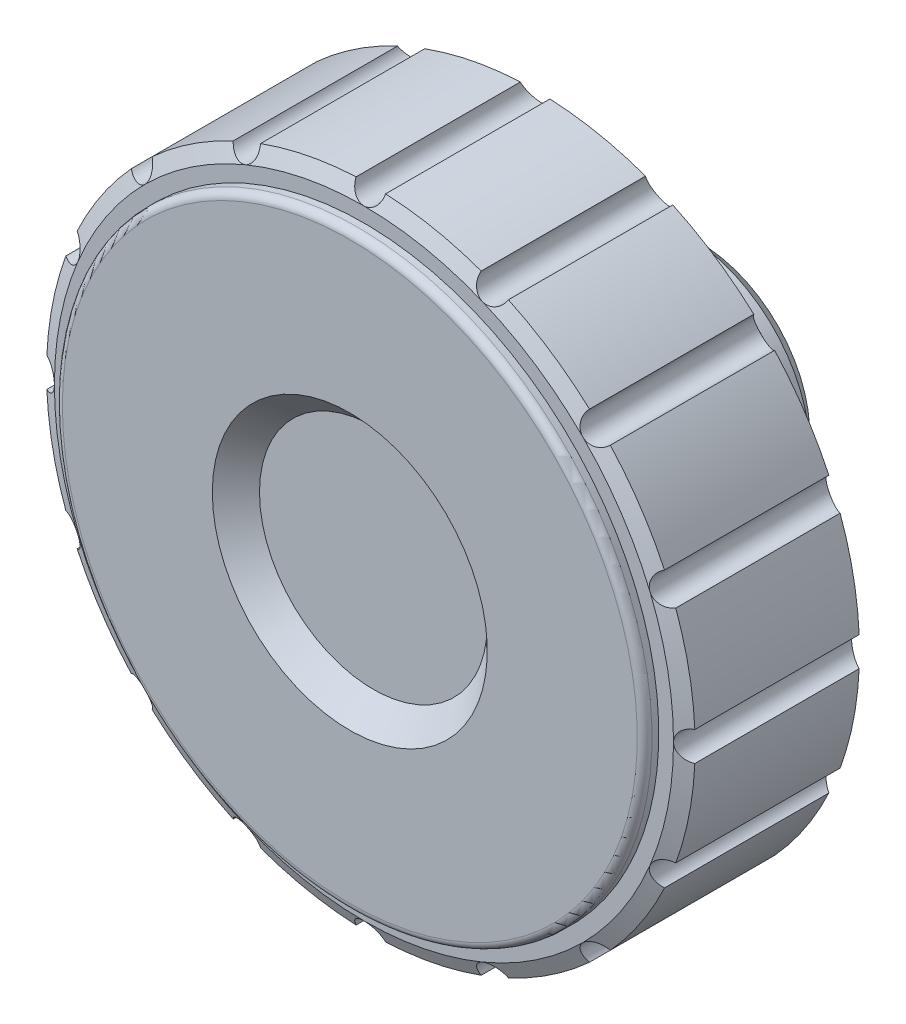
ISO-10303-21;
HEADER;
FILE_DESCRIPTION(('STEP AP214'),'2;1');
FILE_NAME('part.step','',(''),(''),'','','');
FILE_SCHEMA(('AUTOMOTIVE_DESIGN { 1 0 10303 214 1 1 1 1 }'));
ENDSEC;
DATA;
#1=APPLICATION_CONTEXT('core data for automotive mechanical design processes');
#2=APPLICATION_PROTOCOL_DEFINITION('international standard','automotive_design',2000,#1);
#3=PRODUCT_CONTEXT('',#1,'mechanical');
#4=PRODUCT('Part','Part','',(#3));
#5=PRODUCT_RELATED_PRODUCT_CATEGORY('part','',(#4));
#6=PRODUCT_DEFINITION_FORMATION('','',#4);
#7=PRODUCT_DEFINITION_CONTEXT('part definition',#1,'design');
#8=PRODUCT_DEFINITION('design','',#6,#7);
#9=PRODUCT_DEFINITION_SHAPE('','',#8);
#10=(LENGTH_UNIT() NAMED_UNIT(*) SI_UNIT(.MILLI.,.METRE.));
#11=(NAMED_UNIT(*) PLANE_ANGLE_UNIT() SI_UNIT($,.RADIAN.));
#12=(NAMED_UNIT(*) SI_UNIT($,.STERADIAN.) SOLID_ANGLE_UNIT());
#13=UNCERTAINTY_MEASURE_WITH_UNIT(LENGTH_MEASURE(1.E-05),#10,'distance_accuracy_value','');
#14=(GEOMETRIC_REPRESENTATION_CONTEXT(3) GLOBAL_UNCERTAINTY_ASSIGNED_CONTEXT((#13)) GLOBAL_UNIT_ASSIGNED_CONTEXT((#10,
#11,#12)) REPRESENTATION_CONTEXT('',''));
#15=CARTESIAN_POINT('',(0.,0.,0.));
#16=DIRECTION('',(0.,0.,1.));
#17=DIRECTION('',(1.,0.,0.));
#18=AXIS2_PLACEMENT_3D('',#15,#16,#17);
#19=CARTESIAN_POINT('',(0.,0.,0.));
#20=DIRECTION('',(0.,0.,-1.));
#21=DIRECTION('',(-1.,0.,0.));
#22=AXIS2_PLACEMENT_3D('',#19,#20,#21);
#23=PLANE('',#22);
#24=CARTESIAN_POINT('',(0.,0.,0.));
#25=DIRECTION('',(0.,0.,-1.));
#26=DIRECTION('',(-1.,0.,0.));
#27=AXIS2_PLACEMENT_3D('',#24,#25,#26);
#28=CIRCLE('',#27,4.);
#29=CARTESIAN_POINT('',(-4.,0.,0.));
#30=VERTEX_POINT('',#29);
#31=EDGE_CURVE('E369',#30,#30,#28,.T.);
#32=ORIENTED_EDGE('',*,*,#31,.T.);
#33=EDGE_LOOP('',(#32));
#34=FACE_BOUND('',#33,.T.);
#35=CARTESIAN_POINT('',(0.,0.,0.));
#36=DIRECTION('',(0.,0.,-1.));
#37=DIRECTION('',(-1.,0.,0.));
#38=AXIS2_PLACEMENT_3D('',#35,#36,#37);
#39=CIRCLE('',#38,3.);
#40=CARTESIAN_POINT('',(-3.,0.,0.));
#41=VERTEX_POINT('',#40);
#42=EDGE_CURVE('E333',#41,#41,#39,.T.);
#43=ORIENTED_EDGE('',*,*,#42,.F.);
#44=EDGE_LOOP('',(#43));
#45=FACE_BOUND('',#44,.T.);
#46=ADVANCED_FACE('F14',(#34,#45),#23,.T.);
#47=CARTESIAN_POINT('',(0.,0.,10.96));
#48=DIRECTION('',(0.,0.,1.));
#49=DIRECTION('',(1.,0.,0.));
#50=AXIS2_PLACEMENT_3D('',#47,#48,#49);
#51=CONICAL_SURFACE('',#50,21.,1.13446401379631);
#52=CARTESIAN_POINT('',(0.,0.,11.4263076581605));
#53=DIRECTION('',(0.,0.,1.));
#54=DIRECTION('',(1.,0.,0.));
#55=AXIS2_PLACEMENT_3D('',#52,#53,#54);
#56=CIRCLE('',#55,22.0000000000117);
#57=CARTESIAN_POINT('',(14.833354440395,16.247202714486,11.4263076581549));
#58=VERTEX_POINT('',#57);
#59=CARTESIAN_POINT('',(9.3339790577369,19.921767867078,11.4263076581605));
#60=VERTEX_POINT('',#59);
#61=EDGE_CURVE('E438',#58,#60,#56,.T.);
#62=ORIENTED_EDGE('',*,*,#61,.F.);
#63=CARTESIAN_POINT('',(16.247402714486,14.8335456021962,11.4264366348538));
#64=CARTESIAN_POINT('',(16.2033896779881,14.7914358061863,11.398044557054));
#65=CARTESIAN_POINT('',(16.1555050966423,14.7533846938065,11.3695868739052));
#66=CARTESIAN_POINT('',(16.0532128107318,14.6863698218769,11.3132933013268));
#67=CARTESIAN_POINT('',(15.9987883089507,14.657430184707,11.2854592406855));
#68=CARTESIAN_POINT('',(15.8848006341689,14.6098067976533,11.2312852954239));
#69=CARTESIAN_POINT('',(15.8252302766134,14.5911376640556,11.2049475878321));
#70=CARTESIAN_POINT('',(15.7026960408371,14.5651390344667,11.1547661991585));
#71=CARTESIAN_POINT('',(15.639735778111,14.5577976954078,11.1309199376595));
#72=CARTESIAN_POINT('',(15.5157836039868,14.5553561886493,11.0879134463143));
#73=CARTESIAN_POINT('',(15.4548693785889,14.5596154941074,11.068569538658));
#74=CARTESIAN_POINT('',(15.333731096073,14.5795174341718,11.0339223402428));
#75=CARTESIAN_POINT('',(15.2735066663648,14.5951535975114,11.0186167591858));
#76=CARTESIAN_POINT('',(15.1621664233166,14.6356102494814,10.9942454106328));
#77=CARTESIAN_POINT('',(15.1107514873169,14.6593183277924,10.9846991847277));
#78=CARTESIAN_POINT('',(15.0122230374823,14.7154368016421,10.9700755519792));
#79=CARTESIAN_POINT('',(14.965106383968,14.7478407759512,10.9649948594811));
#80=CARTESIAN_POINT('',(14.8808692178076,14.8171371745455,10.9598350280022));
#81=CARTESIAN_POINT('',(14.8432324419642,14.8533746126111,10.9593514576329));
#82=CARTESIAN_POINT('',(14.7741351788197,14.9311724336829,10.9623566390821));
#83=CARTESIAN_POINT('',(14.7426735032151,14.9727317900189,10.965844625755));
#84=CARTESIAN_POINT('',(14.6875017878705,15.0587090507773,10.976473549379));
#85=CARTESIAN_POINT('',(14.6636089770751,15.1030224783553,10.9835155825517));
#86=CARTESIAN_POINT('',(14.6229025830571,15.1941749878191,11.0008840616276));
#87=CARTESIAN_POINT('',(14.6060900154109,15.2410144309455,11.0112109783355));
#88=CARTESIAN_POINT('',(14.5791223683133,15.3380152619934,11.0352479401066));
#89=CARTESIAN_POINT('',(14.5692840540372,15.3882329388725,11.049084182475));
#90=CARTESIAN_POINT('',(14.5573491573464,15.4887851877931,11.0793729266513));
#91=CARTESIAN_POINT('',(14.5552544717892,15.5391197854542,11.0958260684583));
#92=CARTESIAN_POINT('',(14.5586504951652,15.6431771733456,11.1323714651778));
#93=CARTESIAN_POINT('',(14.5648229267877,15.6968097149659,11.1526563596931));
#94=CARTESIAN_POINT('',(14.5854442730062,15.8017175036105,11.1950912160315));
#95=CARTESIAN_POINT('',(14.5999002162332,15.8529907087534,11.2172427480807));
#96=CARTESIAN_POINT('',(14.6382676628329,15.9569609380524,11.2650435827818));
#97=CARTESIAN_POINT('',(14.6629647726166,16.0093079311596,11.2908232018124));
#98=CARTESIAN_POINT('',(14.7207120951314,16.1086190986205,11.34316742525));
#99=CARTESIAN_POINT('',(14.7537491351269,16.1555915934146,11.3697307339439));
#100=CARTESIAN_POINT('',(14.8043214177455,16.2158335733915,11.4063769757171));
#101=CARTESIAN_POINT('',(14.8186842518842,16.2318614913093,11.4164124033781));
#102=CARTESIAN_POINT('',(14.8335456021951,16.247402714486,11.4264366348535));
#103=B_SPLINE_CURVE_WITH_KNOTS('',3,(#63,#64,#65,#66,#67,#68,#69,#70,#71,#72,#73,#74,#75,#76,
#77,#78,#79,#80,#81,#82,#83,#84,#85,#86,#87,#88,#89,#90,#91,#92,#93,#94,#95,#96,#97,#98,#99,
#100,#101,#102),.UNSPECIFIED.,.F.,.F.,(4,2,2,2,2,2,2,2,2,2,2,2,2,2,2,2,2,2,2,4),(0.,
0.201422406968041,0.403373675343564,0.605611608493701,0.807637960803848,0.998738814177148,
1.18973105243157,1.36104276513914,1.53222832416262,1.68819769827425,1.84413702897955,
1.99595814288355,2.14780102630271,2.30616203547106,2.46456183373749,2.63686071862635,
2.80930601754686,2.99859361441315,3.18758408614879,3.25877905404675),.UNSPECIFIED.);
#104=CARTESIAN_POINT('',(14.8492424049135,14.8492424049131,10.9599999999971));
#105=VERTEX_POINT('',#104);
#106=EDGE_CURVE('E726',#105,#58,#103,.T.);
#107=ORIENTED_EDGE('',*,*,#106,.F.);
#108=CARTESIAN_POINT('',(0.,0.,10.96));
#109=DIRECTION('',(0.,0.,-1.));
#110=DIRECTION('',(-1.,0.,0.));
#111=AXIS2_PLACEMENT_3D('',#108,#109,#110);
#112=CIRCLE('',#111,21.);
#113=CARTESIAN_POINT('',(8.03635207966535,19.4014701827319,10.9599999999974));
#114=VERTEX_POINT('',#113);
#115=EDGE_CURVE('E2541',#114,#105,#112,.T.);
#116=ORIENTED_EDGE('',*,*,#115,.F.);
#117=CARTESIAN_POINT('',(9.3341790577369,19.9222215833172,11.4265388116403));
#118=CARTESIAN_POINT('',(9.30964258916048,19.8664672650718,11.3981461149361));
#119=CARTESIAN_POINT('',(9.27997543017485,19.8129803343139,11.3696873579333));
#120=CARTESIAN_POINT('',(9.21113560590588,19.7119044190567,11.313390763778));
#121=CARTESIAN_POINT('',(9.17193820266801,19.6643312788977,11.28555475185));
#122=CARTESIAN_POINT('',(9.08486965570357,19.5766923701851,11.231375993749));
#123=CARTESIAN_POINT('',(9.0369862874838,19.5366373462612,11.2050354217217));
#124=CARTESIAN_POINT('',(8.9337430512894,19.4657037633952,11.1548473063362));
#125=CARTESIAN_POINT('',(8.87839105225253,19.4348156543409,11.1309971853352));
#126=CARTESIAN_POINT('',(8.76481700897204,19.3851008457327,11.0879815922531));
#127=CARTESIAN_POINT('',(8.70691181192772,19.3657124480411,11.068632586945));
#128=CARTESIAN_POINT('',(8.58738031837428,19.3377165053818,11.0339746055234));
#129=CARTESIAN_POINT('',(8.52575615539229,19.3291028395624,11.0186633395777));
#130=CARTESIAN_POINT('',(8.4074052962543,19.3238482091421,10.9942807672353));
#131=CARTESIAN_POINT('',(8.35082820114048,19.3260650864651,10.984729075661));
#132=CARTESIAN_POINT('',(8.2383156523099,19.3401859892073,10.9700946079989));
#133=CARTESIAN_POINT('',(8.1823797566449,19.3520828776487,10.9650085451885));
#134=CARTESIAN_POINT('',(8.07802564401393,19.3838508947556,10.9598389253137));
#135=CARTESIAN_POINT('',(8.02938120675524,19.4029189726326,10.9593507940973));
#136=CARTESIAN_POINT('',(7.93576018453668,19.4483378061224,10.9623472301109));
#137=CARTESIAN_POINT('',(7.89078289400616,19.4746871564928,10.9658310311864));
#138=CARTESIAN_POINT('',(7.80689701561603,19.5329937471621,10.9764520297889));
#139=CARTESIAN_POINT('',(7.76785937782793,19.56478422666,10.9834901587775));
#140=CARTESIAN_POINT('',(7.69535702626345,19.6334088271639,11.0008512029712));
#141=CARTESIAN_POINT('',(7.66189311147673,19.6702436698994,11.0111745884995));
#142=CARTESIAN_POINT('',(7.59984488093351,19.749529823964,11.0352044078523));
#143=CARTESIAN_POINT('',(7.57153143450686,19.7921542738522,11.0490369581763));
#144=CARTESIAN_POINT('',(7.52201140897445,19.8804748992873,11.0793187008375));
#145=CARTESIAN_POINT('',(7.50080657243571,19.9261718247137,11.0957685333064));
#146=CARTESIAN_POINT('',(7.46410726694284,20.0235987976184,11.1323071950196));
#147=CARTESIAN_POINT('',(7.449276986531,20.075506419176,11.1525886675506));
#148=CARTESIAN_POINT('',(7.42816422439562,20.1803123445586,11.1950171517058));
#149=CARTESIAN_POINT('',(7.42188901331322,20.23321145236,11.2171657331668));
#150=CARTESIAN_POINT('',(7.41752793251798,20.343944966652,11.2649610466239));
#151=CARTESIAN_POINT('',(7.42030180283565,20.4017567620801,11.2907381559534));
#152=CARTESIAN_POINT('',(7.43562621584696,20.5156056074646,11.3430780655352));
#153=CARTESIAN_POINT('',(7.44816142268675,20.5716452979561,11.3696395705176));
#154=CARTESIAN_POINT('',(7.47182855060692,20.6467005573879,11.4063055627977));
#155=CARTESIAN_POINT('',(7.47897691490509,20.6670487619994,11.4163622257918));
#156=CARTESIAN_POINT('',(7.48677485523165,20.687137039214,11.4264076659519));
#157=B_SPLINE_CURVE_WITH_KNOTS('',3,(#117,#118,#119,#120,#121,#122,#123,#124,#125,#126,#127,
#128,#129,#130,#131,#132,#133,#134,#135,#136,#137,#138,#139,#140,#141,#142,#143,#144,#145,#146,
#147,#148,#149,#150,#151,#152,#153,#154,#155,#156),.UNSPECIFIED.,.F.,.F.,(4,2,2,2,2,2,2,2,2,2,2,
2,2,2,2,2,2,2,2,4),(0.,0.20142757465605,0.403383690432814,0.605626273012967,0.807657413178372,
0.99876840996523,1.18977079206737,1.36109333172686,1.53228967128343,1.68826466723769,
1.84420958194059,1.99602979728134,2.14787175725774,2.30622670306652,2.46462043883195,
2.6369102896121,2.80934647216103,2.99862495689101,3.1876066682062,3.25895217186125),.UNSPECIFIED.);
#158=EDGE_CURVE('E698',#60,#114,#157,.T.);
#159=ORIENTED_EDGE('',*,*,#158,.F.);
#160=EDGE_LOOP('',(#62,#107,#116,#159));
#161=FACE_BOUND('',#160,.T.);
#162=ADVANCED_FACE('F1075',(#161),#51,.T.);
#163=CARTESIAN_POINT('',(7.4866972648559,20.686937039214,11.426307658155));
#164=VERTEX_POINT('',#163);
#165=EDGE_CURVE('E701',#114,#164,#157,.T.);
#166=ORIENTED_EDGE('',*,*,#165,.F.);
#167=CARTESIAN_POINT('',(6.40111010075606E-13,20.9999999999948,10.9599999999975));
#168=VERTEX_POINT('',#167);
#169=EDGE_CURVE('E2538',#168,#114,#112,.T.);
#170=ORIENTED_EDGE('',*,*,#169,.F.);
#171=CARTESIAN_POINT('',(0.999746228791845,21.977472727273,11.4264009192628));
#172=CARTESIAN_POINT('',(0.998395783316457,21.9165753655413,11.3980090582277));
#173=CARTESIAN_POINT('',(0.991437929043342,21.8558106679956,11.3695517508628));
#174=CARTESIAN_POINT('',(0.966484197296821,21.7360950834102,11.3132592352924));
#175=CARTESIAN_POINT('',(0.948459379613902,21.6771493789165,11.2854258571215));
#176=CARTESIAN_POINT('',(0.90152444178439,21.5628770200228,11.231253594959));
#177=CARTESIAN_POINT('',(0.872598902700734,21.5075556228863,11.204916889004));
#178=CARTESIAN_POINT('',(0.804330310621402,21.4025322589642,11.1547378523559));
#179=CARTESIAN_POINT('',(0.764998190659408,21.3528244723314,11.1308929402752));
#180=CARTESIAN_POINT('',(0.679071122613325,21.2634574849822,11.0878896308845));
#181=CARTESIAN_POINT('',(0.632984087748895,21.2234001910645,11.0685475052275));
#182=CARTESIAN_POINT('',(0.533249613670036,21.1518232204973,11.0339040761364));
#183=CARTESIAN_POINT('',(0.479606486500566,21.1202987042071,11.0186004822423));
#184=CARTESIAN_POINT('',(0.372267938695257,21.0701845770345,10.9942330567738));
#185=CARTESIAN_POINT('',(0.319147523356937,21.0505968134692,10.9846887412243));
#186=CARTESIAN_POINT('',(0.209795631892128,21.0206162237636,10.9700688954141));
#187=CARTESIAN_POINT('',(0.153566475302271,21.0102166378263,10.9649900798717));
#188=CARTESIAN_POINT('',(0.0450029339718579,20.9996589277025,10.9598336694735));
#189=CARTESIAN_POINT('',(-0.00723343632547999,20.9986727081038,10.9593516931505));
#190=CARTESIAN_POINT('',(-0.111102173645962,21.0048311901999,10.9623599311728));
#191=CARTESIAN_POINT('',(-0.162734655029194,21.0119743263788,10.9658493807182));
#192=CARTESIAN_POINT('',(-0.262539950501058,21.0337628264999,10.9764810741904));
#193=CARTESIAN_POINT('',(-0.310768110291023,21.0482051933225,10.9835244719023));
#194=CARTESIAN_POINT('',(-0.404004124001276,21.083881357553,11.0008955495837));
#195=CARTESIAN_POINT('',(-0.4490115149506,21.1051161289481,11.0112237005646));
#196=CARTESIAN_POINT('',(-0.536667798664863,21.1546422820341,11.0352631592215));
#197=CARTESIAN_POINT('',(-0.579132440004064,21.1831975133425,11.0491006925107));
#198=CARTESIAN_POINT('',(-0.658669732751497,21.2458646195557,11.0793918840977));
#199=CARTESIAN_POINT('',(-0.695741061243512,21.2799778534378,11.0958461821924));
#200=CARTESIAN_POINT('',(-0.766915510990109,21.3559639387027,11.1323939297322));
#201=CARTESIAN_POINT('',(-0.800472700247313,21.3982550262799,11.1526800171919));
#202=CARTESIAN_POINT('',(-0.860067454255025,21.4870224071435,11.1951171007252));
#203=CARTESIAN_POINT('',(-0.886098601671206,21.533502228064,11.2172696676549));
#204=CARTESIAN_POINT('',(-0.93248090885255,21.6341545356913,11.2650724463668));
#205=CARTESIAN_POINT('',(-0.952029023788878,21.6886349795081,11.2908529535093));
#206=CARTESIAN_POINT('',(-0.981412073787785,21.7996956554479,11.3431986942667));
#207=CARTESIAN_POINT('',(-0.991262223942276,21.8562724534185,11.3697626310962));
#208=CARTESIAN_POINT('',(-0.998090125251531,21.9345827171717,11.4063866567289));
#209=CARTESIAN_POINT('',(-0.999264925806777,21.9560235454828,11.4163993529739));
#210=CARTESIAN_POINT('',(-0.999746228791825,21.977472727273,11.4264009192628));
#211=B_SPLINE_CURVE_WITH_KNOTS('',3,(#171,#172,#173,#174,#175,#176,#177,#178,#179,#180,#181,
#182,#183,#184,#185,#186,#187,#188,#189,#190,#191,#192,#193,#194,#195,#196,#197,#198,#199,#200,
#201,#202,#203,#204,#205,#206,#207,#208,#209,#210),.UNSPECIFIED.,.F.,.F.,(4,2,2,2,2,2,2,2,2,2,2,
2,2,2,2,2,2,2,2,4),(0.,0.201420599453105,0.403370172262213,0.60560647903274,0.807631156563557,
0.998728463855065,1.18971715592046,1.36102508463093,1.53220687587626,1.68817428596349,
1.84411166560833,1.99593309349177,2.14777630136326,2.30613943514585,2.46454134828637,
2.63684336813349,2.80929187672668,2.99858276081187,3.18757619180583,3.25861009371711),.UNSPECIFIED.);
#212=CARTESIAN_POINT('',(0.999741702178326,21.977272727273,11.4263076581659));
#213=VERTEX_POINT('',#212);
#214=EDGE_CURVE('E691',#213,#168,#211,.T.);
#215=ORIENTED_EDGE('',*,*,#214,.F.);
#216=CARTESIAN_POINT('',(0.,0.,11.4263076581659));
#217=DIRECTION('',(0.,0.,1.));
#218=DIRECTION('',(1.,0.,0.));
#219=AXIS2_PLACEMENT_3D('',#216,#217,#218);
#220=CIRCLE('',#219,22.0000000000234);
#221=EDGE_CURVE('E436',#164,#213,#220,.T.);
#222=ORIENTED_EDGE('',*,*,#221,.F.);
#223=EDGE_LOOP('',(#166,#170,#215,#222));
#224=FACE_BOUND('',#223,.T.);
#225=ADVANCED_FACE('F1081',(#224),#51,.T.);
#226=CARTESIAN_POINT('',(16.247202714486,14.833354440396,11.4263076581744));
#227=VERTEX_POINT('',#226);
#228=EDGE_CURVE('E731',#227,#105,#103,.T.);
#229=ORIENTED_EDGE('',*,*,#228,.F.);
#230=CARTESIAN_POINT('',(0.,0.,11.4263076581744));
#231=DIRECTION('',(0.,0.,1.));
#232=DIRECTION('',(1.,0.,0.));
#233=AXIS2_PLACEMENT_3D('',#230,#231,#232);
#234=CIRCLE('',#233,22.0000000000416);
#235=CARTESIAN_POINT('',(19.921767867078,9.3339790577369,11.4263076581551));
#236=VERTEX_POINT('',#235);
#237=EDGE_CURVE('E440',#236,#227,#234,.T.);
#238=ORIENTED_EDGE('',*,*,#237,.F.);
#239=CARTESIAN_POINT('',(20.687137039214,7.48677485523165,11.4264076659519));
#240=CARTESIAN_POINT('',(20.6303586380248,7.46471723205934,11.3980157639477));
#241=CARTESIAN_POINT('',(20.5715568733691,7.44789094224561,11.3695583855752));
#242=CARTESIAN_POINT('',(20.4514048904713,7.42513027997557,11.3132656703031));
#243=CARTESIAN_POINT('',(20.3900483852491,7.4192246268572,11.2854321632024));
#244=CARTESIAN_POINT('',(20.2665131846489,7.41885498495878,11.2312595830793));
#245=CARTESIAN_POINT('',(20.2043334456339,7.42440725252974,11.2049226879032));
#246=CARTESIAN_POINT('',(20.0811788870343,7.44728679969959,11.1547432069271));
#247=CARTESIAN_POINT('',(20.0202028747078,7.46460175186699,11.1308980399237));
#248=CARTESIAN_POINT('',(19.9047549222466,7.50978719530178,11.0878941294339));
#249=CARTESIAN_POINT('',(19.8501095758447,7.53703611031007,11.0685516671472));
#250=CARTESIAN_POINT('',(19.7458132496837,7.60178616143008,11.0339075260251));
#251=CARTESIAN_POINT('',(19.696159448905,7.63928146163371,11.0186035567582));
#252=CARTESIAN_POINT('',(19.608782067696,7.71927057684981,10.9942353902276));
#253=CARTESIAN_POINT('',(19.5703563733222,7.76085116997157,10.9846907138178));
#254=CARTESIAN_POINT('',(19.500809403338,7.85040550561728,10.9700701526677));
#255=CARTESIAN_POINT('',(19.4696827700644,7.89837451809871,10.9649909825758));
#256=CARTESIAN_POINT('',(19.4183819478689,7.99463357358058,10.9598339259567));
#257=CARTESIAN_POINT('',(19.3974801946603,8.04251614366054,10.9593516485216));
#258=CARTESIAN_POINT('',(19.3634198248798,8.14083495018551,10.9623593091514));
#259=CARTESIAN_POINT('',(19.3502597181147,8.19127069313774,10.9658484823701));
#260=CARTESIAN_POINT('',(19.3321946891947,8.29181681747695,10.9764796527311));
#261=CARTESIAN_POINT('',(19.3270810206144,8.3419006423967,10.9835227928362));
#262=CARTESIAN_POINT('',(19.3243605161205,8.44169217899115,11.0008933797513));
#263=CARTESIAN_POINT('',(19.326754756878,8.49139983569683,11.0112212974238));
#264=CARTESIAN_POINT('',(19.338965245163,8.59133660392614,11.0352602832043));
#265=CARTESIAN_POINT('',(19.3490957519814,8.64149646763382,11.0490975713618));
#266=CARTESIAN_POINT('',(19.3765538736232,8.73896118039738,11.0793883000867));
#267=CARTESIAN_POINT('',(19.3938832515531,8.78626532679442,11.0958423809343));
#268=CARTESIAN_POINT('',(19.4368468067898,8.88110089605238,11.1323896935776));
#269=CARTESIAN_POINT('',(19.4630763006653,8.92828800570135,11.1526755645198));
#270=CARTESIAN_POINT('',(19.5222795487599,9.01731665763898,11.1951122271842));
#271=CARTESIAN_POINT('',(19.5552590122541,9.0591536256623,11.2172645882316));
#272=CARTESIAN_POINT('',(19.6304986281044,9.14052389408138,11.2650669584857));
#273=CARTESIAN_POINT('',(19.673350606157,9.17943314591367,11.2908472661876));
#274=CARTESIAN_POINT('',(19.7647116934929,9.24908159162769,11.3431926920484));
#275=CARTESIAN_POINT('',(19.8132118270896,9.27983350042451,11.3697565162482));
#276=CARTESIAN_POINT('',(19.8830391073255,9.31615818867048,11.4064285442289));
#277=CARTESIAN_POINT('',(19.9024925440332,9.32549047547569,11.4164893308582));
#278=CARTESIAN_POINT('',(19.9222215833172,9.3341790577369,11.4265388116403));
#279=B_SPLINE_CURVE_WITH_KNOTS('',3,(#239,#240,#241,#242,#243,#244,#245,#246,#247,#248,#249,
#250,#251,#252,#253,#254,#255,#256,#257,#258,#259,#260,#261,#262,#263,#264,#265,#266,#267,#268,
#269,#270,#271,#272,#273,#274,#275,#276,#277,#278),.UNSPECIFIED.,.F.,.F.,(4,2,2,2,2,2,2,2,2,2,2,
2,2,2,2,2,2,2,2,4),(0.,0.201420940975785,0.403370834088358,0.605607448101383,0.807632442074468,
0.998730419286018,1.18971978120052,1.36102842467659,1.53221092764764,1.68817870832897,
1.84411645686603,1.9959378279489,2.14778097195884,2.30614369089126,2.46454521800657,
2.63684671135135,2.80929454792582,2.99858451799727,3.18757768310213,3.25895226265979),.UNSPECIFIED.);
#280=CARTESIAN_POINT('',(19.4014701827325,8.03635207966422,10.9599999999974));
#281=VERTEX_POINT('',#280);
#282=EDGE_CURVE('E741',#281,#236,#279,.T.);
#283=ORIENTED_EDGE('',*,*,#282,.F.);
#284=EDGE_CURVE('E2545',#105,#281,#112,.T.);
#285=ORIENTED_EDGE('',*,*,#284,.F.);
#286=EDGE_LOOP('',(#229,#238,#283,#285));
#287=FACE_BOUND('',#286,.T.);
#288=ADVANCED_FACE('F1588',(#287),#51,.T.);
#289=CARTESIAN_POINT('',(20.686937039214,7.4866972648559,11.4263076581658));
#290=VERTEX_POINT('',#289);
#291=EDGE_CURVE('E738',#290,#281,#279,.T.);
#292=ORIENTED_EDGE('',*,*,#291,.F.);
#293=CARTESIAN_POINT('',(0.,0.,11.4263076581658));
#294=DIRECTION('',(0.,0.,1.));
#295=DIRECTION('',(1.,0.,0.));
#296=AXIS2_PLACEMENT_3D('',#293,#294,#295);
#297=CIRCLE('',#296,22.0000000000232);
#298=CARTESIAN_POINT('',(21.977272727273,0.99974170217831,11.4263076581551));
#299=VERTEX_POINT('',#298);
#300=EDGE_CURVE('E442',#299,#290,#297,.T.);
#301=ORIENTED_EDGE('',*,*,#300,.F.);
#302=CARTESIAN_POINT('',(21.977472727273,-0.999746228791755,11.4264009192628));
#303=CARTESIAN_POINT('',(21.9165753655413,-0.998395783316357,11.3980090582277));
#304=CARTESIAN_POINT('',(21.8558106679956,-0.991437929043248,11.3695517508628));
#305=CARTESIAN_POINT('',(21.7360950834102,-0.966484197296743,11.3132592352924));
#306=CARTESIAN_POINT('',(21.6771493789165,-0.948459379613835,11.2854258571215));
#307=CARTESIAN_POINT('',(21.5628770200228,-0.901524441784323,11.231253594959));
#308=CARTESIAN_POINT('',(21.5075556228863,-0.872598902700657,11.204916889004));
#309=CARTESIAN_POINT('',(21.4025322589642,-0.804330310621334,11.1547378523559));
#310=CARTESIAN_POINT('',(21.3528244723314,-0.764998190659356,11.1308929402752));
#311=CARTESIAN_POINT('',(21.2634574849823,-0.67907112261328,11.0878896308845));
#312=CARTESIAN_POINT('',(21.2234001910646,-0.632984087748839,11.0685475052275));
#313=CARTESIAN_POINT('',(21.1518232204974,-0.533249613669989,11.0339040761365));
#314=CARTESIAN_POINT('',(21.1202987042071,-0.47960648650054,11.0186004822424));
#315=CARTESIAN_POINT('',(21.0701845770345,-0.372267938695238,10.9942330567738));
#316=CARTESIAN_POINT('',(21.0505968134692,-0.319147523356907,10.9846887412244));
#317=CARTESIAN_POINT('',(21.0206162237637,-0.2097956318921,10.9700688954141));
#318=CARTESIAN_POINT('',(21.0102166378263,-0.153566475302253,10.9649900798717));
#319=CARTESIAN_POINT('',(20.9996589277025,-0.0450029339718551,10.9598336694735));
#320=CARTESIAN_POINT('',(20.9986727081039,0.00723343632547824,10.9593516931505));
#321=CARTESIAN_POINT('',(21.0048311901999,0.111102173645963,10.9623599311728));
#322=CARTESIAN_POINT('',(21.0119743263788,0.162734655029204,10.9658493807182));
#323=CARTESIAN_POINT('',(21.0337628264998,0.262539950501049,10.9764810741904));
#324=CARTESIAN_POINT('',(21.0482051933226,0.310768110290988,10.9835244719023));
#325=CARTESIAN_POINT('',(21.083881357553,0.404004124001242,11.0008955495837));
#326=CARTESIAN_POINT('',(21.105116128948,0.449011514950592,11.0112237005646));
#327=CARTESIAN_POINT('',(21.1546422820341,0.536667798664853,11.0352631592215));
#328=CARTESIAN_POINT('',(21.1831975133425,0.579132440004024,11.0491006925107));
#329=CARTESIAN_POINT('',(21.2458646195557,0.658669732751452,11.0793918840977));
#330=CARTESIAN_POINT('',(21.2799778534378,0.695741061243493,11.0958461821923));
#331=CARTESIAN_POINT('',(21.3559639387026,0.766915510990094,11.1323939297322));
#332=CARTESIAN_POINT('',(21.3982550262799,0.800472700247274,11.1526800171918));
#333=CARTESIAN_POINT('',(21.4870224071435,0.860067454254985,11.1951171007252));
#334=CARTESIAN_POINT('',(21.5335022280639,0.886098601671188,11.2172696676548));
#335=CARTESIAN_POINT('',(21.6341545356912,0.932480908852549,11.2650724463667));
#336=CARTESIAN_POINT('',(21.688634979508,0.952029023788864,11.2908529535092));
#337=CARTESIAN_POINT('',(21.7996956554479,0.981412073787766,11.3431986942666));
#338=CARTESIAN_POINT('',(21.8562724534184,0.991262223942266,11.3697626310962));
#339=CARTESIAN_POINT('',(21.9345827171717,0.998090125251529,11.4063866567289));
#340=CARTESIAN_POINT('',(21.9560235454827,0.999264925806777,11.4163993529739));
#341=CARTESIAN_POINT('',(21.977472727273,0.999746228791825,11.4264009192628));
#342=B_SPLINE_CURVE_WITH_KNOTS('',3,(#302,#303,#304,#305,#306,#307,#308,#309,#310,#311,#312,
#313,#314,#315,#316,#317,#318,#319,#320,#321,#322,#323,#324,#325,#326,#327,#328,#329,#330,#331,
#332,#333,#334,#335,#336,#337,#338,#339,#340,#341),.UNSPECIFIED.,.F.,.F.,(4,2,2,2,2,2,2,2,2,2,2,
2,2,2,2,2,2,2,2,4),(0.,0.201420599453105,0.403370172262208,0.605606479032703,0.807631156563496,
0.998728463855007,1.1897171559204,1.36102508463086,1.53220687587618,1.6881742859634,
1.84411166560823,1.99593309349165,2.14777630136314,2.30613943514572,2.46454134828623,
2.63684336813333,2.8092918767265,2.99858276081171,3.18757619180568,3.25861009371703),.UNSPECIFIED.);
#343=CARTESIAN_POINT('',(20.9999999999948,-5.97058321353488E-13,10.9599999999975));
#344=VERTEX_POINT('',#343);
#345=EDGE_CURVE('E766',#344,#299,#342,.T.);
#346=ORIENTED_EDGE('',*,*,#345,.F.);
#347=EDGE_CURVE('E2546',#281,#344,#112,.T.);
#348=ORIENTED_EDGE('',*,*,#347,.F.);
#349=EDGE_LOOP('',(#292,#301,#346,#348));
#350=FACE_BOUND('',#349,.T.);
#351=ADVANCED_FACE('F1579',(#350),#51,.T.);
#352=CARTESIAN_POINT('',(-0.99974170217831,21.977272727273,11.4263076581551));
#353=VERTEX_POINT('',#352);
#354=EDGE_CURVE('E686',#168,#353,#211,.T.);
#355=ORIENTED_EDGE('',*,*,#354,.F.);
#356=CARTESIAN_POINT('',(-8.03635207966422,19.4014701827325,10.9599999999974));
#357=VERTEX_POINT('',#356);
#358=EDGE_CURVE('E1149',#357,#168,#112,.T.);
#359=ORIENTED_EDGE('',*,*,#358,.F.);
#360=CARTESIAN_POINT('',(-7.48677485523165,20.687137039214,11.4264076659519));
#361=CARTESIAN_POINT('',(-7.46471723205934,20.6303586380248,11.3980157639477));
#362=CARTESIAN_POINT('',(-7.4478909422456,20.5715568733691,11.3695583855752));
#363=CARTESIAN_POINT('',(-7.42513027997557,20.4514048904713,11.3132656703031));
#364=CARTESIAN_POINT('',(-7.4192246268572,20.3900483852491,11.2854321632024));
#365=CARTESIAN_POINT('',(-7.41885498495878,20.2665131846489,11.2312595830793));
#366=CARTESIAN_POINT('',(-7.42440725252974,20.2043334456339,11.2049226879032));
#367=CARTESIAN_POINT('',(-7.44728679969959,20.0811788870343,11.1547432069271));
#368=CARTESIAN_POINT('',(-7.46460175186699,20.0202028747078,11.1308980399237));
#369=CARTESIAN_POINT('',(-7.50978719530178,19.9047549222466,11.0878941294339));
#370=CARTESIAN_POINT('',(-7.53703611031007,19.8501095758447,11.0685516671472));
#371=CARTESIAN_POINT('',(-7.60178616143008,19.7458132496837,11.0339075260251));
#372=CARTESIAN_POINT('',(-7.63928146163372,19.696159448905,11.0186035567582));
#373=CARTESIAN_POINT('',(-7.71927057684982,19.608782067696,10.9942353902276));
#374=CARTESIAN_POINT('',(-7.76085116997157,19.5703563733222,10.9846907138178));
#375=CARTESIAN_POINT('',(-7.85040550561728,19.500809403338,10.9700701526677));
#376=CARTESIAN_POINT('',(-7.89837451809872,19.4696827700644,10.9649909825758));
#377=CARTESIAN_POINT('',(-7.99463357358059,19.4183819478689,10.9598339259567));
#378=CARTESIAN_POINT('',(-8.04251614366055,19.3974801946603,10.9593516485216));
#379=CARTESIAN_POINT('',(-8.14083495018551,19.3634198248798,10.9623593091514));
#380=CARTESIAN_POINT('',(-8.19127069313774,19.3502597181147,10.9658484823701));
#381=CARTESIAN_POINT('',(-8.29181681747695,19.3321946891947,10.9764796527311));
#382=CARTESIAN_POINT('',(-8.3419006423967,19.3270810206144,10.9835227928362));
#383=CARTESIAN_POINT('',(-8.44169217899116,19.3243605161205,11.0008933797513));
#384=CARTESIAN_POINT('',(-8.49139983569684,19.326754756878,11.0112212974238));
#385=CARTESIAN_POINT('',(-8.59133660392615,19.338965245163,11.0352602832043));
#386=CARTESIAN_POINT('',(-8.64149646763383,19.3490957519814,11.0490975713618));
#387=CARTESIAN_POINT('',(-8.73896118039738,19.3765538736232,11.0793883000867));
#388=CARTESIAN_POINT('',(-8.78626532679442,19.3938832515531,11.0958423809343));
#389=CARTESIAN_POINT('',(-8.88110089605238,19.4368468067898,11.1323896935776));
#390=CARTESIAN_POINT('',(-8.92828800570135,19.4630763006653,11.1526755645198));
#391=CARTESIAN_POINT('',(-9.01731665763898,19.5222795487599,11.1951122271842));
#392=CARTESIAN_POINT('',(-9.0591536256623,19.5552590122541,11.2172645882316));
#393=CARTESIAN_POINT('',(-9.14052389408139,19.6304986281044,11.2650669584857));
#394=CARTESIAN_POINT('',(-9.17943314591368,19.673350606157,11.2908472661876));
#395=CARTESIAN_POINT('',(-9.2490815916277,19.7647116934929,11.3431926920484));
#396=CARTESIAN_POINT('',(-9.27983350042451,19.8132118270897,11.3697565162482));
#397=CARTESIAN_POINT('',(-9.31615818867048,19.8830391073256,11.4064285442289));
#398=CARTESIAN_POINT('',(-9.32549047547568,19.9024925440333,11.4164893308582));
#399=CARTESIAN_POINT('',(-9.3341790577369,19.9222215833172,11.4265388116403));
#400=B_SPLINE_CURVE_WITH_KNOTS('',3,(#360,#361,#362,#363,#364,#365,#366,#367,#368,#369,#370,
#371,#372,#373,#374,#375,#376,#377,#378,#379,#380,#381,#382,#383,#384,#385,#386,#387,#388,#389,
#390,#391,#392,#393,#394,#395,#396,#397,#398,#399),.UNSPECIFIED.,.F.,.F.,(4,2,2,2,2,2,2,2,2,2,2,
2,2,2,2,2,2,2,2,4),(0.,0.201420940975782,0.403370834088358,0.605607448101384,0.807632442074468,
0.998730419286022,1.18971978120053,1.3610284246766,1.53221092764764,1.68817870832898,
1.84411645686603,1.9959378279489,2.14778097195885,2.30614369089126,2.46454521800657,
2.63684671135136,2.80929454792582,2.99858451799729,3.18757768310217,3.25895226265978),.UNSPECIFIED.);
#401=CARTESIAN_POINT('',(-7.4866972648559,20.686937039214,11.4263076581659));
#402=VERTEX_POINT('',#401);
#403=EDGE_CURVE('E650',#402,#357,#400,.T.);
#404=ORIENTED_EDGE('',*,*,#403,.F.);
#405=CARTESIAN_POINT('',(0.,0.,11.4263076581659));
#406=DIRECTION('',(0.,0.,1.));
#407=DIRECTION('',(1.,0.,0.));
#408=AXIS2_PLACEMENT_3D('',#405,#406,#407);
#409=CIRCLE('',#408,22.0000000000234);
#410=EDGE_CURVE('E434',#353,#402,#409,.T.);
#411=ORIENTED_EDGE('',*,*,#410,.F.);
#412=EDGE_LOOP('',(#355,#359,#404,#411));
#413=FACE_BOUND('',#412,.T.);
#414=ADVANCED_FACE('F1145',(#413),#51,.T.);
#415=CARTESIAN_POINT('',(21.977272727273,-0.999741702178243,11.4263076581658));
#416=VERTEX_POINT('',#415);
#417=EDGE_CURVE('E771',#416,#344,#342,.T.);
#418=ORIENTED_EDGE('',*,*,#417,.F.);
#419=CARTESIAN_POINT('',(0.,0.,11.4263076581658));
#420=DIRECTION('',(0.,0.,1.));
#421=DIRECTION('',(1.,0.,0.));
#422=AXIS2_PLACEMENT_3D('',#419,#420,#421);
#423=CIRCLE('',#422,22.0000000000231);
#424=CARTESIAN_POINT('',(20.686937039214,-7.4866972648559,11.426307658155));
#425=VERTEX_POINT('',#424);
#426=EDGE_CURVE('E444',#425,#416,#423,.T.);
#427=ORIENTED_EDGE('',*,*,#426,.F.);
#428=CARTESIAN_POINT('',(19.9222215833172,-9.334179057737,11.4265388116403));
#429=CARTESIAN_POINT('',(19.8664672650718,-9.30964258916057,11.3981461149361));
#430=CARTESIAN_POINT('',(19.8129803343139,-9.27997543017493,11.3696873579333));
#431=CARTESIAN_POINT('',(19.7119044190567,-9.21113560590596,11.313390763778));
#432=CARTESIAN_POINT('',(19.6643312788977,-9.17193820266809,11.28555475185));
#433=CARTESIAN_POINT('',(19.5766923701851,-9.08486965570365,11.231375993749));
#434=CARTESIAN_POINT('',(19.5366373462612,-9.03698628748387,11.2050354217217));
#435=CARTESIAN_POINT('',(19.4657037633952,-8.93374305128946,11.1548473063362));
#436=CARTESIAN_POINT('',(19.4348156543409,-8.87839105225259,11.1309971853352));
#437=CARTESIAN_POINT('',(19.3851008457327,-8.7648170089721,11.0879815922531));
#438=CARTESIAN_POINT('',(19.3657124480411,-8.70691181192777,11.068632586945));
#439=CARTESIAN_POINT('',(19.3377165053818,-8.58738031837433,11.0339746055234));
#440=CARTESIAN_POINT('',(19.3291028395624,-8.52575615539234,11.0186633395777));
#441=CARTESIAN_POINT('',(19.323848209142,-8.40740529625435,10.9942807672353));
#442=CARTESIAN_POINT('',(19.3260650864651,-8.35082820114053,10.9847290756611));
#443=CARTESIAN_POINT('',(19.3401859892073,-8.23831565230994,10.9700946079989));
#444=CARTESIAN_POINT('',(19.3520828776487,-8.18237975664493,10.9650085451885));
#445=CARTESIAN_POINT('',(19.3838508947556,-8.07802564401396,10.9598389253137));
#446=CARTESIAN_POINT('',(19.4029189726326,-8.02938120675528,10.9593507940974));
#447=CARTESIAN_POINT('',(19.4483378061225,-7.93576018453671,10.9623472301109));
#448=CARTESIAN_POINT('',(19.4746871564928,-7.89078289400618,10.9658310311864));
#449=CARTESIAN_POINT('',(19.5329937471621,-7.80689701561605,10.9764520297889));
#450=CARTESIAN_POINT('',(19.56478422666,-7.76785937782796,10.9834901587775));
#451=CARTESIAN_POINT('',(19.6334088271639,-7.69535702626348,11.0008512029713));
#452=CARTESIAN_POINT('',(19.6702436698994,-7.66189311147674,11.0111745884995));
#453=CARTESIAN_POINT('',(19.749529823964,-7.59984488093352,11.0352044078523));
#454=CARTESIAN_POINT('',(19.7921542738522,-7.57153143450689,11.0490369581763));
#455=CARTESIAN_POINT('',(19.8804748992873,-7.52201140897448,11.0793187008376));
#456=CARTESIAN_POINT('',(19.9261718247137,-7.50080657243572,11.0957685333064));
#457=CARTESIAN_POINT('',(20.0235987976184,-7.46410726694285,11.1323071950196));
#458=CARTESIAN_POINT('',(20.075506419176,-7.44927698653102,11.1525886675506));
#459=CARTESIAN_POINT('',(20.1803123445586,-7.42816422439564,11.1950171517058));
#460=CARTESIAN_POINT('',(20.23321145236,-7.42188901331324,11.2171657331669));
#461=CARTESIAN_POINT('',(20.343944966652,-7.41752793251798,11.2649610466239));
#462=CARTESIAN_POINT('',(20.4017567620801,-7.42030180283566,11.2907381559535));
#463=CARTESIAN_POINT('',(20.5156056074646,-7.43562621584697,11.3430780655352));
#464=CARTESIAN_POINT('',(20.5716452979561,-7.44816142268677,11.3696395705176));
#465=CARTESIAN_POINT('',(20.646700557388,-7.47182855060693,11.4063055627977));
#466=CARTESIAN_POINT('',(20.6670487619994,-7.4789769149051,11.4163622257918));
#467=CARTESIAN_POINT('',(20.687137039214,-7.48677485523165,11.4264076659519));
#468=B_SPLINE_CURVE_WITH_KNOTS('',3,(#428,#429,#430,#431,#432,#433,#434,#435,#436,#437,#438,
#439,#440,#441,#442,#443,#444,#445,#446,#447,#448,#449,#450,#451,#452,#453,#454,#455,#456,#457,
#458,#459,#460,#461,#462,#463,#464,#465,#466,#467),.UNSPECIFIED.,.F.,.F.,(4,2,2,2,2,2,2,2,2,2,2,
2,2,2,2,2,2,2,2,4),(0.,0.201427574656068,0.403383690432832,0.605626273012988,0.807657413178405,
0.998768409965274,1.18977079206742,1.36109333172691,1.5322896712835,1.68826466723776,
1.84420958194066,1.99602979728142,2.14787175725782,2.30622670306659,2.46462043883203,
2.63691028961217,2.80934647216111,2.99862495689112,3.18760666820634,3.25895217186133),.UNSPECIFIED.);
#469=CARTESIAN_POINT('',(19.4014701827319,-8.03635207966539,10.9599999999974));
#470=VERTEX_POINT('',#469);
#471=EDGE_CURVE('E781',#470,#425,#468,.T.);
#472=ORIENTED_EDGE('',*,*,#471,.F.);
#473=EDGE_CURVE('E2548',#344,#470,#112,.T.);
#474=ORIENTED_EDGE('',*,*,#473,.F.);
#475=EDGE_LOOP('',(#418,#427,#472,#474));
#476=FACE_BOUND('',#475,.T.);
#477=ADVANCED_FACE('F1560',(#476),#51,.T.);
#478=CARTESIAN_POINT('',(19.921767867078,-9.333979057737,11.4263076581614));
#479=VERTEX_POINT('',#478);
#480=EDGE_CURVE('E778',#479,#470,#468,.T.);
#481=ORIENTED_EDGE('',*,*,#480,.F.);
#482=CARTESIAN_POINT('',(0.,0.,11.4263076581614));
#483=DIRECTION('',(0.,0.,1.));
#484=DIRECTION('',(1.,0.,0.));
#485=AXIS2_PLACEMENT_3D('',#482,#483,#484);
#486=CIRCLE('',#485,22.0000000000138);
#487=CARTESIAN_POINT('',(16.247202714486,-14.833354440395,11.4263076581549));
#488=VERTEX_POINT('',#487);
#489=EDGE_CURVE('E446',#488,#479,#486,.T.);
#490=ORIENTED_EDGE('',*,*,#489,.F.);
#491=CARTESIAN_POINT('',(14.8335456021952,-16.247402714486,11.4264366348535));
#492=CARTESIAN_POINT('',(14.7914358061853,-16.2033896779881,11.3980445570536));
#493=CARTESIAN_POINT('',(14.7533846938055,-16.1555050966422,11.3695868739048));
#494=CARTESIAN_POINT('',(14.686369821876,-16.0532128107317,11.3132933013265));
#495=CARTESIAN_POINT('',(14.6574301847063,-15.9987883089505,11.2854592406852));
#496=CARTESIAN_POINT('',(14.6098067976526,-15.8848006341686,11.2312852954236));
#497=CARTESIAN_POINT('',(14.591137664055,-15.8252302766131,11.2049475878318));
#498=CARTESIAN_POINT('',(14.5651390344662,-15.7026960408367,11.1547661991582));
#499=CARTESIAN_POINT('',(14.5577976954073,-15.6397357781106,11.1309199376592));
#500=CARTESIAN_POINT('',(14.5553561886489,-15.5157836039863,11.087913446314));
#501=CARTESIAN_POINT('',(14.5596154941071,-15.4548693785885,11.0685695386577));
#502=CARTESIAN_POINT('',(14.5795174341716,-15.3337310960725,11.0339223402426));
#503=CARTESIAN_POINT('',(14.5951535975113,-15.2735066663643,11.0186167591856));
#504=CARTESIAN_POINT('',(14.6356102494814,-15.1621664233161,10.9942454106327));
#505=CARTESIAN_POINT('',(14.6593183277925,-15.1107514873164,10.9846991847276));
#506=CARTESIAN_POINT('',(14.7154368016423,-15.0122230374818,10.9700755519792));
#507=CARTESIAN_POINT('',(14.7478407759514,-14.9651063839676,10.964994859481));
#508=CARTESIAN_POINT('',(14.8171371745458,-14.8808692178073,10.9598350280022));
#509=CARTESIAN_POINT('',(14.8533746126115,-14.8432324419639,10.9593514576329));
#510=CARTESIAN_POINT('',(14.9311724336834,-14.7741351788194,10.9623566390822));
#511=CARTESIAN_POINT('',(14.9727317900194,-14.7426735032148,10.9658446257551));
#512=CARTESIAN_POINT('',(15.0587090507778,-14.6875017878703,10.9764735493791));
#513=CARTESIAN_POINT('',(15.1030224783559,-14.663608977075,10.9835155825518));
#514=CARTESIAN_POINT('',(15.1941749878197,-14.6229025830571,11.0008840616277));
#515=CARTESIAN_POINT('',(15.2410144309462,-14.6060900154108,11.0112109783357));
#516=CARTESIAN_POINT('',(15.3380152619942,-14.5791223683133,11.0352479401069));
#517=CARTESIAN_POINT('',(15.3882329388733,-14.5692840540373,11.0490841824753));
#518=CARTESIAN_POINT('',(15.488785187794,-14.5573491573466,11.0793729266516));
#519=CARTESIAN_POINT('',(15.5391197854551,-14.5552544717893,11.0958260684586));
#520=CARTESIAN_POINT('',(15.6431771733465,-14.5586504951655,11.1323714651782));
#521=CARTESIAN_POINT('',(15.6968097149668,-14.564822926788,11.1526563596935));
#522=CARTESIAN_POINT('',(15.8017175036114,-14.5854442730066,11.195091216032));
#523=CARTESIAN_POINT('',(15.8529907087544,-14.5999002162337,11.2172427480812));
#524=CARTESIAN_POINT('',(15.9569609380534,-14.6382676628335,11.2650435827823));
#525=CARTESIAN_POINT('',(16.0093079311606,-14.6629647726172,11.2908232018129));
#526=CARTESIAN_POINT('',(16.1086190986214,-14.7207120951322,11.3431674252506));
#527=CARTESIAN_POINT('',(16.1555915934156,-14.7537491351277,11.3697307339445));
#528=CARTESIAN_POINT('',(16.2158335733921,-14.8043214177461,11.4063769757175));
#529=CARTESIAN_POINT('',(16.2318614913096,-14.8186842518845,11.4164124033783));
#530=CARTESIAN_POINT('',(16.247402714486,-14.8335456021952,11.4264366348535));
#531=B_SPLINE_CURVE_WITH_KNOTS('',3,(#491,#492,#493,#494,#495,#496,#497,#498,#499,#500,#501,
#502,#503,#504,#505,#506,#507,#508,#509,#510,#511,#512,#513,#514,#515,#516,#517,#518,#519,#520,
#521,#522,#523,#524,#525,#526,#527,#528,#529,#530),.UNSPECIFIED.,.F.,.F.,(4,2,2,2,2,2,2,2,2,2,2,
2,2,2,2,2,2,2,2,4),(0.,0.201422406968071,0.403373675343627,0.605611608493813,0.807637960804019,
0.998738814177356,1.18973105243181,1.3610427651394,1.53222832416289,1.68819769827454,
1.84413702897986,1.99595814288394,2.14780102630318,2.30616203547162,2.46456183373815,
2.63686071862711,2.80930601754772,2.99859361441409,3.18758408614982,3.25877905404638),.UNSPECIFIED.);
#532=CARTESIAN_POINT('',(14.8492424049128,-14.8492424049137,10.9599999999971));
#533=VERTEX_POINT('',#532);
#534=EDGE_CURVE('E806',#533,#488,#531,.T.);
#535=ORIENTED_EDGE('',*,*,#534,.F.);
#536=EDGE_CURVE('E2551',#470,#533,#112,.T.);
#537=ORIENTED_EDGE('',*,*,#536,.F.);
#538=EDGE_LOOP('',(#481,#490,#535,#537));
#539=FACE_BOUND('',#538,.T.);
#540=ADVANCED_FACE('F1550',(#539),#51,.T.);
#541=CARTESIAN_POINT('',(-9.3339790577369,19.921767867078,11.4263076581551));
#542=VERTEX_POINT('',#541);
#543=EDGE_CURVE('E651',#357,#542,#400,.T.);
#544=ORIENTED_EDGE('',*,*,#543,.F.);
#545=CARTESIAN_POINT('',(-14.8492424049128,14.8492424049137,10.9599999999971));
#546=VERTEX_POINT('',#545);
#547=EDGE_CURVE('E1052',#546,#357,#112,.T.);
#548=ORIENTED_EDGE('',*,*,#547,.F.);
#549=CARTESIAN_POINT('',(-14.8335456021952,16.247402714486,11.4264366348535));
#550=CARTESIAN_POINT('',(-14.7914358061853,16.2033896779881,11.3980445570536));
#551=CARTESIAN_POINT('',(-14.7533846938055,16.1555050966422,11.3695868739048));
#552=CARTESIAN_POINT('',(-14.686369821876,16.0532128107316,11.3132933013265));
#553=CARTESIAN_POINT('',(-14.6574301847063,15.9987883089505,11.2854592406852));
#554=CARTESIAN_POINT('',(-14.6098067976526,15.8848006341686,11.2312852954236));
#555=CARTESIAN_POINT('',(-14.5911376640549,15.825230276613,11.2049475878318));
#556=CARTESIAN_POINT('',(-14.5651390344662,15.7026960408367,11.1547661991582));
#557=CARTESIAN_POINT('',(-14.5577976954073,15.6397357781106,11.1309199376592));
#558=CARTESIAN_POINT('',(-14.5553561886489,15.5157836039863,11.087913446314));
#559=CARTESIAN_POINT('',(-14.5596154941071,15.4548693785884,11.0685695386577));
#560=CARTESIAN_POINT('',(-14.5795174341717,15.3337310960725,11.0339223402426));
#561=CARTESIAN_POINT('',(-14.5951535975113,15.2735066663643,11.0186167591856));
#562=CARTESIAN_POINT('',(-14.6356102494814,15.162166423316,10.9942454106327));
#563=CARTESIAN_POINT('',(-14.6593183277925,15.1107514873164,10.9846991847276));
#564=CARTESIAN_POINT('',(-14.7154368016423,15.0122230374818,10.9700755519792));
#565=CARTESIAN_POINT('',(-14.7478407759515,14.9651063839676,10.964994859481));
#566=CARTESIAN_POINT('',(-14.8171371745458,14.8808692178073,10.9598350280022));
#567=CARTESIAN_POINT('',(-14.8533746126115,14.8432324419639,10.9593514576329));
#568=CARTESIAN_POINT('',(-14.9311724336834,14.7741351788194,10.9623566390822));
#569=CARTESIAN_POINT('',(-14.9727317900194,14.7426735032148,10.9658446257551));
#570=CARTESIAN_POINT('',(-15.0587090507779,14.6875017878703,10.9764735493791));
#571=CARTESIAN_POINT('',(-15.1030224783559,14.663608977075,10.9835155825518));
#572=CARTESIAN_POINT('',(-15.1941749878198,14.622902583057,11.0008840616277));
#573=CARTESIAN_POINT('',(-15.2410144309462,14.6060900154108,11.0112109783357));
#574=CARTESIAN_POINT('',(-15.3380152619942,14.5791223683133,11.0352479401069));
#575=CARTESIAN_POINT('',(-15.3882329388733,14.5692840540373,11.0490841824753));
#576=CARTESIAN_POINT('',(-15.488785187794,14.5573491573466,11.0793729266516));
#577=CARTESIAN_POINT('',(-15.5391197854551,14.5552544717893,11.0958260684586));
#578=CARTESIAN_POINT('',(-15.6431771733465,14.5586504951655,11.1323714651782));
#579=CARTESIAN_POINT('',(-15.6968097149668,14.564822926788,11.1526563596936));
#580=CARTESIAN_POINT('',(-15.8017175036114,14.5854442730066,11.195091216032));
#581=CARTESIAN_POINT('',(-15.8529907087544,14.5999002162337,11.2172427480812));
#582=CARTESIAN_POINT('',(-15.9569609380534,14.6382676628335,11.2650435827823));
#583=CARTESIAN_POINT('',(-16.0093079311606,14.6629647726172,11.2908232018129));
#584=CARTESIAN_POINT('',(-16.1086190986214,14.7207120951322,11.3431674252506));
#585=CARTESIAN_POINT('',(-16.1555915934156,14.7537491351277,11.3697307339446));
#586=CARTESIAN_POINT('',(-16.2158335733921,14.8043214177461,11.4063769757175));
#587=CARTESIAN_POINT('',(-16.2318614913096,14.8186842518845,11.4164124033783));
#588=CARTESIAN_POINT('',(-16.247402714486,14.8335456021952,11.4264366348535));
#589=B_SPLINE_CURVE_WITH_KNOTS('',3,(#549,#550,#551,#552,#553,#554,#555,#556,#557,#558,#559,
#560,#561,#562,#563,#564,#565,#566,#567,#568,#569,#570,#571,#572,#573,#574,#575,#576,#577,#578,
#579,#580,#581,#582,#583,#584,#585,#586,#587,#588),.UNSPECIFIED.,.F.,.F.,(4,2,2,2,2,2,2,2,2,2,2,
2,2,2,2,2,2,2,2,4),(0.,0.201422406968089,0.403373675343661,0.605611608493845,0.807637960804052,
0.998738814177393,1.18973105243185,1.36104276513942,1.53222832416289,1.68819769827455,
1.84413702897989,1.99595814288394,2.14780102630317,2.30616203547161,2.46456183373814,
2.63686071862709,2.8093060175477,2.99859361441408,3.18758408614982,3.25877905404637),.UNSPECIFIED.);
#590=CARTESIAN_POINT('',(-14.833354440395,16.247202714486,11.4263076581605));
#591=VERTEX_POINT('',#590);
#592=EDGE_CURVE('E1014',#591,#546,#589,.T.);
#593=ORIENTED_EDGE('',*,*,#592,.F.);
#594=CARTESIAN_POINT('',(0.,0.,11.4263076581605));
#595=DIRECTION('',(0.,0.,1.));
#596=DIRECTION('',(1.,0.,0.));
#597=AXIS2_PLACEMENT_3D('',#594,#595,#596);
#598=CIRCLE('',#597,22.0000000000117);
#599=EDGE_CURVE('E432',#542,#591,#598,.T.);
#600=ORIENTED_EDGE('',*,*,#599,.F.);
#601=EDGE_LOOP('',(#544,#548,#593,#600));
#602=FACE_BOUND('',#601,.T.);
#603=ADVANCED_FACE('F1540',(#602),#51,.T.);
#604=CARTESIAN_POINT('',(14.833354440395,-16.247202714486,11.4263076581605));
#605=VERTEX_POINT('',#604);
#606=EDGE_CURVE('E811',#605,#533,#531,.T.);
#607=ORIENTED_EDGE('',*,*,#606,.F.);
#608=CARTESIAN_POINT('',(0.,0.,11.4263076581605));
#609=DIRECTION('',(0.,0.,1.));
#610=DIRECTION('',(1.,0.,0.));
#611=AXIS2_PLACEMENT_3D('',#608,#609,#610);
#612=CIRCLE('',#611,22.0000000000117);
#613=CARTESIAN_POINT('',(9.3339790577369,-19.921767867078,11.4263076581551));
#614=VERTEX_POINT('',#613);
#615=EDGE_CURVE('E448',#614,#605,#612,.T.);
#616=ORIENTED_EDGE('',*,*,#615,.F.);
#617=CARTESIAN_POINT('',(7.48677485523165,-20.687137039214,11.4264076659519));
#618=CARTESIAN_POINT('',(7.46471723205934,-20.6303586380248,11.3980157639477));
#619=CARTESIAN_POINT('',(7.44789094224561,-20.5715568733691,11.3695583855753));
#620=CARTESIAN_POINT('',(7.42513027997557,-20.4514048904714,11.3132656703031));
#621=CARTESIAN_POINT('',(7.4192246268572,-20.3900483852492,11.2854321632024));
#622=CARTESIAN_POINT('',(7.41885498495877,-20.2665131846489,11.2312595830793));
#623=CARTESIAN_POINT('',(7.42440725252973,-20.2043334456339,11.2049226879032));
#624=CARTESIAN_POINT('',(7.44728679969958,-20.0811788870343,11.1547432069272));
#625=CARTESIAN_POINT('',(7.46460175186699,-20.0202028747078,11.1308980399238));
#626=CARTESIAN_POINT('',(7.50978719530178,-19.9047549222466,11.0878941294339));
#627=CARTESIAN_POINT('',(7.53703611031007,-19.8501095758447,11.0685516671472));
#628=CARTESIAN_POINT('',(7.60178616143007,-19.7458132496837,11.0339075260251));
#629=CARTESIAN_POINT('',(7.63928146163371,-19.696159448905,11.0186035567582));
#630=CARTESIAN_POINT('',(7.71927057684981,-19.608782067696,10.9942353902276));
#631=CARTESIAN_POINT('',(7.76085116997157,-19.5703563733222,10.9846907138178));
#632=CARTESIAN_POINT('',(7.85040550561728,-19.500809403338,10.9700701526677));
#633=CARTESIAN_POINT('',(7.89837451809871,-19.4696827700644,10.9649909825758));
#634=CARTESIAN_POINT('',(7.99463357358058,-19.4183819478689,10.9598339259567));
#635=CARTESIAN_POINT('',(8.04251614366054,-19.3974801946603,10.9593516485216));
#636=CARTESIAN_POINT('',(8.1408349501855,-19.3634198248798,10.9623593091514));
#637=CARTESIAN_POINT('',(8.19127069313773,-19.3502597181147,10.9658484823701));
#638=CARTESIAN_POINT('',(8.29181681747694,-19.3321946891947,10.9764796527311));
#639=CARTESIAN_POINT('',(8.34190064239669,-19.3270810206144,10.9835227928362));
#640=CARTESIAN_POINT('',(8.44169217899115,-19.3243605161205,11.0008933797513));
#641=CARTESIAN_POINT('',(8.49139983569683,-19.326754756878,11.0112212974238));
#642=CARTESIAN_POINT('',(8.59133660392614,-19.338965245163,11.0352602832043));
#643=CARTESIAN_POINT('',(8.64149646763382,-19.3490957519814,11.0490975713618));
#644=CARTESIAN_POINT('',(8.73896118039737,-19.3765538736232,11.0793883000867));
#645=CARTESIAN_POINT('',(8.78626532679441,-19.3938832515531,11.0958423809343));
#646=CARTESIAN_POINT('',(8.88110089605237,-19.4368468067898,11.1323896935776));
#647=CARTESIAN_POINT('',(8.92828800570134,-19.4630763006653,11.1526755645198));
#648=CARTESIAN_POINT('',(9.01731665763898,-19.5222795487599,11.1951122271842));
#649=CARTESIAN_POINT('',(9.0591536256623,-19.5552590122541,11.2172645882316));
#650=CARTESIAN_POINT('',(9.14052389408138,-19.6304986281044,11.2650669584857));
#651=CARTESIAN_POINT('',(9.17943314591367,-19.673350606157,11.2908472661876));
#652=CARTESIAN_POINT('',(9.24908159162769,-19.7647116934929,11.3431926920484));
#653=CARTESIAN_POINT('',(9.27983350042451,-19.8132118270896,11.3697565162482));
#654=CARTESIAN_POINT('',(9.31615818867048,-19.8830391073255,11.4064285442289));
#655=CARTESIAN_POINT('',(9.32549047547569,-19.9024925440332,11.4164893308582));
#656=CARTESIAN_POINT('',(9.3341790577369,-19.9222215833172,11.4265388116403));
#657=B_SPLINE_CURVE_WITH_KNOTS('',3,(#617,#618,#619,#620,#621,#622,#623,#624,#625,#626,#627,
#628,#629,#630,#631,#632,#633,#634,#635,#636,#637,#638,#639,#640,#641,#642,#643,#644,#645,#646,
#647,#648,#649,#650,#651,#652,#653,#654,#655,#656),.UNSPECIFIED.,.F.,.F.,(4,2,2,2,2,2,2,2,2,2,2,
2,2,2,2,2,2,2,2,4),(0.,0.201420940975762,0.403370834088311,0.60560744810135,0.807632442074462,
0.998730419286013,1.18971978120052,1.36102842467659,1.53221092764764,1.68817870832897,
1.84411645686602,1.9959378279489,2.14778097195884,2.30614369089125,2.46454521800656,
2.63684671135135,2.80929454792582,2.99858451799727,3.18757768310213,3.25895226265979),.UNSPECIFIED.);
#658=CARTESIAN_POINT('',(8.03635207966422,-19.4014701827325,10.9599999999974));
#659=VERTEX_POINT('',#658);
#660=EDGE_CURVE('E821',#659,#614,#657,.T.);
#661=ORIENTED_EDGE('',*,*,#660,.F.);
#662=EDGE_CURVE('E2554',#533,#659,#112,.T.);
#663=ORIENTED_EDGE('',*,*,#662,.F.);
#664=EDGE_LOOP('',(#607,#616,#661,#663));
#665=FACE_BOUND('',#664,.T.);
#666=ADVANCED_FACE('F1530',(#665),#51,.T.);
#667=CARTESIAN_POINT('',(7.48669726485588,-20.686937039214,11.4263076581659));
#668=VERTEX_POINT('',#667);
#669=EDGE_CURVE('E818',#668,#659,#657,.T.);
#670=ORIENTED_EDGE('',*,*,#669,.F.);
#671=CARTESIAN_POINT('',(0.,0.,11.4263076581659));
#672=DIRECTION('',(0.,0.,1.));
#673=DIRECTION('',(1.,0.,0.));
#674=AXIS2_PLACEMENT_3D('',#671,#672,#673);
#675=CIRCLE('',#674,22.0000000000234);
#676=CARTESIAN_POINT('',(0.99974170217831,-21.977272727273,11.4263076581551));
#677=VERTEX_POINT('',#676);
#678=EDGE_CURVE('E450',#677,#668,#675,.T.);
#679=ORIENTED_EDGE('',*,*,#678,.F.);
#680=CARTESIAN_POINT('',(-0.999746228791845,-21.977472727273,11.4264009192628));
#681=CARTESIAN_POINT('',(-0.998395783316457,-21.9165753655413,11.3980090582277));
#682=CARTESIAN_POINT('',(-0.991437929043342,-21.8558106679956,11.3695517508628));
#683=CARTESIAN_POINT('',(-0.966484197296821,-21.7360950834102,11.3132592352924));
#684=CARTESIAN_POINT('',(-0.948459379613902,-21.6771493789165,11.2854258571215));
#685=CARTESIAN_POINT('',(-0.90152444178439,-21.5628770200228,11.231253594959));
#686=CARTESIAN_POINT('',(-0.872598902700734,-21.5075556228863,11.204916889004));
#687=CARTESIAN_POINT('',(-0.804330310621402,-21.4025322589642,11.1547378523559));
#688=CARTESIAN_POINT('',(-0.764998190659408,-21.3528244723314,11.1308929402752));
#689=CARTESIAN_POINT('',(-0.679071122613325,-21.2634574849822,11.0878896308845));
#690=CARTESIAN_POINT('',(-0.632984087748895,-21.2234001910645,11.0685475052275));
#691=CARTESIAN_POINT('',(-0.533249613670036,-21.1518232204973,11.0339040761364));
#692=CARTESIAN_POINT('',(-0.479606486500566,-21.1202987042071,11.0186004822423));
#693=CARTESIAN_POINT('',(-0.372267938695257,-21.0701845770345,10.9942330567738));
#694=CARTESIAN_POINT('',(-0.319147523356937,-21.0505968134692,10.9846887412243));
#695=CARTESIAN_POINT('',(-0.209795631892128,-21.0206162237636,10.9700688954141));
#696=CARTESIAN_POINT('',(-0.153566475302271,-21.0102166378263,10.9649900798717));
#697=CARTESIAN_POINT('',(-0.0450029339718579,-20.9996589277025,10.9598336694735));
#698=CARTESIAN_POINT('',(0.00723343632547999,-20.9986727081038,10.9593516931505));
#699=CARTESIAN_POINT('',(0.111102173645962,-21.0048311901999,10.9623599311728));
#700=CARTESIAN_POINT('',(0.162734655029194,-21.0119743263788,10.9658493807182));
#701=CARTESIAN_POINT('',(0.262539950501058,-21.0337628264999,10.9764810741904));
#702=CARTESIAN_POINT('',(0.310768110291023,-21.0482051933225,10.9835244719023));
#703=CARTESIAN_POINT('',(0.404004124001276,-21.083881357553,11.0008955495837));
#704=CARTESIAN_POINT('',(0.4490115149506,-21.1051161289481,11.0112237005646));
#705=CARTESIAN_POINT('',(0.536667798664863,-21.1546422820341,11.0352631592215));
#706=CARTESIAN_POINT('',(0.579132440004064,-21.1831975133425,11.0491006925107));
#707=CARTESIAN_POINT('',(0.658669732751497,-21.2458646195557,11.0793918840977));
#708=CARTESIAN_POINT('',(0.695741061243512,-21.2799778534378,11.0958461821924));
#709=CARTESIAN_POINT('',(0.766915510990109,-21.3559639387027,11.1323939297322));
#710=CARTESIAN_POINT('',(0.800472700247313,-21.3982550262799,11.1526800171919));
#711=CARTESIAN_POINT('',(0.860067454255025,-21.4870224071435,11.1951171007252));
#712=CARTESIAN_POINT('',(0.886098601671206,-21.533502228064,11.2172696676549));
#713=CARTESIAN_POINT('',(0.93248090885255,-21.6341545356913,11.2650724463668));
#714=CARTESIAN_POINT('',(0.952029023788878,-21.6886349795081,11.2908529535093));
#715=CARTESIAN_POINT('',(0.981412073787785,-21.7996956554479,11.3431986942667));
#716=CARTESIAN_POINT('',(0.991262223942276,-21.8562724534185,11.3697626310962));
#717=CARTESIAN_POINT('',(0.998090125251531,-21.9345827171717,11.4063866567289));
#718=CARTESIAN_POINT('',(0.999264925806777,-21.9560235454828,11.4163993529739));
#719=CARTESIAN_POINT('',(0.999746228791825,-21.977472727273,11.4264009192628));
#720=B_SPLINE_CURVE_WITH_KNOTS('',3,(#680,#681,#682,#683,#684,#685,#686,#687,#688,#689,#690,
#691,#692,#693,#694,#695,#696,#697,#698,#699,#700,#701,#702,#703,#704,#705,#706,#707,#708,#709,
#710,#711,#712,#713,#714,#715,#716,#717,#718,#719),.UNSPECIFIED.,.F.,.F.,(4,2,2,2,2,2,2,2,2,2,2,
2,2,2,2,2,2,2,2,4),(0.,0.201420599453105,0.403370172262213,0.60560647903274,0.807631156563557,
0.998728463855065,1.18971715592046,1.36102508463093,1.53220687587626,1.68817428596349,
1.84411166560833,1.99593309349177,2.14777630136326,2.30613943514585,2.46454134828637,
2.63684336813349,2.80929187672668,2.99858276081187,3.18757619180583,3.25861009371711),.UNSPECIFIED.);
#721=CARTESIAN_POINT('',(-6.40111010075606E-13,-20.9999999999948,10.9599999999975));
#722=VERTEX_POINT('',#721);
#723=EDGE_CURVE('E846',#722,#677,#720,.T.);
#724=ORIENTED_EDGE('',*,*,#723,.F.);
#725=EDGE_CURVE('E2557',#659,#722,#112,.T.);
#726=ORIENTED_EDGE('',*,*,#725,.F.);
#727=EDGE_LOOP('',(#670,#679,#724,#726));
#728=FACE_BOUND('',#727,.T.);
#729=ADVANCED_FACE('F1521',(#728),#51,.T.);
#730=CARTESIAN_POINT('',(-16.247202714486,14.833354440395,11.4263076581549));
#731=VERTEX_POINT('',#730);
#732=EDGE_CURVE('E656',#546,#731,#589,.T.);
#733=ORIENTED_EDGE('',*,*,#732,.F.);
#734=CARTESIAN_POINT('',(-19.4014701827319,8.0363520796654,10.9599999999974));
#735=VERTEX_POINT('',#734);
#736=EDGE_CURVE('E408',#735,#546,#112,.T.);
#737=ORIENTED_EDGE('',*,*,#736,.F.);
#738=CARTESIAN_POINT('',(-19.9222215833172,9.334179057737,11.4265388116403));
#739=CARTESIAN_POINT('',(-19.8664672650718,9.30964258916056,11.3981461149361));
#740=CARTESIAN_POINT('',(-19.8129803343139,9.27997543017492,11.3696873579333));
#741=CARTESIAN_POINT('',(-19.7119044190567,9.21113560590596,11.313390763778));
#742=CARTESIAN_POINT('',(-19.6643312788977,9.1719382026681,11.28555475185));
#743=CARTESIAN_POINT('',(-19.576692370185,9.08486965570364,11.231375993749));
#744=CARTESIAN_POINT('',(-19.5366373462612,9.03698628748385,11.2050354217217));
#745=CARTESIAN_POINT('',(-19.4657037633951,8.93374305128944,11.1548473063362));
#746=CARTESIAN_POINT('',(-19.4348156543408,8.87839105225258,11.1309971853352));
#747=CARTESIAN_POINT('',(-19.3851008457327,8.76481700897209,11.0879815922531));
#748=CARTESIAN_POINT('',(-19.3657124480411,8.70691181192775,11.068632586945));
#749=CARTESIAN_POINT('',(-19.3377165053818,8.58738031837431,11.0339746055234));
#750=CARTESIAN_POINT('',(-19.3291028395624,8.52575615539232,11.0186633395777));
#751=CARTESIAN_POINT('',(-19.323848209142,8.40740529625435,10.9942807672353));
#752=CARTESIAN_POINT('',(-19.3260650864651,8.35082820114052,10.9847290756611));
#753=CARTESIAN_POINT('',(-19.3401859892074,8.23831565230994,10.9700946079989));
#754=CARTESIAN_POINT('',(-19.3520828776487,8.18237975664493,10.9650085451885));
#755=CARTESIAN_POINT('',(-19.3838508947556,8.07802564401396,10.9598389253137));
#756=CARTESIAN_POINT('',(-19.4029189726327,8.02938120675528,10.9593507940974));
#757=CARTESIAN_POINT('',(-19.4483378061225,7.93576018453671,10.9623472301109));
#758=CARTESIAN_POINT('',(-19.4746871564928,7.89078289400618,10.9658310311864));
#759=CARTESIAN_POINT('',(-19.5329937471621,7.80689701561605,10.9764520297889));
#760=CARTESIAN_POINT('',(-19.56478422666,7.76785937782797,10.9834901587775));
#761=CARTESIAN_POINT('',(-19.6334088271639,7.69535702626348,11.0008512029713));
#762=CARTESIAN_POINT('',(-19.6702436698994,7.66189311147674,11.0111745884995));
#763=CARTESIAN_POINT('',(-19.749529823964,7.59984488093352,11.0352044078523));
#764=CARTESIAN_POINT('',(-19.7921542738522,7.5715314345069,11.0490369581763));
#765=CARTESIAN_POINT('',(-19.8804748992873,7.52201140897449,11.0793187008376));
#766=CARTESIAN_POINT('',(-19.9261718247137,7.50080657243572,11.0957685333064));
#767=CARTESIAN_POINT('',(-20.0235987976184,7.46410726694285,11.1323071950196));
#768=CARTESIAN_POINT('',(-20.075506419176,7.44927698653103,11.1525886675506));
#769=CARTESIAN_POINT('',(-20.1803123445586,7.42816422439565,11.1950171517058));
#770=CARTESIAN_POINT('',(-20.23321145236,7.42188901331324,11.2171657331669));
#771=CARTESIAN_POINT('',(-20.343944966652,7.41752793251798,11.2649610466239));
#772=CARTESIAN_POINT('',(-20.4017567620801,7.42030180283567,11.2907381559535));
#773=CARTESIAN_POINT('',(-20.5156056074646,7.43562621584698,11.3430780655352));
#774=CARTESIAN_POINT('',(-20.5716452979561,7.44816142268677,11.3696395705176));
#775=CARTESIAN_POINT('',(-20.646700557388,7.47182855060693,11.4063055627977));
#776=CARTESIAN_POINT('',(-20.6670487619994,7.4789769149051,11.4163622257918));
#777=CARTESIAN_POINT('',(-20.687137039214,7.48677485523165,11.4264076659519));
#778=B_SPLINE_CURVE_WITH_KNOTS('',3,(#738,#739,#740,#741,#742,#743,#744,#745,#746,#747,#748,
#749,#750,#751,#752,#753,#754,#755,#756,#757,#758,#759,#760,#761,#762,#763,#764,#765,#766,#767,
#768,#769,#770,#771,#772,#773,#774,#775,#776,#777),.UNSPECIFIED.,.F.,.F.,(4,2,2,2,2,2,2,2,2,2,2,
2,2,2,2,2,2,2,2,4),(0.,0.201427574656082,0.403383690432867,0.605626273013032,0.807657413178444,
0.998768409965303,1.18977079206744,1.36109333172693,1.53228967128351,1.68826466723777,
1.84420958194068,1.99602979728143,2.14787175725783,2.3062267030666,2.46462043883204,
2.63691028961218,2.80934647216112,2.99862495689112,3.18760666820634,3.25895217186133),.UNSPECIFIED.);
#779=CARTESIAN_POINT('',(-19.921767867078,9.333979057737,11.4263076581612));
#780=VERTEX_POINT('',#779);
#781=EDGE_CURVE('E460',#780,#735,#778,.T.);
#782=ORIENTED_EDGE('',*,*,#781,.F.);
#783=CARTESIAN_POINT('',(0.,0.,11.4263076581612));
#784=DIRECTION('',(0.,0.,1.));
#785=DIRECTION('',(1.,0.,0.));
#786=AXIS2_PLACEMENT_3D('',#783,#784,#785);
#787=CIRCLE('',#786,22.0000000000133);
#788=EDGE_CURVE('E430',#731,#780,#787,.T.);
#789=ORIENTED_EDGE('',*,*,#788,.F.);
#790=EDGE_LOOP('',(#733,#737,#782,#789));
#791=FACE_BOUND('',#790,.T.);
#792=ADVANCED_FACE('F1047',(#791),#51,.T.);
#793=CARTESIAN_POINT('',(-0.999741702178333,-21.977272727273,11.4263076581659));
#794=VERTEX_POINT('',#793);
#795=EDGE_CURVE('E851',#794,#722,#720,.T.);
#796=ORIENTED_EDGE('',*,*,#795,.F.);
#797=CARTESIAN_POINT('',(0.,0.,11.4263076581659));
#798=DIRECTION('',(0.,0.,1.));
#799=DIRECTION('',(1.,0.,0.));
#800=AXIS2_PLACEMENT_3D('',#797,#798,#799);
#801=CIRCLE('',#800,22.0000000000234);
#802=CARTESIAN_POINT('',(-7.4866972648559,-20.686937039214,11.426307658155));
#803=VERTEX_POINT('',#802);
#804=EDGE_CURVE('E452',#803,#794,#801,.T.);
#805=ORIENTED_EDGE('',*,*,#804,.F.);
#806=CARTESIAN_POINT('',(-9.334179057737,-19.9222215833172,11.4265388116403));
#807=CARTESIAN_POINT('',(-9.30964258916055,-19.8664672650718,11.3981461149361));
#808=CARTESIAN_POINT('',(-9.27997543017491,-19.8129803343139,11.3696873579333));
#809=CARTESIAN_POINT('',(-9.21113560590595,-19.7119044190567,11.313390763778));
#810=CARTESIAN_POINT('',(-9.17193820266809,-19.6643312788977,11.28555475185));
#811=CARTESIAN_POINT('',(-9.08486965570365,-19.576692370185,11.231375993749));
#812=CARTESIAN_POINT('',(-9.03698628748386,-19.5366373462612,11.2050354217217));
#813=CARTESIAN_POINT('',(-8.93374305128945,-19.4657037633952,11.1548473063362));
#814=CARTESIAN_POINT('',(-8.87839105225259,-19.4348156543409,11.1309971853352));
#815=CARTESIAN_POINT('',(-8.7648170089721,-19.3851008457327,11.0879815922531));
#816=CARTESIAN_POINT('',(-8.70691181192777,-19.3657124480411,11.068632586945));
#817=CARTESIAN_POINT('',(-8.58738031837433,-19.3377165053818,11.0339746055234));
#818=CARTESIAN_POINT('',(-8.52575615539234,-19.3291028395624,11.0186633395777));
#819=CARTESIAN_POINT('',(-8.40740529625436,-19.323848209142,10.9942807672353));
#820=CARTESIAN_POINT('',(-8.35082820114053,-19.3260650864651,10.9847290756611));
#821=CARTESIAN_POINT('',(-8.23831565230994,-19.3401859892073,10.9700946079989));
#822=CARTESIAN_POINT('',(-8.18237975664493,-19.3520828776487,10.9650085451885));
#823=CARTESIAN_POINT('',(-8.07802564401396,-19.3838508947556,10.9598389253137));
#824=CARTESIAN_POINT('',(-8.02938120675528,-19.4029189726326,10.9593507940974));
#825=CARTESIAN_POINT('',(-7.93576018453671,-19.4483378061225,10.9623472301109));
#826=CARTESIAN_POINT('',(-7.89078289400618,-19.4746871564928,10.9658310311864));
#827=CARTESIAN_POINT('',(-7.80689701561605,-19.5329937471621,10.9764520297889));
#828=CARTESIAN_POINT('',(-7.76785937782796,-19.56478422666,10.9834901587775));
#829=CARTESIAN_POINT('',(-7.69535702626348,-19.6334088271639,11.0008512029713));
#830=CARTESIAN_POINT('',(-7.66189311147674,-19.6702436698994,11.0111745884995));
#831=CARTESIAN_POINT('',(-7.59984488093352,-19.749529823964,11.0352044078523));
#832=CARTESIAN_POINT('',(-7.57153143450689,-19.7921542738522,11.0490369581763));
#833=CARTESIAN_POINT('',(-7.52201140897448,-19.8804748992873,11.0793187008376));
#834=CARTESIAN_POINT('',(-7.50080657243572,-19.9261718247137,11.0957685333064));
#835=CARTESIAN_POINT('',(-7.46410726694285,-20.0235987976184,11.1323071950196));
#836=CARTESIAN_POINT('',(-7.44927698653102,-20.075506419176,11.1525886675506));
#837=CARTESIAN_POINT('',(-7.42816422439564,-20.1803123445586,11.1950171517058));
#838=CARTESIAN_POINT('',(-7.42188901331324,-20.23321145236,11.2171657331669));
#839=CARTESIAN_POINT('',(-7.41752793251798,-20.343944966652,11.2649610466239));
#840=CARTESIAN_POINT('',(-7.42030180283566,-20.4017567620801,11.2907381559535));
#841=CARTESIAN_POINT('',(-7.43562621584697,-20.5156056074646,11.3430780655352));
#842=CARTESIAN_POINT('',(-7.44816142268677,-20.5716452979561,11.3696395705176));
#843=CARTESIAN_POINT('',(-7.47182855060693,-20.646700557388,11.4063055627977));
#844=CARTESIAN_POINT('',(-7.4789769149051,-20.6670487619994,11.4163622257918));
#845=CARTESIAN_POINT('',(-7.48677485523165,-20.687137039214,11.4264076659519));
#846=B_SPLINE_CURVE_WITH_KNOTS('',3,(#806,#807,#808,#809,#810,#811,#812,#813,#814,#815,#816,
#817,#818,#819,#820,#821,#822,#823,#824,#825,#826,#827,#828,#829,#830,#831,#832,#833,#834,#835,
#836,#837,#838,#839,#840,#841,#842,#843,#844,#845),.UNSPECIFIED.,.F.,.F.,(4,2,2,2,2,2,2,2,2,2,2,
2,2,2,2,2,2,2,2,4),(0.,0.201427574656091,0.403383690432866,0.605626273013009,0.807657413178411,
0.998768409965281,1.18977079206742,1.36109333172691,1.5322896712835,1.68826466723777,
1.84420958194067,1.99602979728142,2.14787175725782,2.3062267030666,2.46462043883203,
2.63691028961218,2.80934647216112,2.99862495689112,3.18760666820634,3.25895217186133),.UNSPECIFIED.);
#847=CARTESIAN_POINT('',(-8.03635207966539,-19.4014701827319,10.9599999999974));
#848=VERTEX_POINT('',#847);
#849=EDGE_CURVE('E861',#848,#803,#846,.T.);
#850=ORIENTED_EDGE('',*,*,#849,.F.);
#851=EDGE_CURVE('E2560',#722,#848,#112,.T.);
#852=ORIENTED_EDGE('',*,*,#851,.F.);
#853=EDGE_LOOP('',(#796,#805,#850,#852));
#854=FACE_BOUND('',#853,.T.);
#855=ADVANCED_FACE('F1072',(#854),#51,.T.);
#856=CARTESIAN_POINT('',(-9.333979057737,-19.921767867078,11.4263076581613));
#857=VERTEX_POINT('',#856);
#858=EDGE_CURVE('E858',#857,#848,#846,.T.);
#859=ORIENTED_EDGE('',*,*,#858,.F.);
#860=CARTESIAN_POINT('',(0.,0.,11.4263076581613));
#861=DIRECTION('',(0.,0.,1.));
#862=DIRECTION('',(1.,0.,0.));
#863=AXIS2_PLACEMENT_3D('',#860,#861,#862);
#864=CIRCLE('',#863,22.0000000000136);
#865=CARTESIAN_POINT('',(-14.833354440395,-16.247202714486,11.4263076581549));
#866=VERTEX_POINT('',#865);
#867=EDGE_CURVE('E454',#866,#857,#864,.T.);
#868=ORIENTED_EDGE('',*,*,#867,.F.);
#869=CARTESIAN_POINT('',(-16.247402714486,-14.8335456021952,11.4264366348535));
#870=CARTESIAN_POINT('',(-16.2033896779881,-14.7914358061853,11.3980445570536));
#871=CARTESIAN_POINT('',(-16.1555050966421,-14.7533846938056,11.3695868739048));
#872=CARTESIAN_POINT('',(-16.0532128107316,-14.6863698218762,11.3132933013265));
#873=CARTESIAN_POINT('',(-15.9987883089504,-14.6574301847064,11.2854592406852));
#874=CARTESIAN_POINT('',(-15.8848006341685,-14.6098067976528,11.2312852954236));
#875=CARTESIAN_POINT('',(-15.8252302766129,-14.5911376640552,11.2049475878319));
#876=CARTESIAN_POINT('',(-15.7026960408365,-14.5651390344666,11.1547661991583));
#877=CARTESIAN_POINT('',(-15.6397357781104,-14.5577976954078,11.1309199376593));
#878=CARTESIAN_POINT('',(-15.5157836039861,-14.5553561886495,11.0879134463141));
#879=CARTESIAN_POINT('',(-15.4548693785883,-14.5596154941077,11.0685695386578));
#880=CARTESIAN_POINT('',(-15.3337310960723,-14.5795174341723,11.0339223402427));
#881=CARTESIAN_POINT('',(-15.2735066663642,-14.595153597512,11.0186167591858));
#882=CARTESIAN_POINT('',(-15.162166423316,-14.6356102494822,10.9942454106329));
#883=CARTESIAN_POINT('',(-15.1107514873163,-14.6593183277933,10.9846991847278));
#884=CARTESIAN_POINT('',(-15.0122230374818,-14.7154368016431,10.9700755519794));
#885=CARTESIAN_POINT('',(-14.9651063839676,-14.7478407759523,10.9649948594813));
#886=CARTESIAN_POINT('',(-14.8808692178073,-14.8171371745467,10.9598350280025));
#887=CARTESIAN_POINT('',(-14.843232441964,-14.8533746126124,10.9593514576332));
#888=CARTESIAN_POINT('',(-14.7741351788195,-14.9311724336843,10.9623566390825));
#889=CARTESIAN_POINT('',(-14.742673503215,-14.9727317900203,10.9658446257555));
#890=CARTESIAN_POINT('',(-14.6875017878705,-15.0587090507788,10.9764735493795));
#891=CARTESIAN_POINT('',(-14.6636089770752,-15.1030224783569,10.9835155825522));
#892=CARTESIAN_POINT('',(-14.6229025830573,-15.1941749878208,11.0008840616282));
#893=CARTESIAN_POINT('',(-14.6060900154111,-15.2410144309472,11.0112109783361));
#894=CARTESIAN_POINT('',(-14.5791223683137,-15.3380152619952,11.0352479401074));
#895=CARTESIAN_POINT('',(-14.5692840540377,-15.3882329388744,11.0490841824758));
#896=CARTESIAN_POINT('',(-14.557349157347,-15.4887851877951,11.0793729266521));
#897=CARTESIAN_POINT('',(-14.5552544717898,-15.5391197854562,11.0958260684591));
#898=CARTESIAN_POINT('',(-14.558650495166,-15.6431771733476,11.1323714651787));
#899=CARTESIAN_POINT('',(-14.5648229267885,-15.696809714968,11.1526563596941));
#900=CARTESIAN_POINT('',(-14.5854442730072,-15.8017175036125,11.1950912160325));
#901=CARTESIAN_POINT('',(-14.5999002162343,-15.8529907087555,11.2172427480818));
#902=CARTESIAN_POINT('',(-14.6382676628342,-15.9569609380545,11.2650435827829));
#903=CARTESIAN_POINT('',(-14.662964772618,-16.0093079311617,11.2908232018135));
#904=CARTESIAN_POINT('',(-14.720712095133,-16.1086190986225,11.3431674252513));
#905=CARTESIAN_POINT('',(-14.7537491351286,-16.1555915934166,11.3697307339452));
#906=CARTESIAN_POINT('',(-14.8043214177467,-16.2158335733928,11.4063769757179));
#907=CARTESIAN_POINT('',(-14.8186842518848,-16.2318614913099,11.4164124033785));
#908=CARTESIAN_POINT('',(-14.8335456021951,-16.247402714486,11.4264366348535));
#909=B_SPLINE_CURVE_WITH_KNOTS('',3,(#869,#870,#871,#872,#873,#874,#875,#876,#877,#878,#879,
#880,#881,#882,#883,#884,#885,#886,#887,#888,#889,#890,#891,#892,#893,#894,#895,#896,#897,#898,
#899,#900,#901,#902,#903,#904,#905,#906,#907,#908),.UNSPECIFIED.,.F.,.F.,(4,2,2,2,2,2,2,2,2,2,2,
2,2,2,2,2,2,2,2,4),(0.,0.201422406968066,0.403373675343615,0.605611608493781,0.807637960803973,
0.998738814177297,1.18973105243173,1.36104276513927,1.53222832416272,1.68819769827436,
1.84413702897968,1.99595814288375,2.147801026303,2.30616203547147,2.46456183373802,
2.63686071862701,2.80930601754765,2.99859361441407,3.18758408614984,3.25877905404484),.UNSPECIFIED.);
#910=CARTESIAN_POINT('',(-14.8492424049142,-14.8492424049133,10.9599999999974));
#911=VERTEX_POINT('',#910);
#912=EDGE_CURVE('E886',#911,#866,#909,.T.);
#913=ORIENTED_EDGE('',*,*,#912,.F.);
#914=EDGE_CURVE('E2563',#848,#911,#112,.T.);
#915=ORIENTED_EDGE('',*,*,#914,.F.);
#916=EDGE_LOOP('',(#859,#868,#913,#915));
#917=FACE_BOUND('',#916,.T.);
#918=ADVANCED_FACE('F1063',(#917),#51,.T.);
#919=CARTESIAN_POINT('',(-20.686937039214,7.4866972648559,11.426307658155));
#920=VERTEX_POINT('',#919);
#921=EDGE_CURVE('E461',#735,#920,#778,.T.);
#922=ORIENTED_EDGE('',*,*,#921,.F.);
#923=CARTESIAN_POINT('',(-21.,0.,10.96));
#924=VERTEX_POINT('',#923);
#925=EDGE_CURVE('E405',#924,#735,#112,.T.);
#926=ORIENTED_EDGE('',*,*,#925,.F.);
#927=CARTESIAN_POINT('',(-21.977472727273,0.999746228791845,11.4264009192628));
#928=CARTESIAN_POINT('',(-21.9165753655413,0.998395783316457,11.3980090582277));
#929=CARTESIAN_POINT('',(-21.8558106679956,0.991437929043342,11.3695517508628));
#930=CARTESIAN_POINT('',(-21.7360950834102,0.966484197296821,11.3132592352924));
#931=CARTESIAN_POINT('',(-21.6771493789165,0.948459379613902,11.2854258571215));
#932=CARTESIAN_POINT('',(-21.5628770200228,0.90152444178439,11.231253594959));
#933=CARTESIAN_POINT('',(-21.5075556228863,0.872598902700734,11.204916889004));
#934=CARTESIAN_POINT('',(-21.4025322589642,0.804330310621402,11.1547378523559));
#935=CARTESIAN_POINT('',(-21.3528244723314,0.764998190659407,11.1308929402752));
#936=CARTESIAN_POINT('',(-21.2634574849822,0.679071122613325,11.0878896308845));
#937=CARTESIAN_POINT('',(-21.2234001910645,0.632984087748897,11.0685475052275));
#938=CARTESIAN_POINT('',(-21.1518232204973,0.533249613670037,11.0339040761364));
#939=CARTESIAN_POINT('',(-21.1202987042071,0.479606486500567,11.0186004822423));
#940=CARTESIAN_POINT('',(-21.0701845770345,0.372267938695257,10.9942330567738));
#941=CARTESIAN_POINT('',(-21.0505968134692,0.319147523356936,10.9846887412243));
#942=CARTESIAN_POINT('',(-21.0206162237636,0.209795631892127,10.9700688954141));
#943=CARTESIAN_POINT('',(-21.0102166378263,0.153566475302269,10.9649900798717));
#944=CARTESIAN_POINT('',(-20.9996589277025,0.0450029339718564,10.9598336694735));
#945=CARTESIAN_POINT('',(-20.9986727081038,-0.00723343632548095,10.9593516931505));
#946=CARTESIAN_POINT('',(-21.0048311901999,-0.111102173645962,10.9623599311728));
#947=CARTESIAN_POINT('',(-21.0119743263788,-0.162734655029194,10.9658493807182));
#948=CARTESIAN_POINT('',(-21.0337628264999,-0.262539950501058,10.9764810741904));
#949=CARTESIAN_POINT('',(-21.0482051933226,-0.310768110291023,10.9835244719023));
#950=CARTESIAN_POINT('',(-21.083881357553,-0.404004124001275,11.0008955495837));
#951=CARTESIAN_POINT('',(-21.1051161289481,-0.449011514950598,11.0112237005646));
#952=CARTESIAN_POINT('',(-21.1546422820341,-0.536667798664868,11.0352631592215));
#953=CARTESIAN_POINT('',(-21.1831975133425,-0.579132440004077,11.0491006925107));
#954=CARTESIAN_POINT('',(-21.2458646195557,-0.658669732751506,11.0793918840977));
#955=CARTESIAN_POINT('',(-21.2799778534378,-0.69574106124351,11.0958461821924));
#956=CARTESIAN_POINT('',(-21.3559639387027,-0.766915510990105,11.1323939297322));
#957=CARTESIAN_POINT('',(-21.3982550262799,-0.800472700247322,11.1526800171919));
#958=CARTESIAN_POINT('',(-21.4870224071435,-0.860067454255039,11.1951171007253));
#959=CARTESIAN_POINT('',(-21.533502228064,-0.88609860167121,11.2172696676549));
#960=CARTESIAN_POINT('',(-21.6341545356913,-0.932480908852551,11.2650724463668));
#961=CARTESIAN_POINT('',(-21.6886349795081,-0.952029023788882,11.2908529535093));
#962=CARTESIAN_POINT('',(-21.799695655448,-0.981412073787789,11.3431986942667));
#963=CARTESIAN_POINT('',(-21.8562724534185,-0.991262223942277,11.3697626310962));
#964=CARTESIAN_POINT('',(-21.9345827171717,-0.998090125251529,11.4063866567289));
#965=CARTESIAN_POINT('',(-21.9560235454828,-0.999264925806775,11.4163993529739));
#966=CARTESIAN_POINT('',(-21.977472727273,-0.999746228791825,11.4264009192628));
#967=B_SPLINE_CURVE_WITH_KNOTS('',3,(#927,#928,#929,#930,#931,#932,#933,#934,#935,#936,#937,
#938,#939,#940,#941,#942,#943,#944,#945,#946,#947,#948,#949,#950,#951,#952,#953,#954,#955,#956,
#957,#958,#959,#960,#961,#962,#963,#964,#965,#966),.UNSPECIFIED.,.F.,.F.,(4,2,2,2,2,2,2,2,2,2,2,
2,2,2,2,2,2,2,2,4),(0.,0.201420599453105,0.403370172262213,0.60560647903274,0.807631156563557,
0.998728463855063,1.18971715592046,1.36102508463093,1.53220687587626,1.68817428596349,
1.84411166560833,1.99593309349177,2.14777630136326,2.30613943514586,2.4645413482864,
2.63684336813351,2.80929187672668,2.99858276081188,3.18757619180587,3.25861009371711),.UNSPECIFIED.);
#968=CARTESIAN_POINT('',(-21.977272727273,0.99974170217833,11.4263076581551));
#969=VERTEX_POINT('',#968);
#970=EDGE_CURVE('E28',#969,#924,#967,.T.);
#971=ORIENTED_EDGE('',*,*,#970,.F.);
#972=CARTESIAN_POINT('',(0.,0.,11.426307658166));
#973=DIRECTION('',(0.,0.,1.));
#974=DIRECTION('',(1.,0.,0.));
#975=AXIS2_PLACEMENT_3D('',#972,#973,#974);
#976=CIRCLE('',#975,22.0000000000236);
#977=EDGE_CURVE('E331',#920,#969,#976,.T.);
#978=ORIENTED_EDGE('',*,*,#977,.F.);
#979=EDGE_LOOP('',(#922,#926,#971,#978));
#980=FACE_BOUND('',#979,.T.);
#981=ADVANCED_FACE('F1060',(#980),#51,.T.);
#982=CARTESIAN_POINT('',(-16.247202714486,-14.833354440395,11.4263076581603));
#983=VERTEX_POINT('',#982);
#984=EDGE_CURVE('E891',#983,#911,#909,.T.);
#985=ORIENTED_EDGE('',*,*,#984,.F.);
#986=CARTESIAN_POINT('',(0.,0.,11.4263076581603));
#987=DIRECTION('',(0.,0.,1.));
#988=DIRECTION('',(1.,0.,0.));
#989=AXIS2_PLACEMENT_3D('',#986,#987,#988);
#990=CIRCLE('',#989,22.0000000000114);
#991=CARTESIAN_POINT('',(-19.921767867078,-9.3339790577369,11.4263076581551));
#992=VERTEX_POINT('',#991);
#993=EDGE_CURVE('E456',#992,#983,#990,.T.);
#994=ORIENTED_EDGE('',*,*,#993,.F.);
#995=CARTESIAN_POINT('',(-20.687137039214,-7.48677485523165,11.4264076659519));
#996=CARTESIAN_POINT('',(-20.6303586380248,-7.46471723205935,11.3980157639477));
#997=CARTESIAN_POINT('',(-20.5715568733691,-7.44789094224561,11.3695583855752));
#998=CARTESIAN_POINT('',(-20.4514048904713,-7.42513027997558,11.3132656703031));
#999=CARTESIAN_POINT('',(-20.3900483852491,-7.41922462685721,11.2854321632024));
#1000=CARTESIAN_POINT('',(-20.2665131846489,-7.41885498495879,11.2312595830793));
#1001=CARTESIAN_POINT('',(-20.2043334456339,-7.42440725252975,11.2049226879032));
#1002=CARTESIAN_POINT('',(-20.0811788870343,-7.44728679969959,11.1547432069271));
#1003=CARTESIAN_POINT('',(-20.0202028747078,-7.46460175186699,11.1308980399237));
#1004=CARTESIAN_POINT('',(-19.9047549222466,-7.50978719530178,11.0878941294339));
#1005=CARTESIAN_POINT('',(-19.8501095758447,-7.53703611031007,11.0685516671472));
#1006=CARTESIAN_POINT('',(-19.7458132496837,-7.60178616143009,11.0339075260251));
#1007=CARTESIAN_POINT('',(-19.696159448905,-7.63928146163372,11.0186035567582));
#1008=CARTESIAN_POINT('',(-19.608782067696,-7.71927057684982,10.9942353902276));
#1009=CARTESIAN_POINT('',(-19.5703563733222,-7.76085116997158,10.9846907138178));
#1010=CARTESIAN_POINT('',(-19.500809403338,-7.85040550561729,10.9700701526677));
#1011=CARTESIAN_POINT('',(-19.4696827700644,-7.89837451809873,10.9649909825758));
#1012=CARTESIAN_POINT('',(-19.4183819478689,-7.9946335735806,10.9598339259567));
#1013=CARTESIAN_POINT('',(-19.3974801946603,-8.04251614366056,10.9593516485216));
#1014=CARTESIAN_POINT('',(-19.3634198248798,-8.14083495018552,10.9623593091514));
#1015=CARTESIAN_POINT('',(-19.3502597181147,-8.19127069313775,10.9658484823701));
#1016=CARTESIAN_POINT('',(-19.3321946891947,-8.29181681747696,10.9764796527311));
#1017=CARTESIAN_POINT('',(-19.3270810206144,-8.34190064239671,10.9835227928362));
#1018=CARTESIAN_POINT('',(-19.3243605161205,-8.44169217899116,11.0008933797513));
#1019=CARTESIAN_POINT('',(-19.326754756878,-8.49139983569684,11.0112212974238));
#1020=CARTESIAN_POINT('',(-19.338965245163,-8.59133660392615,11.0352602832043));
#1021=CARTESIAN_POINT('',(-19.3490957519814,-8.64149646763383,11.0490975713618));
#1022=CARTESIAN_POINT('',(-19.3765538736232,-8.73896118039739,11.0793883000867));
#1023=CARTESIAN_POINT('',(-19.3938832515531,-8.78626532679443,11.0958423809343));
#1024=CARTESIAN_POINT('',(-19.4368468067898,-8.8811008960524,11.1323896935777));
#1025=CARTESIAN_POINT('',(-19.4630763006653,-8.92828800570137,11.1526755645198));
#1026=CARTESIAN_POINT('',(-19.5222795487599,-9.01731665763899,11.1951122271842));
#1027=CARTESIAN_POINT('',(-19.5552590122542,-9.05915362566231,11.2172645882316));
#1028=CARTESIAN_POINT('',(-19.6304986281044,-9.14052389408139,11.2650669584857));
#1029=CARTESIAN_POINT('',(-19.673350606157,-9.1794331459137,11.2908472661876));
#1030=CARTESIAN_POINT('',(-19.7647116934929,-9.24908159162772,11.3431926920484));
#1031=CARTESIAN_POINT('',(-19.8132118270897,-9.27983350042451,11.3697565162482));
#1032=CARTESIAN_POINT('',(-19.8830391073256,-9.31615818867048,11.4064285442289));
#1033=CARTESIAN_POINT('',(-19.9024925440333,-9.32549047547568,11.4164893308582));
#1034=CARTESIAN_POINT('',(-19.9222215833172,-9.3341790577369,11.4265388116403));
#1035=B_SPLINE_CURVE_WITH_KNOTS('',3,(#995,#996,#997,#998,#999,#1000,#1001,#1002,#1003,#1004,
#1005,#1006,#1007,#1008,#1009,#1010,#1011,#1012,#1013,#1014,#1015,#1016,#1017,#1018,#1019,#1020,
#1021,#1022,#1023,#1024,#1025,#1026,#1027,#1028,#1029,#1030,#1031,#1032,#1033,#1034),
.UNSPECIFIED.,.F.,.F.,(4,2,2,2,2,2,2,2,2,2,2,2,2,2,2,2,2,2,2,4),(0.,0.201420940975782,
0.403370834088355,0.60560744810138,0.807632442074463,0.998730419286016,1.18971978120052,
1.36102842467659,1.53221092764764,1.68817870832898,1.84411645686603,1.9959378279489,
2.14778097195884,2.30614369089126,2.46454521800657,2.63684671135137,2.80929454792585,
2.9985845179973,3.18757768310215,3.25895226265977),.UNSPECIFIED.);
#1036=CARTESIAN_POINT('',(-19.4014701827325,-8.03635207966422,10.9599999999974));
#1037=VERTEX_POINT('',#1036);
#1038=EDGE_CURVE('E901',#1037,#992,#1035,.T.);
#1039=ORIENTED_EDGE('',*,*,#1038,.F.);
#1040=EDGE_CURVE('E2566',#911,#1037,#112,.T.);
#1041=ORIENTED_EDGE('',*,*,#1040,.F.);
#1042=EDGE_LOOP('',(#985,#994,#1039,#1041));
#1043=FACE_BOUND('',#1042,.T.);
#1044=ADVANCED_FACE('F1062',(#1043),#51,.T.);
#1045=CARTESIAN_POINT('',(0.,0.,24.));
#1046=DIRECTION('',(0.,0.,-1.));
#1047=DIRECTION('',(-1.,0.,0.));
#1048=AXIS2_PLACEMENT_3D('',#1045,#1046,#1047);
#1049=CYLINDRICAL_SURFACE('',#1048,4.);
#1050=CARTESIAN_POINT('',(0.,0.,0.3));
#1051=DIRECTION('',(0.,0.,-1.));
#1052=DIRECTION('',(-1.,0.,0.));
#1053=AXIS2_PLACEMENT_3D('',#1050,#1051,#1052);
#1054=CIRCLE('',#1053,4.);
#1055=CARTESIAN_POINT('',(-4.,0.,0.3));
#1056=VERTEX_POINT('',#1055);
#1057=EDGE_CURVE('E372',#1056,#1056,#1054,.T.);
#1058=ORIENTED_EDGE('',*,*,#1057,.T.);
#1059=EDGE_LOOP('',(#1058));
#1060=FACE_BOUND('',#1059,.T.);
#1061=ORIENTED_EDGE('',*,*,#31,.F.);
#1062=EDGE_LOOP('',(#1061));
#1063=FACE_BOUND('',#1062,.T.);
#1064=ADVANCED_FACE('F1070',(#1060,#1063),#1049,.T.);
#1065=CARTESIAN_POINT('',(0.,4.,0.3));
#1066=DIRECTION('',(0.,0.,-1.));
#1067=DIRECTION('',(-1.,0.,0.));
#1068=AXIS2_PLACEMENT_3D('',#1065,#1066,#1067);
#1069=PLANE('',#1068);
#1070=CARTESIAN_POINT('',(0.,0.,0.3));
#1071=DIRECTION('',(0.,0.,-1.));
#1072=DIRECTION('',(-1.,0.,0.));
#1073=AXIS2_PLACEMENT_3D('',#1070,#1071,#1072);
#1074=CIRCLE('',#1073,7.5);
#1075=CARTESIAN_POINT('',(-7.5,0.,0.3));
#1076=VERTEX_POINT('',#1075);
#1077=EDGE_CURVE('E375',#1076,#1076,#1074,.T.);
#1078=ORIENTED_EDGE('',*,*,#1077,.T.);
#1079=EDGE_LOOP('',(#1078));
#1080=FACE_BOUND('',#1079,.T.);
#1081=ORIENTED_EDGE('',*,*,#1057,.F.);
#1082=EDGE_LOOP('',(#1081));
#1083=FACE_BOUND('',#1082,.T.);
#1084=ADVANCED_FACE('F1480',(#1080,#1083),#1069,.T.);
#1085=CARTESIAN_POINT('',(0.,0.,0.3));
#1086=DIRECTION('',(0.,0.,1.));
#1087=DIRECTION('',(1.,0.,0.));
#1088=AXIS2_PLACEMENT_3D('',#1085,#1086,#1087);
#1089=CONICAL_SURFACE('',#1088,7.5,0.78539816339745);
#1090=CARTESIAN_POINT('',(0.,0.,1.3));
#1091=DIRECTION('',(0.,0.,-1.));
#1092=DIRECTION('',(-1.,0.,0.));
#1093=AXIS2_PLACEMENT_3D('',#1090,#1091,#1092);
#1094=CIRCLE('',#1093,8.5);
#1095=CARTESIAN_POINT('',(-8.5,0.,1.3));
#1096=VERTEX_POINT('',#1095);
#1097=EDGE_CURVE('E378',#1096,#1096,#1094,.T.);
#1098=ORIENTED_EDGE('',*,*,#1097,.T.);
#1099=EDGE_LOOP('',(#1098));
#1100=FACE_BOUND('',#1099,.T.);
#1101=ORIENTED_EDGE('',*,*,#1077,.F.);
#1102=EDGE_LOOP('',(#1101));
#1103=FACE_BOUND('',#1102,.T.);
#1104=ADVANCED_FACE('F1469',(#1100,#1103),#1089,.T.);
#1105=CARTESIAN_POINT('',(0.,0.,24.));
#1106=DIRECTION('',(0.,0.,-1.));
#1107=DIRECTION('',(-1.,0.,0.));
#1108=AXIS2_PLACEMENT_3D('',#1105,#1106,#1107);
#1109=CYLINDRICAL_SURFACE('',#1108,8.5);
#1110=CARTESIAN_POINT('',(0.,0.,19.));
#1111=DIRECTION('',(0.,0.,-1.));
#1112=DIRECTION('',(-1.,0.,0.));
#1113=AXIS2_PLACEMENT_3D('',#1110,#1111,#1112);
#1114=CIRCLE('',#1113,8.5);
#1115=CARTESIAN_POINT('',(-8.5,0.,19.));
#1116=VERTEX_POINT('',#1115);
#1117=EDGE_CURVE('E381',#1116,#1116,#1114,.T.);
#1118=ORIENTED_EDGE('',*,*,#1117,.T.);
#1119=EDGE_LOOP('',(#1118));
#1120=FACE_BOUND('',#1119,.T.);
#1121=ORIENTED_EDGE('',*,*,#1097,.F.);
#1122=EDGE_LOOP('',(#1121));
#1123=FACE_BOUND('',#1122,.T.);
#1124=ADVANCED_FACE('F1458',(#1120,#1123),#1109,.T.);
#1125=CARTESIAN_POINT('',(0.,0.,19.0000000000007));
#1126=DIRECTION('',(0.,0.,-1.));
#1127=DIRECTION('',(-1.,0.,0.));
#1128=AXIS2_PLACEMENT_3D('',#1125,#1126,#1127);
#1129=TOROIDAL_SURFACE('',#1128,9.4999999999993,0.999999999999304);
#1130=CARTESIAN_POINT('',(0.,0.,20.));
#1131=DIRECTION('',(0.,0.,-1.));
#1132=DIRECTION('',(-1.,0.,0.));
#1133=AXIS2_PLACEMENT_3D('',#1130,#1131,#1132);
#1134=CIRCLE('',#1133,9.5);
#1135=CARTESIAN_POINT('',(-9.5,0.,20.));
#1136=VERTEX_POINT('',#1135);
#1137=EDGE_CURVE('E384',#1136,#1136,#1134,.T.);
#1138=ORIENTED_EDGE('',*,*,#1137,.T.);
#1139=EDGE_LOOP('',(#1138));
#1140=FACE_BOUND('',#1139,.T.);
#1141=ORIENTED_EDGE('',*,*,#1117,.F.);
#1142=EDGE_LOOP('',(#1141));
#1143=FACE_BOUND('',#1142,.T.);
#1144=ADVANCED_FACE('F1447',(#1140,#1143),#1129,.F.);
#1145=CARTESIAN_POINT('',(0.,9.5,20.));
#1146=DIRECTION('',(0.,0.,-1.));
#1147=DIRECTION('',(-1.,0.,0.));
#1148=AXIS2_PLACEMENT_3D('',#1145,#1146,#1147);
#1149=PLANE('',#1148);
#1150=CARTESIAN_POINT('',(0.,0.,20.));
#1151=DIRECTION('',(0.,0.,-1.));
#1152=DIRECTION('',(-1.,0.,0.));
#1153=AXIS2_PLACEMENT_3D('',#1150,#1151,#1152);
#1154=CIRCLE('',#1153,15.923076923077);
#1155=CARTESIAN_POINT('',(-15.923076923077,0.,20.));
#1156=VERTEX_POINT('',#1155);
#1157=EDGE_CURVE('E387',#1156,#1156,#1154,.T.);
#1158=ORIENTED_EDGE('',*,*,#1157,.T.);
#1159=EDGE_LOOP('',(#1158));
#1160=FACE_BOUND('',#1159,.T.);
#1161=ORIENTED_EDGE('',*,*,#1137,.F.);
#1162=EDGE_LOOP('',(#1161));
#1163=FACE_BOUND('',#1162,.T.);
#1164=ADVANCED_FACE('F1436',(#1160,#1163),#1149,.T.);
#1165=CARTESIAN_POINT('',(0.,0.,19.));
#1166=DIRECTION('',(0.,0.,-1.));
#1167=DIRECTION('',(-1.,0.,0.));
#1168=AXIS2_PLACEMENT_3D('',#1165,#1166,#1167);
#1169=TOROIDAL_SURFACE('',#1168,15.9230769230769,1.00000000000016);
#1170=CARTESIAN_POINT('',(0.,0.,19.));
#1171=DIRECTION('',(0.,0.,-1.));
#1172=DIRECTION('',(-1.,0.,0.));
#1173=AXIS2_PLACEMENT_3D('',#1170,#1171,#1172);
#1174=CIRCLE('',#1173,16.923076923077);
#1175=CARTESIAN_POINT('',(-16.923076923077,0.,19.));
#1176=VERTEX_POINT('',#1175);
#1177=EDGE_CURVE('E390',#1176,#1176,#1174,.T.);
#1178=ORIENTED_EDGE('',*,*,#1177,.T.);
#1179=EDGE_LOOP('',(#1178));
#1180=FACE_BOUND('',#1179,.T.);
#1181=ORIENTED_EDGE('',*,*,#1157,.F.);
#1182=EDGE_LOOP('',(#1181));
#1183=FACE_BOUND('',#1182,.T.);
#1184=ADVANCED_FACE('F1425',(#1180,#1183),#1169,.F.);
#1185=CARTESIAN_POINT('',(0.,0.,24.));
#1186=DIRECTION('',(0.,0.,-1.));
#1187=DIRECTION('',(-1.,0.,0.));
#1188=AXIS2_PLACEMENT_3D('',#1185,#1186,#1187);
#1189=CYLINDRICAL_SURFACE('',#1188,16.923076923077);
#1190=CARTESIAN_POINT('',(0.,0.,10.));
#1191=DIRECTION('',(0.,0.,-1.));
#1192=DIRECTION('',(-1.,0.,0.));
#1193=AXIS2_PLACEMENT_3D('',#1190,#1191,#1192);
#1194=CIRCLE('',#1193,16.923076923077);
#1195=CARTESIAN_POINT('',(-16.923076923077,0.,10.));
#1196=VERTEX_POINT('',#1195);
#1197=EDGE_CURVE('E393',#1196,#1196,#1194,.T.);
#1198=ORIENTED_EDGE('',*,*,#1197,.T.);
#1199=EDGE_LOOP('',(#1198));
#1200=FACE_BOUND('',#1199,.T.);
#1201=ORIENTED_EDGE('',*,*,#1177,.F.);
#1202=EDGE_LOOP('',(#1201));
#1203=FACE_BOUND('',#1202,.T.);
#1204=ADVANCED_FACE('F1414',(#1200,#1203),#1189,.F.);
#1205=CARTESIAN_POINT('',(0.,16.923076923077,10.));
#1206=DIRECTION('',(0.,0.,-1.));
#1207=DIRECTION('',(-1.,0.,0.));
#1208=AXIS2_PLACEMENT_3D('',#1205,#1206,#1207);
#1209=PLANE('',#1208);
#1210=CARTESIAN_POINT('',(0.,0.,10.));
#1211=DIRECTION('',(0.,0.,-1.));
#1212=DIRECTION('',(-1.,0.,0.));
#1213=AXIS2_PLACEMENT_3D('',#1210,#1211,#1212);
#1214=CIRCLE('',#1213,19.5);
#1215=CARTESIAN_POINT('',(-19.5,0.,10.));
#1216=VERTEX_POINT('',#1215);
#1217=EDGE_CURVE('E396',#1216,#1216,#1214,.T.);
#1218=ORIENTED_EDGE('',*,*,#1217,.T.);
#1219=EDGE_LOOP('',(#1218));
#1220=FACE_BOUND('',#1219,.T.);
#1221=ORIENTED_EDGE('',*,*,#1197,.F.);
#1222=EDGE_LOOP('',(#1221));
#1223=FACE_BOUND('',#1222,.T.);
#1224=ADVANCED_FACE('F1403',(#1220,#1223),#1209,.T.);
#1225=CARTESIAN_POINT('',(0.,0.,10.5000000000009));
#1226=DIRECTION('',(0.,0.,-1.));
#1227=DIRECTION('',(-1.,0.,0.));
#1228=AXIS2_PLACEMENT_3D('',#1225,#1226,#1227);
#1229=TOROIDAL_SURFACE('',#1228,19.499999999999,0.500000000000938);
#1230=CARTESIAN_POINT('',(0.,0.,10.5));
#1231=DIRECTION('',(0.,0.,-1.));
#1232=DIRECTION('',(-1.,0.,0.));
#1233=AXIS2_PLACEMENT_3D('',#1230,#1231,#1232);
#1234=CIRCLE('',#1233,20.);
#1235=CARTESIAN_POINT('',(-20.,0.,10.5));
#1236=VERTEX_POINT('',#1235);
#1237=EDGE_CURVE('E399',#1236,#1236,#1234,.T.);
#1238=ORIENTED_EDGE('',*,*,#1237,.T.);
#1239=EDGE_LOOP('',(#1238));
#1240=FACE_BOUND('',#1239,.T.);
#1241=ORIENTED_EDGE('',*,*,#1217,.F.);
#1242=EDGE_LOOP('',(#1241));
#1243=FACE_BOUND('',#1242,.T.);
#1244=ADVANCED_FACE('F1392',(#1240,#1243),#1229,.T.);
#1245=CARTESIAN_POINT('',(0.,0.,24.));
#1246=DIRECTION('',(0.,0.,-1.));
#1247=DIRECTION('',(-1.,0.,0.));
#1248=AXIS2_PLACEMENT_3D('',#1245,#1246,#1247);
#1249=CYLINDRICAL_SURFACE('',#1248,20.);
#1250=CARTESIAN_POINT('',(0.,0.,10.96));
#1251=DIRECTION('',(0.,0.,-1.));
#1252=DIRECTION('',(-1.,0.,0.));
#1253=AXIS2_PLACEMENT_3D('',#1250,#1251,#1252);
#1254=CIRCLE('',#1253,20.);
#1255=CARTESIAN_POINT('',(-20.,0.,10.96));
#1256=VERTEX_POINT('',#1255);
#1257=EDGE_CURVE('E402',#1256,#1256,#1254,.T.);
#1258=ORIENTED_EDGE('',*,*,#1257,.T.);
#1259=EDGE_LOOP('',(#1258));
#1260=FACE_BOUND('',#1259,.T.);
#1261=ORIENTED_EDGE('',*,*,#1237,.F.);
#1262=EDGE_LOOP('',(#1261));
#1263=FACE_BOUND('',#1262,.T.);
#1264=ADVANCED_FACE('F1383',(#1260,#1263),#1249,.T.);
#1265=CARTESIAN_POINT('',(0.,20.,10.96));
#1266=DIRECTION('',(0.,0.,-1.));
#1267=DIRECTION('',(-1.,0.,0.));
#1268=AXIS2_PLACEMENT_3D('',#1265,#1266,#1267);
#1269=PLANE('',#1268);
#1270=ORIENTED_EDGE('',*,*,#925,.T.);
#1271=ORIENTED_EDGE('',*,*,#736,.T.);
#1272=ORIENTED_EDGE('',*,*,#547,.T.);
#1273=ORIENTED_EDGE('',*,*,#358,.T.);
#1274=ORIENTED_EDGE('',*,*,#169,.T.);
#1275=ORIENTED_EDGE('',*,*,#115,.T.);
#1276=ORIENTED_EDGE('',*,*,#284,.T.);
#1277=ORIENTED_EDGE('',*,*,#347,.T.);
#1278=ORIENTED_EDGE('',*,*,#473,.T.);
#1279=ORIENTED_EDGE('',*,*,#536,.T.);
#1280=ORIENTED_EDGE('',*,*,#662,.T.);
#1281=ORIENTED_EDGE('',*,*,#725,.T.);
#1282=ORIENTED_EDGE('',*,*,#851,.T.);
#1283=ORIENTED_EDGE('',*,*,#914,.T.);
#1284=ORIENTED_EDGE('',*,*,#1040,.T.);
#1285=EDGE_CURVE('E409',#1037,#924,#112,.T.);
#1286=ORIENTED_EDGE('',*,*,#1285,.T.);
#1287=EDGE_LOOP('',(#1270,#1271,#1272,#1273,#1274,#1275,#1276,#1277,#1278,#1279,#1280,#1281,
#1282,#1283,#1284,#1286));
#1288=FACE_BOUND('',#1287,.T.);
#1289=ORIENTED_EDGE('',*,*,#1257,.F.);
#1290=EDGE_LOOP('',(#1289));
#1291=FACE_BOUND('',#1290,.T.);
#1292=ADVANCED_FACE('F1055',(#1288,#1291),#1269,.T.);
#1293=CARTESIAN_POINT('',(-20.686937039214,-7.4866972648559,11.426307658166));
#1294=VERTEX_POINT('',#1293);
#1295=EDGE_CURVE('E898',#1294,#1037,#1035,.T.);
#1296=ORIENTED_EDGE('',*,*,#1295,.F.);
#1297=CARTESIAN_POINT('',(0.,0.,11.426307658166));
#1298=DIRECTION('',(0.,0.,1.));
#1299=DIRECTION('',(1.,0.,0.));
#1300=AXIS2_PLACEMENT_3D('',#1297,#1298,#1299);
#1301=CIRCLE('',#1300,22.0000000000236);
#1302=CARTESIAN_POINT('',(-21.977272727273,-0.99974170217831,11.4263076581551));
#1303=VERTEX_POINT('',#1302);
#1304=EDGE_CURVE('E458',#1303,#1294,#1301,.T.);
#1305=ORIENTED_EDGE('',*,*,#1304,.F.);
#1306=EDGE_CURVE('E924',#924,#1303,#967,.T.);
#1307=ORIENTED_EDGE('',*,*,#1306,.F.);
#1308=ORIENTED_EDGE('',*,*,#1285,.F.);
#1309=EDGE_LOOP('',(#1296,#1305,#1307,#1308));
#1310=FACE_BOUND('',#1309,.T.);
#1311=ADVANCED_FACE('F476',(#1310),#51,.T.);
#1312=CARTESIAN_POINT('',(2.31186597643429E-11,-5.15386344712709E-12,24.));
#1313=DIRECTION('',(0.,0.,-1.));
#1314=DIRECTION('',(-1.,0.,0.));
#1315=AXIS2_PLACEMENT_3D('',#1312,#1313,#1314);
#1316=CYLINDRICAL_SURFACE('',#1315,22.0000000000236);
#1317=ORIENTED_EDGE('',*,*,#977,.T.);
#1318=DIRECTION('',(0.,0.,-1.));
#1319=VECTOR('',#1318,1.);
#1320=CARTESIAN_POINT('',(-21.977272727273,0.99974170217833,24.));
#1321=LINE('',#1320,#1319);
#1322=CARTESIAN_POINT('',(-21.977272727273,0.99974170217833,22.5736923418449));
#1323=VERTEX_POINT('',#1322);
#1324=EDGE_CURVE('E319',#1323,#969,#1321,.T.);
#1325=ORIENTED_EDGE('',*,*,#1324,.F.);
#1326=CARTESIAN_POINT('',(0.,0.,22.573692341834));
#1327=DIRECTION('',(0.,0.,-1.));
#1328=DIRECTION('',(-1.,0.,0.));
#1329=AXIS2_PLACEMENT_3D('',#1326,#1327,#1328);
#1330=CIRCLE('',#1329,22.0000000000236);
#1331=CARTESIAN_POINT('',(-20.686937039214,7.4866972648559,22.5736923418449));
#1332=VERTEX_POINT('',#1331);
#1333=EDGE_CURVE('E21',#1323,#1332,#1330,.T.);
#1334=ORIENTED_EDGE('',*,*,#1333,.T.);
#1335=DIRECTION('',(0.,0.,-1.));
#1336=VECTOR('',#1335,1.);
#1337=CARTESIAN_POINT('',(-20.686937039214,7.4866972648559,24.));
#1338=LINE('',#1337,#1336);
#1339=EDGE_CURVE('E324',#1332,#920,#1338,.T.);
#1340=ORIENTED_EDGE('',*,*,#1339,.T.);
#1341=EDGE_LOOP('',(#1317,#1325,#1334,#1340));
#1342=FACE_BOUND('',#1341,.T.);
#1343=ADVANCED_FACE('F327',(#1342),#1316,.T.);
#1344=CARTESIAN_POINT('',(-20.3253497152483,8.41903551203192,24.));
#1345=DIRECTION('',(0.,0.,-1.));
#1346=DIRECTION('',(-1.,0.,0.));
#1347=AXIS2_PLACEMENT_3D('',#1344,#1345,#1346);
#1348=CYLINDRICAL_SURFACE('',#1347,0.999999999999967);
#1349=ORIENTED_EDGE('',*,*,#781,.T.);
#1350=ORIENTED_EDGE('',*,*,#921,.T.);
#1351=ORIENTED_EDGE('',*,*,#1339,.F.);
#1352=CARTESIAN_POINT('',(-20.687137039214,7.48677485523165,22.5735923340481));
#1353=CARTESIAN_POINT('',(-20.6303586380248,7.46471723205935,22.6019842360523));
#1354=CARTESIAN_POINT('',(-20.5715568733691,7.44789094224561,22.6304416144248));
#1355=CARTESIAN_POINT('',(-20.4514048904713,7.42513027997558,22.6867343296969));
#1356=CARTESIAN_POINT('',(-20.3900483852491,7.41922462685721,22.7145678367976));
#1357=CARTESIAN_POINT('',(-20.2665131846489,7.4188549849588,22.7687404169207));
#1358=CARTESIAN_POINT('',(-20.2043334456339,7.42440725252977,22.7950773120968));
#1359=CARTESIAN_POINT('',(-20.0811788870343,7.44728679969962,22.8452567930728));
#1360=CARTESIAN_POINT('',(-20.0202028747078,7.46460175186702,22.8691019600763));
#1361=CARTESIAN_POINT('',(-19.9047549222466,7.50978719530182,22.9121058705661));
#1362=CARTESIAN_POINT('',(-19.8501095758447,7.53703611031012,22.9314483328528));
#1363=CARTESIAN_POINT('',(-19.7458132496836,7.60178616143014,22.9660924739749));
#1364=CARTESIAN_POINT('',(-19.6961594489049,7.63928146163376,22.9813964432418));
#1365=CARTESIAN_POINT('',(-19.608782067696,7.71927057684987,23.0057646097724));
#1366=CARTESIAN_POINT('',(-19.5703563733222,7.76085116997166,23.0153092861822));
#1367=CARTESIAN_POINT('',(-19.500809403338,7.85040550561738,23.0299298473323));
#1368=CARTESIAN_POINT('',(-19.4696827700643,7.89837451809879,23.0350090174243));
#1369=CARTESIAN_POINT('',(-19.4183819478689,7.99463357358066,23.0401660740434));
#1370=CARTESIAN_POINT('',(-19.3974801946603,8.04251614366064,23.0406483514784));
#1371=CARTESIAN_POINT('',(-19.3634198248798,8.1408349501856,23.0376406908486));
#1372=CARTESIAN_POINT('',(-19.3502597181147,8.19127069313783,23.0341515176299));
#1373=CARTESIAN_POINT('',(-19.3321946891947,8.29181681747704,23.0235203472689));
#1374=CARTESIAN_POINT('',(-19.3270810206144,8.34190064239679,23.0164772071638));
#1375=CARTESIAN_POINT('',(-19.3243605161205,8.44169217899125,22.9991066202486));
#1376=CARTESIAN_POINT('',(-19.326754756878,8.49139983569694,22.9887787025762));
#1377=CARTESIAN_POINT('',(-19.338965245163,8.59133660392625,22.9647397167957));
#1378=CARTESIAN_POINT('',(-19.3490957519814,8.64149646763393,22.9509024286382));
#1379=CARTESIAN_POINT('',(-19.3765538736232,8.73896118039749,22.9206116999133));
#1380=CARTESIAN_POINT('',(-19.3938832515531,8.78626532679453,22.9041576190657));
#1381=CARTESIAN_POINT('',(-19.4368468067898,8.88110089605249,22.8676103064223));
#1382=CARTESIAN_POINT('',(-19.4630763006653,8.92828800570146,22.8473244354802));
#1383=CARTESIAN_POINT('',(-19.5222795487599,9.01731665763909,22.8048877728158));
#1384=CARTESIAN_POINT('',(-19.5552590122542,9.05915362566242,22.7827354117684));
#1385=CARTESIAN_POINT('',(-19.6304986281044,9.1405238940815,22.7349330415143));
#1386=CARTESIAN_POINT('',(-19.673350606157,9.17943314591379,22.7091527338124));
#1387=CARTESIAN_POINT('',(-19.7647116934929,9.24908159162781,22.6568073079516));
#1388=CARTESIAN_POINT('',(-19.8132118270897,9.27983350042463,22.6302434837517));
#1389=CARTESIAN_POINT('',(-19.8830391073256,9.3161581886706,22.5935714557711));
#1390=CARTESIAN_POINT('',(-19.9024925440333,9.32549047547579,22.5835106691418));
#1391=CARTESIAN_POINT('',(-19.9222215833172,9.334179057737,22.5734611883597));
#1392=B_SPLINE_CURVE_WITH_KNOTS('',3,(#1352,#1353,#1354,#1355,#1356,#1357,#1358,#1359,#1360,
#1361,#1362,#1363,#1364,#1365,#1366,#1367,#1368,#1369,#1370,#1371,#1372,#1373,#1374,#1375,#1376,
#1377,#1378,#1379,#1380,#1381,#1382,#1383,#1384,#1385,#1386,#1387,#1388,#1389,#1390,#1391),
.UNSPECIFIED.,.F.,.F.,(4,2,2,2,2,2,2,2,2,2,2,2,2,2,2,2,2,2,2,4),(0.,0.201420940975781,
0.403370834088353,0.605607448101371,0.80763244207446,0.998730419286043,1.18971978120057,
1.36102842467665,1.5322109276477,1.68817870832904,1.84411645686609,1.99593782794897,
2.14778097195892,2.30614369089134,2.46454521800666,2.63684671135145,2.80929454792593,
2.99858451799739,3.18757768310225,3.25895226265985),.UNSPECIFIED.);
#1393=CARTESIAN_POINT('',(-19.4014701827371,8.03635207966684,23.04));
#1394=VERTEX_POINT('',#1393);
#1395=EDGE_CURVE('E337',#1332,#1394,#1392,.T.);
#1396=ORIENTED_EDGE('',*,*,#1395,.T.);
#1397=CARTESIAN_POINT('',(-19.921767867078,9.333979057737,22.5736923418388));
#1398=VERTEX_POINT('',#1397);
#1399=EDGE_CURVE('E469',#1394,#1398,#1392,.T.);
#1400=ORIENTED_EDGE('',*,*,#1399,.T.);
#1401=DIRECTION('',(0.,0.,-1.));
#1402=VECTOR('',#1401,1.);
#1403=CARTESIAN_POINT('',(-19.921767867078,9.333979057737,24.));
#1404=LINE('',#1403,#1402);
#1405=EDGE_CURVE('E1040',#1398,#780,#1404,.T.);
#1406=ORIENTED_EDGE('',*,*,#1405,.T.);
#1407=EDGE_LOOP('',(#1349,#1350,#1351,#1396,#1400,#1406));
#1408=FACE_BOUND('',#1407,.T.);
#1409=ADVANCED_FACE('F479',(#1408),#1348,.F.);
#1410=CARTESIAN_POINT('',(1.00319058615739E-11,-9.16454412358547E-12,24.));
#1411=DIRECTION('',(0.,0.,-1.));
#1412=DIRECTION('',(-1.,0.,0.));
#1413=AXIS2_PLACEMENT_3D('',#1410,#1411,#1412);
#1414=CYLINDRICAL_SURFACE('',#1413,22.0000000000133);
#1415=ORIENTED_EDGE('',*,*,#788,.T.);
#1416=ORIENTED_EDGE('',*,*,#1405,.F.);
#1417=CARTESIAN_POINT('',(0.,0.,22.5736923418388));
#1418=DIRECTION('',(0.,0.,-1.));
#1419=DIRECTION('',(-1.,0.,0.));
#1420=AXIS2_PLACEMENT_3D('',#1417,#1418,#1419);
#1421=CIRCLE('',#1420,22.0000000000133);
#1422=CARTESIAN_POINT('',(-16.247202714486,14.833354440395,22.5736923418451));
#1423=VERTEX_POINT('',#1422);
#1424=EDGE_CURVE('E338',#1398,#1423,#1421,.T.);
#1425=ORIENTED_EDGE('',*,*,#1424,.T.);
#1426=DIRECTION('',(0.,0.,-1.));
#1427=VECTOR('',#1426,1.);
#1428=CARTESIAN_POINT('',(-16.247202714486,14.833354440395,24.));
#1429=LINE('',#1428,#1427);
#1430=EDGE_CURVE('E1021',#1423,#731,#1429,.T.);
#1431=ORIENTED_EDGE('',*,*,#1430,.T.);
#1432=EDGE_LOOP('',(#1415,#1416,#1425,#1431));
#1433=FACE_BOUND('',#1432,.T.);
#1434=ADVANCED_FACE('F484',(#1433),#1414,.T.);
#1435=CARTESIAN_POINT('',(-15.5563491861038,15.5563491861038,24.));
#1436=DIRECTION('',(0.,0.,-1.));
#1437=DIRECTION('',(-1.,0.,0.));
#1438=AXIS2_PLACEMENT_3D('',#1435,#1436,#1437);
#1439=CYLINDRICAL_SURFACE('',#1438,1.00000000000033);
#1440=ORIENTED_EDGE('',*,*,#592,.T.);
#1441=ORIENTED_EDGE('',*,*,#732,.T.);
#1442=ORIENTED_EDGE('',*,*,#1430,.F.);
#1443=CARTESIAN_POINT('',(-16.247402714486,14.8335456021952,22.5735633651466));
#1444=CARTESIAN_POINT('',(-16.2033896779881,14.7914358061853,22.6019554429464));
#1445=CARTESIAN_POINT('',(-16.1555050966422,14.7533846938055,22.6304131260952));
#1446=CARTESIAN_POINT('',(-16.0532128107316,14.686369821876,22.6867066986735));
#1447=CARTESIAN_POINT('',(-15.9987883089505,14.6574301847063,22.7145407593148));
#1448=CARTESIAN_POINT('',(-15.8848006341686,14.6098067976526,22.7687147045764));
#1449=CARTESIAN_POINT('',(-15.825230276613,14.5911376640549,22.7950524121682));
#1450=CARTESIAN_POINT('',(-15.7026960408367,14.5651390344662,22.8452338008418));
#1451=CARTESIAN_POINT('',(-15.6397357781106,14.5577976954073,22.8690800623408));
#1452=CARTESIAN_POINT('',(-15.5157836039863,14.5553561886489,22.912086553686));
#1453=CARTESIAN_POINT('',(-15.4548693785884,14.5596154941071,22.9314304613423));
#1454=CARTESIAN_POINT('',(-15.3337310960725,14.5795174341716,22.9660776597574));
#1455=CARTESIAN_POINT('',(-15.2735066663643,14.5951535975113,22.9813832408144));
#1456=CARTESIAN_POINT('',(-15.1621664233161,14.6356102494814,23.0057545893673));
#1457=CARTESIAN_POINT('',(-15.1107514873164,14.6593183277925,23.0153008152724));
#1458=CARTESIAN_POINT('',(-15.0122230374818,14.7154368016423,23.0299244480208));
#1459=CARTESIAN_POINT('',(-14.9651063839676,14.7478407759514,23.035005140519));
#1460=CARTESIAN_POINT('',(-14.8808692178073,14.8171371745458,23.0401649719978));
#1461=CARTESIAN_POINT('',(-14.8432324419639,14.8533746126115,23.0406485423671));
#1462=CARTESIAN_POINT('',(-14.7741351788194,14.9311724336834,23.0376433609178));
#1463=CARTESIAN_POINT('',(-14.7426735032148,14.9727317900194,23.0341553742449));
#1464=CARTESIAN_POINT('',(-14.6875017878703,15.0587090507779,23.0235264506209));
#1465=CARTESIAN_POINT('',(-14.663608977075,15.1030224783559,23.0164844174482));
#1466=CARTESIAN_POINT('',(-14.622902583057,15.1941749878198,22.9991159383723));
#1467=CARTESIAN_POINT('',(-14.6060900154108,15.2410144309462,22.9887890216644));
#1468=CARTESIAN_POINT('',(-14.5791223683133,15.3380152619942,22.9647520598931));
#1469=CARTESIAN_POINT('',(-14.5692840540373,15.3882329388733,22.9509158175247));
#1470=CARTESIAN_POINT('',(-14.5573491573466,15.488785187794,22.9206270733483));
#1471=CARTESIAN_POINT('',(-14.5552544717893,15.5391197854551,22.9041739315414));
#1472=CARTESIAN_POINT('',(-14.5586504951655,15.6431771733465,22.8676285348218));
#1473=CARTESIAN_POINT('',(-14.564822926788,15.6968097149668,22.8473436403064));
#1474=CARTESIAN_POINT('',(-14.5854442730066,15.8017175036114,22.804908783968));
#1475=CARTESIAN_POINT('',(-14.5999002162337,15.8529907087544,22.7827572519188));
#1476=CARTESIAN_POINT('',(-14.6382676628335,15.9569609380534,22.7349564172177));
#1477=CARTESIAN_POINT('',(-14.6629647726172,16.0093079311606,22.7091767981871));
#1478=CARTESIAN_POINT('',(-14.7207120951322,16.1086190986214,22.6568325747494));
#1479=CARTESIAN_POINT('',(-14.7537491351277,16.1555915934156,22.6302692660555));
#1480=CARTESIAN_POINT('',(-14.8043214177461,16.2158335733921,22.5936230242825));
#1481=CARTESIAN_POINT('',(-14.8186842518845,16.2318614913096,22.5835875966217));
#1482=CARTESIAN_POINT('',(-14.8335456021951,16.247402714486,22.5735633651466));
#1483=B_SPLINE_CURVE_WITH_KNOTS('',3,(#1443,#1444,#1445,#1446,#1447,#1448,#1449,#1450,#1451,
#1452,#1453,#1454,#1455,#1456,#1457,#1458,#1459,#1460,#1461,#1462,#1463,#1464,#1465,#1466,#1467,
#1468,#1469,#1470,#1471,#1472,#1473,#1474,#1475,#1476,#1477,#1478,#1479,#1480,#1481,#1482),
.UNSPECIFIED.,.F.,.F.,(4,2,2,2,2,2,2,2,2,2,2,2,2,2,2,2,2,2,2,4),(0.,0.20142240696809,
0.403373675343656,0.605611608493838,0.807637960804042,0.998738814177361,1.18973105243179,
1.36104276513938,1.53222832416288,1.68819769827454,1.84413702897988,1.99595814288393,
2.14780102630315,2.3061620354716,2.46456183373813,2.63686071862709,2.80930601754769,
2.99859361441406,3.18758408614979,3.25877905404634),.UNSPECIFIED.);
#1484=CARTESIAN_POINT('',(-14.849242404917,14.849242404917,23.04));
#1485=VERTEX_POINT('',#1484);
#1486=EDGE_CURVE('E649',#1423,#1485,#1483,.T.);
#1487=ORIENTED_EDGE('',*,*,#1486,.T.);
#1488=CARTESIAN_POINT('',(-14.833354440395,16.247202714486,22.5736923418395));
#1489=VERTEX_POINT('',#1488);
#1490=EDGE_CURVE('E644',#1485,#1489,#1483,.T.);
#1491=ORIENTED_EDGE('',*,*,#1490,.T.);
#1492=DIRECTION('',(0.,0.,-1.));
#1493=VECTOR('',#1492,1.);
#1494=CARTESIAN_POINT('',(-14.833354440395,16.247202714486,24.));
#1495=LINE('',#1494,#1493);
#1496=EDGE_CURVE('E1029',#1489,#591,#1495,.T.);
#1497=ORIENTED_EDGE('',*,*,#1496,.T.);
#1498=EDGE_LOOP('',(#1440,#1441,#1442,#1487,#1491,#1497));
#1499=FACE_BOUND('',#1498,.T.);
#1500=ADVANCED_FACE('F661',(#1499),#1439,.F.);
#1501=CARTESIAN_POINT('',(8.16881284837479E-12,-8.79157857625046E-12,24.));
#1502=DIRECTION('',(0.,0.,-1.));
#1503=DIRECTION('',(-1.,0.,0.));
#1504=AXIS2_PLACEMENT_3D('',#1501,#1502,#1503);
#1505=CYLINDRICAL_SURFACE('',#1504,22.0000000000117);
#1506=ORIENTED_EDGE('',*,*,#599,.T.);
#1507=ORIENTED_EDGE('',*,*,#1496,.F.);
#1508=CARTESIAN_POINT('',(0.,0.,22.5736923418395));
#1509=DIRECTION('',(0.,0.,-1.));
#1510=DIRECTION('',(-1.,0.,0.));
#1511=AXIS2_PLACEMENT_3D('',#1508,#1509,#1510);
#1512=CIRCLE('',#1511,22.0000000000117);
#1513=CARTESIAN_POINT('',(-9.3339790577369,19.921767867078,22.5736923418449));
#1514=VERTEX_POINT('',#1513);
#1515=EDGE_CURVE('E339',#1489,#1514,#1512,.T.);
#1516=ORIENTED_EDGE('',*,*,#1515,.T.);
#1517=DIRECTION('',(0.,0.,-1.));
#1518=VECTOR('',#1517,1.);
#1519=CARTESIAN_POINT('',(-9.3339790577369,19.921767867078,24.));
#1520=LINE('',#1519,#1518);
#1521=EDGE_CURVE('E1027',#1514,#542,#1520,.T.);
#1522=ORIENTED_EDGE('',*,*,#1521,.T.);
#1523=EDGE_LOOP('',(#1506,#1507,#1516,#1522));
#1524=FACE_BOUND('',#1523,.T.);
#1525=ADVANCED_FACE('F665',(#1524),#1505,.T.);
#1526=CARTESIAN_POINT('',(-8.41903551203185,20.3253497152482,24.));
#1527=DIRECTION('',(0.,0.,-1.));
#1528=DIRECTION('',(-1.,0.,0.));
#1529=AXIS2_PLACEMENT_3D('',#1526,#1527,#1528);
#1530=CYLINDRICAL_SURFACE('',#1529,0.999999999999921);
#1531=ORIENTED_EDGE('',*,*,#403,.T.);
#1532=ORIENTED_EDGE('',*,*,#543,.T.);
#1533=ORIENTED_EDGE('',*,*,#1521,.F.);
#1534=CARTESIAN_POINT('',(-9.3341790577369,19.9222215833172,22.5734611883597));
#1535=CARTESIAN_POINT('',(-9.30964258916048,19.8664672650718,22.6018538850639));
#1536=CARTESIAN_POINT('',(-9.27997543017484,19.8129803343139,22.6303126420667));
#1537=CARTESIAN_POINT('',(-9.21113560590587,19.7119044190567,22.686609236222));
#1538=CARTESIAN_POINT('',(-9.171938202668,19.6643312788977,22.71444524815));
#1539=CARTESIAN_POINT('',(-9.08486965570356,19.5766923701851,22.768624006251));
#1540=CARTESIAN_POINT('',(-9.03698628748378,19.5366373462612,22.7949645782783));
#1541=CARTESIAN_POINT('',(-8.93374305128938,19.4657037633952,22.8451526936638));
#1542=CARTESIAN_POINT('',(-8.87839105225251,19.4348156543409,22.8690028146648));
#1543=CARTESIAN_POINT('',(-8.76481700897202,19.3851008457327,22.9120184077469));
#1544=CARTESIAN_POINT('',(-8.7069118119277,19.3657124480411,22.931367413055));
#1545=CARTESIAN_POINT('',(-8.58738031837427,19.3377165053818,22.9660253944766));
#1546=CARTESIAN_POINT('',(-8.52575615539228,19.3291028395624,22.9813366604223));
#1547=CARTESIAN_POINT('',(-8.40740529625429,19.3238482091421,23.0057192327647));
#1548=CARTESIAN_POINT('',(-8.35082820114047,19.3260650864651,23.0152709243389));
#1549=CARTESIAN_POINT('',(-8.23831565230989,19.3401859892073,23.0299053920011));
#1550=CARTESIAN_POINT('',(-8.18237975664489,19.3520828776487,23.0349914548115));
#1551=CARTESIAN_POINT('',(-8.07802564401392,19.3838508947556,23.0401610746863));
#1552=CARTESIAN_POINT('',(-8.02938120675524,19.4029189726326,23.0406492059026));
#1553=CARTESIAN_POINT('',(-7.93576018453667,19.4483378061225,23.0376527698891));
#1554=CARTESIAN_POINT('',(-7.89078289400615,19.4746871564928,23.0341689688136));
#1555=CARTESIAN_POINT('',(-7.80689701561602,19.5329937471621,23.0235479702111));
#1556=CARTESIAN_POINT('',(-7.76785937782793,19.56478422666,23.0165098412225));
#1557=CARTESIAN_POINT('',(-7.69535702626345,19.6334088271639,22.9991487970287));
#1558=CARTESIAN_POINT('',(-7.66189311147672,19.6702436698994,22.9888254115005));
#1559=CARTESIAN_POINT('',(-7.5998448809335,19.749529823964,22.9647955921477));
#1560=CARTESIAN_POINT('',(-7.57153143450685,19.7921542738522,22.9509630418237));
#1561=CARTESIAN_POINT('',(-7.52201140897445,19.8804748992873,22.9206812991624));
#1562=CARTESIAN_POINT('',(-7.50080657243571,19.9261718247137,22.9042314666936));
#1563=CARTESIAN_POINT('',(-7.46410726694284,20.0235987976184,22.8676928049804));
#1564=CARTESIAN_POINT('',(-7.449276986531,20.075506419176,22.8474113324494));
#1565=CARTESIAN_POINT('',(-7.42816422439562,20.1803123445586,22.8049828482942));
#1566=CARTESIAN_POINT('',(-7.42188901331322,20.23321145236,22.7828342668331));
#1567=CARTESIAN_POINT('',(-7.41752793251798,20.343944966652,22.7350389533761));
#1568=CARTESIAN_POINT('',(-7.42030180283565,20.4017567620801,22.7092618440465));
#1569=CARTESIAN_POINT('',(-7.43562621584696,20.5156056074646,22.6569219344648));
#1570=CARTESIAN_POINT('',(-7.44816142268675,20.5716452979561,22.6303604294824));
#1571=CARTESIAN_POINT('',(-7.47182855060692,20.6467005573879,22.5936944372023));
#1572=CARTESIAN_POINT('',(-7.47897691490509,20.6670487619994,22.5836377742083));
#1573=CARTESIAN_POINT('',(-7.48677485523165,20.687137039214,22.5735923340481));
#1574=B_SPLINE_CURVE_WITH_KNOTS('',3,(#1534,#1535,#1536,#1537,#1538,#1539,#1540,#1541,#1542,
#1543,#1544,#1545,#1546,#1547,#1548,#1549,#1550,#1551,#1552,#1553,#1554,#1555,#1556,#1557,#1558,
#1559,#1560,#1561,#1562,#1563,#1564,#1565,#1566,#1567,#1568,#1569,#1570,#1571,#1572,#1573),
.UNSPECIFIED.,.F.,.F.,(4,2,2,2,2,2,2,2,2,2,2,2,2,2,2,2,2,2,2,4),(0.,0.201427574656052,
0.403383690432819,0.605626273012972,0.807657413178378,0.998768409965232,1.18977079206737,
1.36109333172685,1.53228967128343,1.68826466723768,1.84420958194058,1.99602979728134,
2.14787175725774,2.30622670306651,2.46462043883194,2.63691028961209,2.80934647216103,
2.998624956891,3.18760666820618,3.25895217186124),.UNSPECIFIED.);
#1575=CARTESIAN_POINT('',(-8.0363520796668,19.4014701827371,23.04));
#1576=VERTEX_POINT('',#1575);
#1577=EDGE_CURVE('E1024',#1514,#1576,#1574,.T.);
#1578=ORIENTED_EDGE('',*,*,#1577,.T.);
#1579=CARTESIAN_POINT('',(-7.4866972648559,20.686937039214,22.5736923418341));
#1580=VERTEX_POINT('',#1579);
#1581=EDGE_CURVE('E636',#1576,#1580,#1574,.T.);
#1582=ORIENTED_EDGE('',*,*,#1581,.T.);
#1583=DIRECTION('',(0.,0.,-1.));
#1584=VECTOR('',#1583,1.);
#1585=CARTESIAN_POINT('',(-7.4866972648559,20.686937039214,24.));
#1586=LINE('',#1585,#1584);
#1587=EDGE_CURVE('E1031',#1580,#402,#1586,.T.);
#1588=ORIENTED_EDGE('',*,*,#1587,.T.);
#1589=EDGE_LOOP('',(#1531,#1532,#1533,#1578,#1582,#1588));
#1590=FACE_BOUND('',#1589,.T.);
#1591=ADVANCED_FACE('F669',(#1590),#1530,.F.);
#1592=CARTESIAN_POINT('',(5.10355646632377E-12,-2.29365137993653E-11,24.));
#1593=DIRECTION('',(0.,0.,-1.));
#1594=DIRECTION('',(-1.,0.,0.));
#1595=AXIS2_PLACEMENT_3D('',#1592,#1593,#1594);
#1596=CYLINDRICAL_SURFACE('',#1595,22.0000000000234);
#1597=ORIENTED_EDGE('',*,*,#410,.T.);
#1598=ORIENTED_EDGE('',*,*,#1587,.F.);
#1599=CARTESIAN_POINT('',(0.,0.,22.5736923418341));
#1600=DIRECTION('',(0.,0.,-1.));
#1601=DIRECTION('',(-1.,0.,0.));
#1602=AXIS2_PLACEMENT_3D('',#1599,#1600,#1601);
#1603=CIRCLE('',#1602,22.0000000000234);
#1604=CARTESIAN_POINT('',(-0.99974170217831,21.977272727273,22.5736923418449));
#1605=VERTEX_POINT('',#1604);
#1606=EDGE_CURVE('E343',#1580,#1605,#1603,.T.);
#1607=ORIENTED_EDGE('',*,*,#1606,.T.);
#1608=DIRECTION('',(0.,0.,-1.));
#1609=VECTOR('',#1608,1.);
#1610=CARTESIAN_POINT('',(-0.99974170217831,21.977272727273,24.));
#1611=LINE('',#1610,#1609);
#1612=EDGE_CURVE('E1035',#1605,#353,#1611,.T.);
#1613=ORIENTED_EDGE('',*,*,#1612,.T.);
#1614=EDGE_LOOP('',(#1597,#1598,#1607,#1613));
#1615=FACE_BOUND('',#1614,.T.);
#1616=ADVANCED_FACE('F674',(#1615),#1596,.T.);
#1617=CARTESIAN_POINT('',(0.,22.,24.));
#1618=DIRECTION('',(0.,0.,-1.));
#1619=DIRECTION('',(-1.,0.,0.));
#1620=AXIS2_PLACEMENT_3D('',#1617,#1618,#1619);
#1621=CYLINDRICAL_SURFACE('',#1620,1.);
#1622=ORIENTED_EDGE('',*,*,#214,.T.);
#1623=ORIENTED_EDGE('',*,*,#354,.T.);
#1624=ORIENTED_EDGE('',*,*,#1612,.F.);
#1625=CARTESIAN_POINT('',(-0.999746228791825,21.977472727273,22.5735990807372));
#1626=CARTESIAN_POINT('',(-0.998395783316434,21.9165753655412,22.6019909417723));
#1627=CARTESIAN_POINT('',(-0.991437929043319,21.8558106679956,22.6304482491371));
#1628=CARTESIAN_POINT('',(-0.966484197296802,21.7360950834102,22.6867407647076));
#1629=CARTESIAN_POINT('',(-0.948459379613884,21.6771493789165,22.7145741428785));
#1630=CARTESIAN_POINT('',(-0.901524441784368,21.5628770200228,22.7687464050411));
#1631=CARTESIAN_POINT('',(-0.872598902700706,21.5075556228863,22.795083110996));
#1632=CARTESIAN_POINT('',(-0.804330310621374,21.4025322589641,22.8452621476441));
#1633=CARTESIAN_POINT('',(-0.764998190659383,21.3528244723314,22.8691070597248));
#1634=CARTESIAN_POINT('',(-0.679071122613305,21.2634574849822,22.9121103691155));
#1635=CARTESIAN_POINT('',(-0.632984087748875,21.2234001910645,22.9314524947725));
#1636=CARTESIAN_POINT('',(-0.533249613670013,21.1518232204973,22.9660959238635));
#1637=CARTESIAN_POINT('',(-0.479606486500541,21.1202987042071,22.9813995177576));
#1638=CARTESIAN_POINT('',(-0.37226793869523,21.0701845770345,23.0057669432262));
#1639=CARTESIAN_POINT('',(-0.31914752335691,21.0505968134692,23.0153112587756));
#1640=CARTESIAN_POINT('',(-0.209795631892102,21.0206162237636,23.0299311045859));
#1641=CARTESIAN_POINT('',(-0.153566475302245,21.0102166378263,23.0350099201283));
#1642=CARTESIAN_POINT('',(-0.0450029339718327,20.9996589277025,23.0401663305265));
#1643=CARTESIAN_POINT('',(0.00723343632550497,20.9986727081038,23.0406483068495));
#1644=CARTESIAN_POINT('',(0.111102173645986,21.0048311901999,23.0376400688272));
#1645=CARTESIAN_POINT('',(0.162734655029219,21.0119743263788,23.0341506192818));
#1646=CARTESIAN_POINT('',(0.262539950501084,21.0337628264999,23.0235189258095));
#1647=CARTESIAN_POINT('',(0.310768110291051,21.0482051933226,23.0164755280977));
#1648=CARTESIAN_POINT('',(0.404004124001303,21.083881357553,22.9991044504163));
#1649=CARTESIAN_POINT('',(0.449011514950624,21.1051161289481,22.9887762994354));
#1650=CARTESIAN_POINT('',(0.536667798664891,21.1546422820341,22.9647368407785));
#1651=CARTESIAN_POINT('',(0.579132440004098,21.1831975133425,22.9508993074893));
#1652=CARTESIAN_POINT('',(0.658669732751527,21.2458646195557,22.9206081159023));
#1653=CARTESIAN_POINT('',(0.695741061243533,21.2799778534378,22.9041538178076));
#1654=CARTESIAN_POINT('',(0.766915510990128,21.3559639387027,22.8676060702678));
#1655=CARTESIAN_POINT('',(0.800472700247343,21.3982550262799,22.8473199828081));
#1656=CARTESIAN_POINT('',(0.860067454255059,21.4870224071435,22.8048828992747));
#1657=CARTESIAN_POINT('',(0.886098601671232,21.533502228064,22.7827303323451));
#1658=CARTESIAN_POINT('',(0.932480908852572,21.6341545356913,22.7349275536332));
#1659=CARTESIAN_POINT('',(0.952029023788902,21.6886349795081,22.7091470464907));
#1660=CARTESIAN_POINT('',(0.981412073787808,21.799695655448,22.6568013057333));
#1661=CARTESIAN_POINT('',(0.991262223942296,21.8562724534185,22.6302373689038));
#1662=CARTESIAN_POINT('',(0.998090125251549,21.9345827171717,22.5936133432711));
#1663=CARTESIAN_POINT('',(0.999264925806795,21.9560235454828,22.5836006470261));
#1664=CARTESIAN_POINT('',(0.999746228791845,21.977472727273,22.5735990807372));
#1665=B_SPLINE_CURVE_WITH_KNOTS('',3,(#1625,#1626,#1627,#1628,#1629,#1630,#1631,#1632,#1633,
#1634,#1635,#1636,#1637,#1638,#1639,#1640,#1641,#1642,#1643,#1644,#1645,#1646,#1647,#1648,#1649,
#1650,#1651,#1652,#1653,#1654,#1655,#1656,#1657,#1658,#1659,#1660,#1661,#1662,#1663,#1664),
.UNSPECIFIED.,.F.,.F.,(4,2,2,2,2,2,2,2,2,2,2,2,2,2,2,2,2,2,2,4),(0.,0.201420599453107,
0.403370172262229,0.605606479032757,0.807631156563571,0.998728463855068,1.18971715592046,
1.36102508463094,1.53220687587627,1.6881742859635,1.84411166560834,1.99593309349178,
2.14777630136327,2.30613943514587,2.4645413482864,2.63684336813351,2.80929187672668,
2.99858276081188,3.18757619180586,3.25861009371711),.UNSPECIFIED.);
#1666=CARTESIAN_POINT('',(0.,21.,23.04));
#1667=VERTEX_POINT('',#1666);
#1668=EDGE_CURVE('E692',#1605,#1667,#1665,.T.);
#1669=ORIENTED_EDGE('',*,*,#1668,.T.);
#1670=CARTESIAN_POINT('',(0.999741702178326,21.977272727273,22.5736923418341));
#1671=VERTEX_POINT('',#1670);
#1672=EDGE_CURVE('E628',#1667,#1671,#1665,.T.);
#1673=ORIENTED_EDGE('',*,*,#1672,.T.);
#1674=DIRECTION('',(0.,0.,-1.));
#1675=VECTOR('',#1674,1.);
#1676=CARTESIAN_POINT('',(0.999741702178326,21.977272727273,24.));
#1677=LINE('',#1676,#1675);
#1678=EDGE_CURVE('E1139',#1671,#213,#1677,.T.);
#1679=ORIENTED_EDGE('',*,*,#1678,.T.);
#1680=EDGE_LOOP('',(#1622,#1623,#1624,#1669,#1673,#1679));
#1681=FACE_BOUND('',#1680,.T.);
#1682=ADVANCED_FACE('F678',(#1681),#1621,.F.);
#1683=CARTESIAN_POINT('',(-5.11353112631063E-12,-2.29712082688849E-11,24.));
#1684=DIRECTION('',(0.,0.,-1.));
#1685=DIRECTION('',(-1.,0.,0.));
#1686=AXIS2_PLACEMENT_3D('',#1683,#1684,#1685);
#1687=CYLINDRICAL_SURFACE('',#1686,22.0000000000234);
#1688=ORIENTED_EDGE('',*,*,#221,.T.);
#1689=ORIENTED_EDGE('',*,*,#1678,.F.);
#1690=CARTESIAN_POINT('',(0.,0.,22.5736923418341));
#1691=DIRECTION('',(0.,0.,-1.));
#1692=DIRECTION('',(-1.,0.,0.));
#1693=AXIS2_PLACEMENT_3D('',#1690,#1691,#1692);
#1694=CIRCLE('',#1693,22.0000000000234);
#1695=CARTESIAN_POINT('',(7.4866972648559,20.686937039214,22.5736923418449));
#1696=VERTEX_POINT('',#1695);
#1697=EDGE_CURVE('E345',#1671,#1696,#1694,.T.);
#1698=ORIENTED_EDGE('',*,*,#1697,.T.);
#1699=DIRECTION('',(0.,0.,-1.));
#1700=VECTOR('',#1699,1.);
#1701=CARTESIAN_POINT('',(7.4866972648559,20.686937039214,24.));
#1702=LINE('',#1701,#1700);
#1703=EDGE_CURVE('E1136',#1696,#164,#1702,.T.);
#1704=ORIENTED_EDGE('',*,*,#1703,.T.);
#1705=EDGE_LOOP('',(#1688,#1689,#1698,#1704));
#1706=FACE_BOUND('',#1705,.T.);
#1707=ADVANCED_FACE('F683',(#1706),#1687,.T.);
#1708=CARTESIAN_POINT('',(8.41903551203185,20.3253497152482,24.));
#1709=DIRECTION('',(0.,0.,-1.));
#1710=DIRECTION('',(-1.,0.,0.));
#1711=AXIS2_PLACEMENT_3D('',#1708,#1709,#1710);
#1712=CYLINDRICAL_SURFACE('',#1711,0.999999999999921);
#1713=ORIENTED_EDGE('',*,*,#158,.T.);
#1714=ORIENTED_EDGE('',*,*,#165,.T.);
#1715=ORIENTED_EDGE('',*,*,#1703,.F.);
#1716=CARTESIAN_POINT('',(7.48677485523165,20.687137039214,22.5735923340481));
#1717=CARTESIAN_POINT('',(7.46471723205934,20.6303586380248,22.6019842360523));
#1718=CARTESIAN_POINT('',(7.4478909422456,20.5715568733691,22.6304416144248));
#1719=CARTESIAN_POINT('',(7.42513027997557,20.4514048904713,22.6867343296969));
#1720=CARTESIAN_POINT('',(7.4192246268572,20.3900483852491,22.7145678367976));
#1721=CARTESIAN_POINT('',(7.41885498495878,20.2665131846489,22.7687404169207));
#1722=CARTESIAN_POINT('',(7.42440725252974,20.2043334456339,22.7950773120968));
#1723=CARTESIAN_POINT('',(7.44728679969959,20.0811788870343,22.8452567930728));
#1724=CARTESIAN_POINT('',(7.46460175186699,20.0202028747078,22.8691019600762));
#1725=CARTESIAN_POINT('',(7.50978719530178,19.9047549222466,22.9121058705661));
#1726=CARTESIAN_POINT('',(7.53703611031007,19.8501095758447,22.9314483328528));
#1727=CARTESIAN_POINT('',(7.60178616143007,19.7458132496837,22.9660924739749));
#1728=CARTESIAN_POINT('',(7.63928146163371,19.696159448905,22.9813964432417));
#1729=CARTESIAN_POINT('',(7.71927057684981,19.608782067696,23.0057646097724));
#1730=CARTESIAN_POINT('',(7.76085116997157,19.5703563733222,23.0153092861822));
#1731=CARTESIAN_POINT('',(7.85040550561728,19.500809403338,23.0299298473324));
#1732=CARTESIAN_POINT('',(7.89837451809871,19.4696827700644,23.0350090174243));
#1733=CARTESIAN_POINT('',(7.99463357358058,19.4183819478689,23.0401660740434));
#1734=CARTESIAN_POINT('',(8.04251614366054,19.3974801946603,23.0406483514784));
#1735=CARTESIAN_POINT('',(8.1408349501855,19.3634198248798,23.0376406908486));
#1736=CARTESIAN_POINT('',(8.19127069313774,19.3502597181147,23.0341515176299));
#1737=CARTESIAN_POINT('',(8.29181681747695,19.3321946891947,23.0235203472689));
#1738=CARTESIAN_POINT('',(8.3419006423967,19.3270810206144,23.0164772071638));
#1739=CARTESIAN_POINT('',(8.44169217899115,19.3243605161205,22.9991066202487));
#1740=CARTESIAN_POINT('',(8.49139983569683,19.326754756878,22.9887787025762));
#1741=CARTESIAN_POINT('',(8.59133660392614,19.338965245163,22.9647397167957));
#1742=CARTESIAN_POINT('',(8.64149646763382,19.3490957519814,22.9509024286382));
#1743=CARTESIAN_POINT('',(8.73896118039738,19.3765538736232,22.9206116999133));
#1744=CARTESIAN_POINT('',(8.78626532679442,19.3938832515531,22.9041576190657));
#1745=CARTESIAN_POINT('',(8.88110089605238,19.4368468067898,22.8676103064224));
#1746=CARTESIAN_POINT('',(8.92828800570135,19.4630763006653,22.8473244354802));
#1747=CARTESIAN_POINT('',(9.01731665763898,19.5222795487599,22.8048877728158));
#1748=CARTESIAN_POINT('',(9.0591536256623,19.5552590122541,22.7827354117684));
#1749=CARTESIAN_POINT('',(9.14052389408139,19.6304986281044,22.7349330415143));
#1750=CARTESIAN_POINT('',(9.17943314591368,19.673350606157,22.7091527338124));
#1751=CARTESIAN_POINT('',(9.2490815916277,19.7647116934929,22.6568073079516));
#1752=CARTESIAN_POINT('',(9.2798335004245,19.8132118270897,22.6302434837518));
#1753=CARTESIAN_POINT('',(9.31615818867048,19.8830391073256,22.5935714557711));
#1754=CARTESIAN_POINT('',(9.32549047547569,19.9024925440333,22.5835106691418));
#1755=CARTESIAN_POINT('',(9.33417905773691,19.9222215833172,22.5734611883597));
#1756=B_SPLINE_CURVE_WITH_KNOTS('',3,(#1716,#1717,#1718,#1719,#1720,#1721,#1722,#1723,#1724,
#1725,#1726,#1727,#1728,#1729,#1730,#1731,#1732,#1733,#1734,#1735,#1736,#1737,#1738,#1739,#1740,
#1741,#1742,#1743,#1744,#1745,#1746,#1747,#1748,#1749,#1750,#1751,#1752,#1753,#1754,#1755),
.UNSPECIFIED.,.F.,.F.,(4,2,2,2,2,2,2,2,2,2,2,2,2,2,2,2,2,2,2,4),(0.,0.201420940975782,
0.403370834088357,0.605607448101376,0.807632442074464,0.99873041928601,1.18971978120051,
1.36102842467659,1.53221092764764,1.68817870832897,1.84411645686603,1.9959378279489,
2.14778097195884,2.30614369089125,2.46454521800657,2.63684671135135,2.80929454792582,
2.99858451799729,3.18757768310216,3.25895226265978),.UNSPECIFIED.);
#1757=CARTESIAN_POINT('',(8.0363520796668,19.4014701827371,23.04));
#1758=VERTEX_POINT('',#1757);
#1759=EDGE_CURVE('E706',#1696,#1758,#1756,.T.);
#1760=ORIENTED_EDGE('',*,*,#1759,.T.);
#1761=CARTESIAN_POINT('',(9.3339790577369,19.921767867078,22.5736923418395));
#1762=VERTEX_POINT('',#1761);
#1763=EDGE_CURVE('E619',#1758,#1762,#1756,.T.);
#1764=ORIENTED_EDGE('',*,*,#1763,.T.);
#1765=DIRECTION('',(0.,0.,-1.));
#1766=VECTOR('',#1765,1.);
#1767=CARTESIAN_POINT('',(9.3339790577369,19.921767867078,24.));
#1768=LINE('',#1767,#1766);
#1769=EDGE_CURVE('E1134',#1762,#60,#1768,.T.);
#1770=ORIENTED_EDGE('',*,*,#1769,.T.);
#1771=EDGE_LOOP('',(#1713,#1714,#1715,#1760,#1764,#1770));
#1772=FACE_BOUND('',#1771,.T.);
#1773=ADVANCED_FACE('F711',(#1772),#1712,.F.);
#1774=CARTESIAN_POINT('',(-8.16881284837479E-12,-8.79504802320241E-12,24.));
#1775=DIRECTION('',(0.,0.,-1.));
#1776=DIRECTION('',(-1.,0.,0.));
#1777=AXIS2_PLACEMENT_3D('',#1774,#1775,#1776);
#1778=CYLINDRICAL_SURFACE('',#1777,22.0000000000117);
#1779=ORIENTED_EDGE('',*,*,#61,.T.);
#1780=ORIENTED_EDGE('',*,*,#1769,.F.);
#1781=CARTESIAN_POINT('',(0.,0.,22.5736923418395));
#1782=DIRECTION('',(0.,0.,-1.));
#1783=DIRECTION('',(-1.,0.,0.));
#1784=AXIS2_PLACEMENT_3D('',#1781,#1782,#1783);
#1785=CIRCLE('',#1784,22.0000000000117);
#1786=CARTESIAN_POINT('',(14.833354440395,16.247202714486,22.5736923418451));
#1787=VERTEX_POINT('',#1786);
#1788=EDGE_CURVE('E347',#1762,#1787,#1785,.T.);
#1789=ORIENTED_EDGE('',*,*,#1788,.T.);
#1790=DIRECTION('',(0.,0.,-1.));
#1791=VECTOR('',#1790,1.);
#1792=CARTESIAN_POINT('',(14.833354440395,16.247202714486,24.));
#1793=LINE('',#1792,#1791);
#1794=EDGE_CURVE('E1132',#1787,#58,#1793,.T.);
#1795=ORIENTED_EDGE('',*,*,#1794,.T.);
#1796=EDGE_LOOP('',(#1779,#1780,#1789,#1795));
#1797=FACE_BOUND('',#1796,.T.);
#1798=ADVANCED_FACE('F715',(#1797),#1778,.T.);
#1799=CARTESIAN_POINT('',(15.5563491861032,15.5563491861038,24.));
#1800=DIRECTION('',(0.,0.,-1.));
#1801=DIRECTION('',(-1.,0.,0.));
#1802=AXIS2_PLACEMENT_3D('',#1799,#1800,#1801);
#1803=CYLINDRICAL_SURFACE('',#1802,0.999999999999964);
#1804=ORIENTED_EDGE('',*,*,#228,.T.);
#1805=ORIENTED_EDGE('',*,*,#106,.T.);
#1806=ORIENTED_EDGE('',*,*,#1794,.F.);
#1807=CARTESIAN_POINT('',(14.8335456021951,16.247402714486,22.5735633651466));
#1808=CARTESIAN_POINT('',(14.7914358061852,16.2033896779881,22.6019554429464));
#1809=CARTESIAN_POINT('',(14.7533846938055,16.1555050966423,22.6304131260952));
#1810=CARTESIAN_POINT('',(14.686369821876,16.0532128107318,22.6867066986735));
#1811=CARTESIAN_POINT('',(14.6574301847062,15.9987883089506,22.7145407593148));
#1812=CARTESIAN_POINT('',(14.6098067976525,15.8848006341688,22.7687147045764));
#1813=CARTESIAN_POINT('',(14.5911376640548,15.8252302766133,22.7950524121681));
#1814=CARTESIAN_POINT('',(14.565139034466,15.702696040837,22.8452338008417));
#1815=CARTESIAN_POINT('',(14.5577976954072,15.6397357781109,22.8690800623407));
#1816=CARTESIAN_POINT('',(14.5553561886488,15.5157836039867,22.912086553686));
#1817=CARTESIAN_POINT('',(14.5596154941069,15.4548693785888,22.9314304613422));
#1818=CARTESIAN_POINT('',(14.5795174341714,15.3337310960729,22.9660776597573));
#1819=CARTESIAN_POINT('',(14.5951535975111,15.2735066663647,22.9813832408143));
#1820=CARTESIAN_POINT('',(14.6356102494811,15.1621664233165,23.0057545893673));
#1821=CARTESIAN_POINT('',(14.6593183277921,15.1107514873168,23.0153008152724));
#1822=CARTESIAN_POINT('',(14.7154368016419,15.0122230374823,23.0299244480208));
#1823=CARTESIAN_POINT('',(14.747840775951,14.965106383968,23.0350051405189));
#1824=CARTESIAN_POINT('',(14.8171371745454,14.8808692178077,23.0401649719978));
#1825=CARTESIAN_POINT('',(14.853374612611,14.8432324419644,23.0406485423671));
#1826=CARTESIAN_POINT('',(14.9311724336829,14.7741351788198,23.0376433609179));
#1827=CARTESIAN_POINT('',(14.9727317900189,14.7426735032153,23.0341553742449));
#1828=CARTESIAN_POINT('',(15.0587090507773,14.6875017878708,23.0235264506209));
#1829=CARTESIAN_POINT('',(15.1030224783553,14.6636089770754,23.0164844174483));
#1830=CARTESIAN_POINT('',(15.1941749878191,14.6229025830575,22.9991159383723));
#1831=CARTESIAN_POINT('',(15.2410144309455,14.6060900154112,22.9887890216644));
#1832=CARTESIAN_POINT('',(15.3380152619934,14.5791223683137,22.9647520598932));
#1833=CARTESIAN_POINT('',(15.3882329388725,14.5692840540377,22.9509158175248));
#1834=CARTESIAN_POINT('',(15.4887851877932,14.5573491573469,22.9206270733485));
#1835=CARTESIAN_POINT('',(15.5391197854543,14.5552544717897,22.9041739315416));
#1836=CARTESIAN_POINT('',(15.6431771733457,14.5586504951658,22.867628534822));
#1837=CARTESIAN_POINT('',(15.696809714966,14.5648229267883,22.8473436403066));
#1838=CARTESIAN_POINT('',(15.8017175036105,14.5854442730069,22.8049087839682));
#1839=CARTESIAN_POINT('',(15.8529907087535,14.5999002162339,22.782757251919));
#1840=CARTESIAN_POINT('',(15.9569609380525,14.6382676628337,22.7349564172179));
#1841=CARTESIAN_POINT('',(16.0093079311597,14.6629647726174,22.7091767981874));
#1842=CARTESIAN_POINT('',(16.1086190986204,14.7207120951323,22.6568325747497));
#1843=CARTESIAN_POINT('',(16.1555915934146,14.7537491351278,22.6302692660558));
#1844=CARTESIAN_POINT('',(16.2158335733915,14.8043214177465,22.5936230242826));
#1845=CARTESIAN_POINT('',(16.2318614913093,14.8186842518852,22.5835875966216));
#1846=CARTESIAN_POINT('',(16.247402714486,14.8335456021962,22.5735633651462));
#1847=B_SPLINE_CURVE_WITH_KNOTS('',3,(#1807,#1808,#1809,#1810,#1811,#1812,#1813,#1814,#1815,
#1816,#1817,#1818,#1819,#1820,#1821,#1822,#1823,#1824,#1825,#1826,#1827,#1828,#1829,#1830,#1831,
#1832,#1833,#1834,#1835,#1836,#1837,#1838,#1839,#1840,#1841,#1842,#1843,#1844,#1845,#1846),
.UNSPECIFIED.,.F.,.F.,(4,2,2,2,2,2,2,2,2,2,2,2,2,2,2,2,2,2,2,4),(0.,0.201422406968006,
0.403373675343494,0.605611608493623,0.807637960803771,0.998738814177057,1.18973105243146,
1.36104276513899,1.53222832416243,1.68819769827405,1.84413702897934,1.99595814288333,
2.14780102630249,2.30616203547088,2.46456183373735,2.63686071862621,2.80930601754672,
2.99859361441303,3.18758408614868,3.25877905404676),.UNSPECIFIED.);
#1848=CARTESIAN_POINT('',(14.8492424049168,14.8492424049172,23.04));
#1849=VERTEX_POINT('',#1848);
#1850=EDGE_CURVE('E732',#1787,#1849,#1847,.T.);
#1851=ORIENTED_EDGE('',*,*,#1850,.T.);
#1852=CARTESIAN_POINT('',(16.247202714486,14.833354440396,22.5736923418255));
#1853=VERTEX_POINT('',#1852);
#1854=EDGE_CURVE('E610',#1849,#1853,#1847,.T.);
#1855=ORIENTED_EDGE('',*,*,#1854,.T.);
#1856=DIRECTION('',(0.,0.,-1.));
#1857=VECTOR('',#1856,1.);
#1858=CARTESIAN_POINT('',(16.247202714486,14.833354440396,24.));
#1859=LINE('',#1858,#1857);
#1860=EDGE_CURVE('E1130',#1853,#227,#1859,.T.);
#1861=ORIENTED_EDGE('',*,*,#1860,.T.);
#1862=EDGE_LOOP('',(#1804,#1805,#1806,#1851,#1855,#1861));
#1863=FACE_BOUND('',#1862,.T.);
#1864=ADVANCED_FACE('F718',(#1863),#1803,.F.);
#1865=CARTESIAN_POINT('',(-3.49460044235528E-11,-2.29469221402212E-11,24.));
#1866=DIRECTION('',(0.,0.,-1.));
#1867=DIRECTION('',(-1.,0.,0.));
#1868=AXIS2_PLACEMENT_3D('',#1865,#1866,#1867);
#1869=CYLINDRICAL_SURFACE('',#1868,22.0000000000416);
#1870=ORIENTED_EDGE('',*,*,#237,.T.);
#1871=ORIENTED_EDGE('',*,*,#1860,.F.);
#1872=CARTESIAN_POINT('',(0.,0.,22.5736923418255));
#1873=DIRECTION('',(0.,0.,-1.));
#1874=DIRECTION('',(-1.,0.,0.));
#1875=AXIS2_PLACEMENT_3D('',#1872,#1873,#1874);
#1876=CIRCLE('',#1875,22.0000000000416);
#1877=CARTESIAN_POINT('',(19.921767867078,9.3339790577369,22.5736923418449));
#1878=VERTEX_POINT('',#1877);
#1879=EDGE_CURVE('E349',#1853,#1878,#1876,.T.);
#1880=ORIENTED_EDGE('',*,*,#1879,.T.);
#1881=DIRECTION('',(0.,0.,-1.));
#1882=VECTOR('',#1881,1.);
#1883=CARTESIAN_POINT('',(19.921767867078,9.3339790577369,24.));
#1884=LINE('',#1883,#1882);
#1885=EDGE_CURVE('E1127',#1878,#236,#1884,.T.);
#1886=ORIENTED_EDGE('',*,*,#1885,.T.);
#1887=EDGE_LOOP('',(#1870,#1871,#1880,#1886));
#1888=FACE_BOUND('',#1887,.T.);
#1889=ADVANCED_FACE('F723',(#1888),#1869,.T.);
#1890=CARTESIAN_POINT('',(20.3253497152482,8.41903551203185,24.));
#1891=DIRECTION('',(0.,0.,-1.));
#1892=DIRECTION('',(-1.,0.,0.));
#1893=AXIS2_PLACEMENT_3D('',#1890,#1891,#1892);
#1894=CYLINDRICAL_SURFACE('',#1893,0.99999999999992);
#1895=ORIENTED_EDGE('',*,*,#291,.T.);
#1896=ORIENTED_EDGE('',*,*,#282,.T.);
#1897=ORIENTED_EDGE('',*,*,#1885,.F.);
#1898=CARTESIAN_POINT('',(19.9222215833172,9.3341790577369,22.5734611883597));
#1899=CARTESIAN_POINT('',(19.8664672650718,9.30964258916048,22.6018538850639));
#1900=CARTESIAN_POINT('',(19.8129803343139,9.27997543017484,22.6303126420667));
#1901=CARTESIAN_POINT('',(19.7119044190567,9.21113560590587,22.686609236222));
#1902=CARTESIAN_POINT('',(19.6643312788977,9.171938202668,22.71444524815));
#1903=CARTESIAN_POINT('',(19.5766923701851,9.08486965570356,22.768624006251));
#1904=CARTESIAN_POINT('',(19.5366373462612,9.03698628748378,22.7949645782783));
#1905=CARTESIAN_POINT('',(19.4657037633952,8.93374305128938,22.8451526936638));
#1906=CARTESIAN_POINT('',(19.4348156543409,8.87839105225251,22.8690028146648));
#1907=CARTESIAN_POINT('',(19.3851008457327,8.76481700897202,22.9120184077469));
#1908=CARTESIAN_POINT('',(19.3657124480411,8.7069118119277,22.931367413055));
#1909=CARTESIAN_POINT('',(19.3377165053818,8.58738031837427,22.9660253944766));
#1910=CARTESIAN_POINT('',(19.3291028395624,8.52575615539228,22.9813366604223));
#1911=CARTESIAN_POINT('',(19.3238482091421,8.40740529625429,23.0057192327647));
#1912=CARTESIAN_POINT('',(19.3260650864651,8.35082820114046,23.0152709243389));
#1913=CARTESIAN_POINT('',(19.3401859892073,8.23831565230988,23.0299053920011));
#1914=CARTESIAN_POINT('',(19.3520828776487,8.18237975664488,23.0349914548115));
#1915=CARTESIAN_POINT('',(19.3838508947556,8.07802564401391,23.0401610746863));
#1916=CARTESIAN_POINT('',(19.4029189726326,8.02938120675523,23.0406492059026));
#1917=CARTESIAN_POINT('',(19.4483378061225,7.93576018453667,23.0376527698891));
#1918=CARTESIAN_POINT('',(19.4746871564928,7.89078289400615,23.0341689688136));
#1919=CARTESIAN_POINT('',(19.5329937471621,7.80689701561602,23.0235479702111));
#1920=CARTESIAN_POINT('',(19.56478422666,7.76785937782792,23.0165098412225));
#1921=CARTESIAN_POINT('',(19.6334088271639,7.69535702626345,22.9991487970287));
#1922=CARTESIAN_POINT('',(19.6702436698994,7.66189311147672,22.9888254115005));
#1923=CARTESIAN_POINT('',(19.749529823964,7.5998448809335,22.9647955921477));
#1924=CARTESIAN_POINT('',(19.7921542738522,7.57153143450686,22.9509630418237));
#1925=CARTESIAN_POINT('',(19.8804748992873,7.52201140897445,22.9206812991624));
#1926=CARTESIAN_POINT('',(19.9261718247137,7.5008065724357,22.9042314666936));
#1927=CARTESIAN_POINT('',(20.0235987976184,7.46410726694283,22.8676928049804));
#1928=CARTESIAN_POINT('',(20.075506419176,7.44927698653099,22.8474113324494));
#1929=CARTESIAN_POINT('',(20.1803123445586,7.42816422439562,22.8049828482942));
#1930=CARTESIAN_POINT('',(20.23321145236,7.42188901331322,22.7828342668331));
#1931=CARTESIAN_POINT('',(20.343944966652,7.41752793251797,22.7350389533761));
#1932=CARTESIAN_POINT('',(20.4017567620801,7.42030180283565,22.7092618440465));
#1933=CARTESIAN_POINT('',(20.5156056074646,7.43562621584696,22.6569219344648));
#1934=CARTESIAN_POINT('',(20.5716452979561,7.44816142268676,22.6303604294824));
#1935=CARTESIAN_POINT('',(20.6467005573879,7.47182855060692,22.5936944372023));
#1936=CARTESIAN_POINT('',(20.6670487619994,7.47897691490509,22.5836377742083));
#1937=CARTESIAN_POINT('',(20.687137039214,7.48677485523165,22.5735923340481));
#1938=B_SPLINE_CURVE_WITH_KNOTS('',3,(#1898,#1899,#1900,#1901,#1902,#1903,#1904,#1905,#1906,
#1907,#1908,#1909,#1910,#1911,#1912,#1913,#1914,#1915,#1916,#1917,#1918,#1919,#1920,#1921,#1922,
#1923,#1924,#1925,#1926,#1927,#1928,#1929,#1930,#1931,#1932,#1933,#1934,#1935,#1936,#1937),
.UNSPECIFIED.,.F.,.F.,(4,2,2,2,2,2,2,2,2,2,2,2,2,2,2,2,2,2,2,4),(0.,0.201427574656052,
0.403383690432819,0.605626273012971,0.807657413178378,0.998768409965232,1.18977079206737,
1.36109333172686,1.53228967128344,1.68826466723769,1.84420958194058,1.99602979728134,
2.14787175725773,2.30622670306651,2.46462043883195,2.63691028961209,2.80934647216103,
2.998624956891,3.18760666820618,3.25895217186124),.UNSPECIFIED.);
#1939=CARTESIAN_POINT('',(19.4014701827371,8.0363520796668,23.04));
#1940=VERTEX_POINT('',#1939);
#1941=EDGE_CURVE('E746',#1878,#1940,#1938,.T.);
#1942=ORIENTED_EDGE('',*,*,#1941,.T.);
#1943=CARTESIAN_POINT('',(20.686937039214,7.4866972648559,22.5736923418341));
#1944=VERTEX_POINT('',#1943);
#1945=EDGE_CURVE('E601',#1940,#1944,#1938,.T.);
#1946=ORIENTED_EDGE('',*,*,#1945,.T.);
#1947=DIRECTION('',(0.,0.,-1.));
#1948=VECTOR('',#1947,1.);
#1949=CARTESIAN_POINT('',(20.686937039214,7.4866972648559,24.));
#1950=LINE('',#1949,#1948);
#1951=EDGE_CURVE('E1125',#1944,#290,#1950,.T.);
#1952=ORIENTED_EDGE('',*,*,#1951,.T.);
#1953=EDGE_LOOP('',(#1895,#1896,#1897,#1942,#1946,#1952));
#1954=FACE_BOUND('',#1953,.T.);
#1955=ADVANCED_FACE('F751',(#1954),#1894,.F.);
#1956=CARTESIAN_POINT('',(-2.27855928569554E-11,-5.06279046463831E-12,24.));
#1957=DIRECTION('',(0.,0.,-1.));
#1958=DIRECTION('',(-1.,0.,0.));
#1959=AXIS2_PLACEMENT_3D('',#1956,#1957,#1958);
#1960=CYLINDRICAL_SURFACE('',#1959,22.0000000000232);
#1961=ORIENTED_EDGE('',*,*,#300,.T.);
#1962=ORIENTED_EDGE('',*,*,#1951,.F.);
#1963=CARTESIAN_POINT('',(0.,0.,22.5736923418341));
#1964=DIRECTION('',(0.,0.,-1.));
#1965=DIRECTION('',(-1.,0.,0.));
#1966=AXIS2_PLACEMENT_3D('',#1963,#1964,#1965);
#1967=CIRCLE('',#1966,22.0000000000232);
#1968=CARTESIAN_POINT('',(21.977272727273,0.99974170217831,22.5736923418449));
#1969=VERTEX_POINT('',#1968);
#1970=EDGE_CURVE('E351',#1944,#1969,#1967,.T.);
#1971=ORIENTED_EDGE('',*,*,#1970,.T.);
#1972=DIRECTION('',(0.,0.,-1.));
#1973=VECTOR('',#1972,1.);
#1974=CARTESIAN_POINT('',(21.977272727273,0.99974170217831,24.));
#1975=LINE('',#1974,#1973);
#1976=EDGE_CURVE('E1123',#1969,#299,#1975,.T.);
#1977=ORIENTED_EDGE('',*,*,#1976,.T.);
#1978=EDGE_LOOP('',(#1961,#1962,#1971,#1977));
#1979=FACE_BOUND('',#1978,.T.);
#1980=ADVANCED_FACE('F755',(#1979),#1960,.T.);
#1981=CARTESIAN_POINT('',(22.,0.,24.));
#1982=DIRECTION('',(0.,0.,-1.));
#1983=DIRECTION('',(-1.,0.,0.));
#1984=AXIS2_PLACEMENT_3D('',#1981,#1982,#1983);
#1985=CYLINDRICAL_SURFACE('',#1984,0.99999999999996);
#1986=ORIENTED_EDGE('',*,*,#417,.T.);
#1987=ORIENTED_EDGE('',*,*,#345,.T.);
#1988=ORIENTED_EDGE('',*,*,#1976,.F.);
#1989=CARTESIAN_POINT('',(21.977472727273,0.999746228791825,22.5735990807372));
#1990=CARTESIAN_POINT('',(21.9165753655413,0.99839578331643,22.6019909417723));
#1991=CARTESIAN_POINT('',(21.8558106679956,0.99143792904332,22.6304482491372));
#1992=CARTESIAN_POINT('',(21.7360950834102,0.966484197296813,22.6867407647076));
#1993=CARTESIAN_POINT('',(21.6771493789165,0.948459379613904,22.7145741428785));
#1994=CARTESIAN_POINT('',(21.5628770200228,0.901524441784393,22.768746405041));
#1995=CARTESIAN_POINT('',(21.5075556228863,0.87259890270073,22.795083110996));
#1996=CARTESIAN_POINT('',(21.4025322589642,0.804330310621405,22.8452621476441));
#1997=CARTESIAN_POINT('',(21.3528244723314,0.764998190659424,22.8691070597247));
#1998=CARTESIAN_POINT('',(21.2634574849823,0.679071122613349,22.9121103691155));
#1999=CARTESIAN_POINT('',(21.2234001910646,0.632984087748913,22.9314524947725));
#2000=CARTESIAN_POINT('',(21.1518232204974,0.533249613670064,22.9660959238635));
#2001=CARTESIAN_POINT('',(21.1202987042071,0.479606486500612,22.9813995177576));
#2002=CARTESIAN_POINT('',(21.0701845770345,0.372267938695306,23.0057669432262));
#2003=CARTESIAN_POINT('',(21.0505968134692,0.319147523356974,23.0153112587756));
#2004=CARTESIAN_POINT('',(21.0206162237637,0.209795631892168,23.0299311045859));
#2005=CARTESIAN_POINT('',(21.0102166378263,0.153566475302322,23.0350099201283));
#2006=CARTESIAN_POINT('',(20.9996589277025,0.045002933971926,23.0401663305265));
#2007=CARTESIAN_POINT('',(20.9986727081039,-0.00723343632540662,23.0406483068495));
#2008=CARTESIAN_POINT('',(21.0048311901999,-0.111102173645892,23.0376400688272));
#2009=CARTESIAN_POINT('',(21.0119743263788,-0.162734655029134,23.0341506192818));
#2010=CARTESIAN_POINT('',(21.0337628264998,-0.262539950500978,23.0235189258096));
#2011=CARTESIAN_POINT('',(21.0482051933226,-0.310768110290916,23.0164755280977));
#2012=CARTESIAN_POINT('',(21.083881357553,-0.404004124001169,22.9991044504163));
#2013=CARTESIAN_POINT('',(21.105116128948,-0.449011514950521,22.9887762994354));
#2014=CARTESIAN_POINT('',(21.1546422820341,-0.536667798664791,22.9647368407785));
#2015=CARTESIAN_POINT('',(21.1831975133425,-0.579132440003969,22.9508993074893));
#2016=CARTESIAN_POINT('',(21.2458646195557,-0.658669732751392,22.9206081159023));
#2017=CARTESIAN_POINT('',(21.2799778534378,-0.695741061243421,22.9041538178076));
#2018=CARTESIAN_POINT('',(21.3559639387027,-0.766915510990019,22.8676060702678));
#2019=CARTESIAN_POINT('',(21.3982550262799,-0.800472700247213,22.8473199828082));
#2020=CARTESIAN_POINT('',(21.4870224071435,-0.860067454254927,22.8048828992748));
#2021=CARTESIAN_POINT('',(21.533502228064,-0.886098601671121,22.7827303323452));
#2022=CARTESIAN_POINT('',(21.6341545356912,-0.932480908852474,22.7349275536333));
#2023=CARTESIAN_POINT('',(21.688634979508,-0.95202902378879,22.7091470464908));
#2024=CARTESIAN_POINT('',(21.7996956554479,-0.981412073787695,22.6568013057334));
#2025=CARTESIAN_POINT('',(21.8562724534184,-0.991262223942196,22.6302373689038));
#2026=CARTESIAN_POINT('',(21.9345827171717,-0.998090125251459,22.5936133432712));
#2027=CARTESIAN_POINT('',(21.9560235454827,-0.999264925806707,22.5836006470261));
#2028=CARTESIAN_POINT('',(21.977472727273,-0.999746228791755,22.5735990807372));
#2029=B_SPLINE_CURVE_WITH_KNOTS('',3,(#1989,#1990,#1991,#1992,#1993,#1994,#1995,#1996,#1997,
#1998,#1999,#2000,#2001,#2002,#2003,#2004,#2005,#2006,#2007,#2008,#2009,#2010,#2011,#2012,#2013,
#2014,#2015,#2016,#2017,#2018,#2019,#2020,#2021,#2022,#2023,#2024,#2025,#2026,#2027,#2028),
.UNSPECIFIED.,.F.,.F.,(4,2,2,2,2,2,2,2,2,2,2,2,2,2,2,2,2,2,2,4),(0.,0.201420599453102,
0.403370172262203,0.605606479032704,0.80763115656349,0.998728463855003,1.1897171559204,
1.36102508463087,1.53220687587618,1.6881742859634,1.84411166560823,1.99593309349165,
2.14777630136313,2.30613943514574,2.46454134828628,2.63684336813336,2.8092918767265,
2.9985827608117,3.18757619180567,3.25861009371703),.UNSPECIFIED.);
#2030=CARTESIAN_POINT('',(21.,0.,23.04));
#2031=VERTEX_POINT('',#2030);
#2032=EDGE_CURVE('E772',#1969,#2031,#2029,.T.);
#2033=ORIENTED_EDGE('',*,*,#2032,.T.);
#2034=CARTESIAN_POINT('',(21.977272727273,-0.999741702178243,22.5736923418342));
#2035=VERTEX_POINT('',#2034);
#2036=EDGE_CURVE('E592',#2031,#2035,#2029,.T.);
#2037=ORIENTED_EDGE('',*,*,#2036,.T.);
#2038=DIRECTION('',(0.,0.,-1.));
#2039=VECTOR('',#2038,1.);
#2040=CARTESIAN_POINT('',(21.977272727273,-0.999741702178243,24.));
#2041=LINE('',#2040,#2039);
#2042=EDGE_CURVE('E1121',#2035,#416,#2041,.T.);
#2043=ORIENTED_EDGE('',*,*,#2042,.T.);
#2044=EDGE_LOOP('',(#1986,#1987,#1988,#2033,#2037,#2043));
#2045=FACE_BOUND('',#2044,.T.);
#2046=ADVANCED_FACE('F758',(#2045),#1985,.F.);
#2047=CARTESIAN_POINT('',(-2.26537538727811E-11,5.02462654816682E-12,24.));
#2048=DIRECTION('',(0.,0.,-1.));
#2049=DIRECTION('',(-1.,0.,0.));
#2050=AXIS2_PLACEMENT_3D('',#2047,#2048,#2049);
#2051=CYLINDRICAL_SURFACE('',#2050,22.0000000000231);
#2052=ORIENTED_EDGE('',*,*,#426,.T.);
#2053=ORIENTED_EDGE('',*,*,#2042,.F.);
#2054=CARTESIAN_POINT('',(0.,0.,22.5736923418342));
#2055=DIRECTION('',(0.,0.,-1.));
#2056=DIRECTION('',(-1.,0.,0.));
#2057=AXIS2_PLACEMENT_3D('',#2054,#2055,#2056);
#2058=CIRCLE('',#2057,22.0000000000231);
#2059=CARTESIAN_POINT('',(20.686937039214,-7.4866972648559,22.5736923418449));
#2060=VERTEX_POINT('',#2059);
#2061=EDGE_CURVE('E353',#2035,#2060,#2058,.T.);
#2062=ORIENTED_EDGE('',*,*,#2061,.T.);
#2063=DIRECTION('',(0.,0.,-1.));
#2064=VECTOR('',#2063,1.);
#2065=CARTESIAN_POINT('',(20.686937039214,-7.4866972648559,24.));
#2066=LINE('',#2065,#2064);
#2067=EDGE_CURVE('E1118',#2060,#425,#2066,.T.);
#2068=ORIENTED_EDGE('',*,*,#2067,.T.);
#2069=EDGE_LOOP('',(#2052,#2053,#2062,#2068));
#2070=FACE_BOUND('',#2069,.T.);
#2071=ADVANCED_FACE('F763',(#2070),#2051,.T.);
#2072=CARTESIAN_POINT('',(20.3253497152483,-8.41903551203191,24.));
#2073=DIRECTION('',(0.,0.,-1.));
#2074=DIRECTION('',(-1.,0.,0.));
#2075=AXIS2_PLACEMENT_3D('',#2072,#2073,#2074);
#2076=CYLINDRICAL_SURFACE('',#2075,0.999999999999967);
#2077=ORIENTED_EDGE('',*,*,#480,.T.);
#2078=ORIENTED_EDGE('',*,*,#471,.T.);
#2079=ORIENTED_EDGE('',*,*,#2067,.F.);
#2080=CARTESIAN_POINT('',(20.687137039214,-7.48677485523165,22.5735923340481));
#2081=CARTESIAN_POINT('',(20.6303586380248,-7.46471723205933,22.6019842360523));
#2082=CARTESIAN_POINT('',(20.5715568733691,-7.4478909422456,22.6304416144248));
#2083=CARTESIAN_POINT('',(20.4514048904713,-7.42513027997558,22.6867343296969));
#2084=CARTESIAN_POINT('',(20.3900483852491,-7.41922462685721,22.7145678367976));
#2085=CARTESIAN_POINT('',(20.2665131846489,-7.4188549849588,22.7687404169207));
#2086=CARTESIAN_POINT('',(20.2043334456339,-7.42440725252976,22.7950773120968));
#2087=CARTESIAN_POINT('',(20.0811788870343,-7.44728679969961,22.8452567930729));
#2088=CARTESIAN_POINT('',(20.0202028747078,-7.46460175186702,22.8691019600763));
#2089=CARTESIAN_POINT('',(19.9047549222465,-7.50978719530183,22.9121058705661));
#2090=CARTESIAN_POINT('',(19.8501095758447,-7.53703611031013,22.9314483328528));
#2091=CARTESIAN_POINT('',(19.7458132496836,-7.60178616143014,22.966092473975));
#2092=CARTESIAN_POINT('',(19.6961594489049,-7.63928146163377,22.9813964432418));
#2093=CARTESIAN_POINT('',(19.608782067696,-7.71927057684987,23.0057646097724));
#2094=CARTESIAN_POINT('',(19.5703563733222,-7.76085116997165,23.0153092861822));
#2095=CARTESIAN_POINT('',(19.500809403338,-7.85040550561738,23.0299298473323));
#2096=CARTESIAN_POINT('',(19.4696827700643,-7.8983745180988,23.0350090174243));
#2097=CARTESIAN_POINT('',(19.4183819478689,-7.99463357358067,23.0401660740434));
#2098=CARTESIAN_POINT('',(19.3974801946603,-8.04251614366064,23.0406483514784));
#2099=CARTESIAN_POINT('',(19.3634198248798,-8.14083495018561,23.0376406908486));
#2100=CARTESIAN_POINT('',(19.3502597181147,-8.19127069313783,23.0341515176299));
#2101=CARTESIAN_POINT('',(19.3321946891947,-8.29181681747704,23.0235203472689));
#2102=CARTESIAN_POINT('',(19.3270810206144,-8.34190064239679,23.0164772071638));
#2103=CARTESIAN_POINT('',(19.3243605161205,-8.44169217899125,22.9991066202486));
#2104=CARTESIAN_POINT('',(19.326754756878,-8.49139983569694,22.9887787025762));
#2105=CARTESIAN_POINT('',(19.338965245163,-8.59133660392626,22.9647397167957));
#2106=CARTESIAN_POINT('',(19.3490957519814,-8.64149646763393,22.9509024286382));
#2107=CARTESIAN_POINT('',(19.3765538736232,-8.73896118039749,22.9206116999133));
#2108=CARTESIAN_POINT('',(19.3938832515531,-8.78626532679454,22.9041576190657));
#2109=CARTESIAN_POINT('',(19.4368468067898,-8.8811008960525,22.8676103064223));
#2110=CARTESIAN_POINT('',(19.4630763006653,-8.92828800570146,22.8473244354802));
#2111=CARTESIAN_POINT('',(19.52227954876,-9.01731665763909,22.8048877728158));
#2112=CARTESIAN_POINT('',(19.5552590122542,-9.05915362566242,22.7827354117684));
#2113=CARTESIAN_POINT('',(19.6304986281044,-9.14052389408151,22.7349330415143));
#2114=CARTESIAN_POINT('',(19.6733506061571,-9.1794331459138,22.7091527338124));
#2115=CARTESIAN_POINT('',(19.7647116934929,-9.24908159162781,22.6568073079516));
#2116=CARTESIAN_POINT('',(19.8132118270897,-9.27983350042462,22.6302434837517));
#2117=CARTESIAN_POINT('',(19.8830391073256,-9.31615818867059,22.5935714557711));
#2118=CARTESIAN_POINT('',(19.9024925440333,-9.32549047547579,22.5835106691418));
#2119=CARTESIAN_POINT('',(19.9222215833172,-9.334179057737,22.5734611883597));
#2120=B_SPLINE_CURVE_WITH_KNOTS('',3,(#2080,#2081,#2082,#2083,#2084,#2085,#2086,#2087,#2088,
#2089,#2090,#2091,#2092,#2093,#2094,#2095,#2096,#2097,#2098,#2099,#2100,#2101,#2102,#2103,#2104,
#2105,#2106,#2107,#2108,#2109,#2110,#2111,#2112,#2113,#2114,#2115,#2116,#2117,#2118,#2119),
.UNSPECIFIED.,.F.,.F.,(4,2,2,2,2,2,2,2,2,2,2,2,2,2,2,2,2,2,2,4),(0.,0.201420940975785,
0.403370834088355,0.605607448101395,0.80763244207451,0.998730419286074,1.18971978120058,
1.36102842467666,1.53221092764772,1.68817870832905,1.8441164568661,1.99593782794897,
2.14778097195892,2.30614369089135,2.46454521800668,2.63684671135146,2.80929454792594,
2.99858451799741,3.18757768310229,3.25895226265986),.UNSPECIFIED.);
#2121=CARTESIAN_POINT('',(19.4014701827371,-8.03635207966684,23.04));
#2122=VERTEX_POINT('',#2121);
#2123=EDGE_CURVE('E786',#2060,#2122,#2120,.T.);
#2124=ORIENTED_EDGE('',*,*,#2123,.T.);
#2125=CARTESIAN_POINT('',(19.921767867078,-9.333979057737,22.5736923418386));
#2126=VERTEX_POINT('',#2125);
#2127=EDGE_CURVE('E583',#2122,#2126,#2120,.T.);
#2128=ORIENTED_EDGE('',*,*,#2127,.T.);
#2129=DIRECTION('',(0.,0.,-1.));
#2130=VECTOR('',#2129,1.);
#2131=CARTESIAN_POINT('',(19.921767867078,-9.333979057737,24.));
#2132=LINE('',#2131,#2130);
#2133=EDGE_CURVE('E1116',#2126,#479,#2132,.T.);
#2134=ORIENTED_EDGE('',*,*,#2133,.T.);
#2135=EDGE_LOOP('',(#2077,#2078,#2079,#2124,#2128,#2134));
#2136=FACE_BOUND('',#2135,.T.);
#2137=ADVANCED_FACE('F791',(#2136),#2076,.F.);
#2138=CARTESIAN_POINT('',(-1.04621172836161E-11,9.4542429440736E-12,24.));
#2139=DIRECTION('',(0.,0.,-1.));
#2140=DIRECTION('',(-1.,0.,0.));
#2141=AXIS2_PLACEMENT_3D('',#2138,#2139,#2140);
#2142=CYLINDRICAL_SURFACE('',#2141,22.0000000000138);
#2143=ORIENTED_EDGE('',*,*,#489,.T.);
#2144=ORIENTED_EDGE('',*,*,#2133,.F.);
#2145=CARTESIAN_POINT('',(0.,0.,22.5736923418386));
#2146=DIRECTION('',(0.,0.,-1.));
#2147=DIRECTION('',(-1.,0.,0.));
#2148=AXIS2_PLACEMENT_3D('',#2145,#2146,#2147);
#2149=CIRCLE('',#2148,22.0000000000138);
#2150=CARTESIAN_POINT('',(16.247202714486,-14.833354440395,22.5736923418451));
#2151=VERTEX_POINT('',#2150);
#2152=EDGE_CURVE('E355',#2126,#2151,#2149,.T.);
#2153=ORIENTED_EDGE('',*,*,#2152,.T.);
#2154=DIRECTION('',(0.,0.,-1.));
#2155=VECTOR('',#2154,1.);
#2156=CARTESIAN_POINT('',(16.247202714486,-14.833354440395,24.));
#2157=LINE('',#2156,#2155);
#2158=EDGE_CURVE('E1114',#2151,#488,#2157,.T.);
#2159=ORIENTED_EDGE('',*,*,#2158,.T.);
#2160=EDGE_LOOP('',(#2143,#2144,#2153,#2159));
#2161=FACE_BOUND('',#2160,.T.);
#2162=ADVANCED_FACE('F795',(#2161),#2142,.T.);
#2163=CARTESIAN_POINT('',(15.5563491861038,-15.5563491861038,24.));
#2164=DIRECTION('',(0.,0.,-1.));
#2165=DIRECTION('',(-1.,0.,0.));
#2166=AXIS2_PLACEMENT_3D('',#2163,#2164,#2165);
#2167=CYLINDRICAL_SURFACE('',#2166,1.00000000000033);
#2168=ORIENTED_EDGE('',*,*,#606,.T.);
#2169=ORIENTED_EDGE('',*,*,#534,.T.);
#2170=ORIENTED_EDGE('',*,*,#2158,.F.);
#2171=CARTESIAN_POINT('',(16.247402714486,-14.8335456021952,22.5735633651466));
#2172=CARTESIAN_POINT('',(16.2033896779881,-14.7914358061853,22.6019554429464));
#2173=CARTESIAN_POINT('',(16.1555050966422,-14.7533846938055,22.6304131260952));
#2174=CARTESIAN_POINT('',(16.0532128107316,-14.686369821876,22.6867066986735));
#2175=CARTESIAN_POINT('',(15.9987883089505,-14.6574301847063,22.7145407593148));
#2176=CARTESIAN_POINT('',(15.8848006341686,-14.6098067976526,22.7687147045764));
#2177=CARTESIAN_POINT('',(15.825230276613,-14.5911376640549,22.7950524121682));
#2178=CARTESIAN_POINT('',(15.7026960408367,-14.5651390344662,22.8452338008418));
#2179=CARTESIAN_POINT('',(15.6397357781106,-14.5577976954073,22.8690800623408));
#2180=CARTESIAN_POINT('',(15.5157836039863,-14.5553561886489,22.912086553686));
#2181=CARTESIAN_POINT('',(15.4548693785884,-14.5596154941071,22.9314304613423));
#2182=CARTESIAN_POINT('',(15.3337310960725,-14.5795174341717,22.9660776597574));
#2183=CARTESIAN_POINT('',(15.2735066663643,-14.5951535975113,22.9813832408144));
#2184=CARTESIAN_POINT('',(15.162166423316,-14.6356102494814,23.0057545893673));
#2185=CARTESIAN_POINT('',(15.1107514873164,-14.6593183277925,23.0153008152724));
#2186=CARTESIAN_POINT('',(15.0122230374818,-14.7154368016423,23.0299244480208));
#2187=CARTESIAN_POINT('',(14.9651063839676,-14.7478407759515,23.035005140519));
#2188=CARTESIAN_POINT('',(14.8808692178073,-14.8171371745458,23.0401649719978));
#2189=CARTESIAN_POINT('',(14.8432324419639,-14.8533746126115,23.0406485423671));
#2190=CARTESIAN_POINT('',(14.7741351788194,-14.9311724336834,23.0376433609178));
#2191=CARTESIAN_POINT('',(14.7426735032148,-14.9727317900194,23.0341553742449));
#2192=CARTESIAN_POINT('',(14.6875017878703,-15.0587090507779,23.0235264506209));
#2193=CARTESIAN_POINT('',(14.663608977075,-15.1030224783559,23.0164844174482));
#2194=CARTESIAN_POINT('',(14.622902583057,-15.1941749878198,22.9991159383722));
#2195=CARTESIAN_POINT('',(14.6060900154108,-15.2410144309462,22.9887890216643));
#2196=CARTESIAN_POINT('',(14.5791223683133,-15.3380152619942,22.9647520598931));
#2197=CARTESIAN_POINT('',(14.5692840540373,-15.3882329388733,22.9509158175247));
#2198=CARTESIAN_POINT('',(14.5573491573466,-15.488785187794,22.9206270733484));
#2199=CARTESIAN_POINT('',(14.5552544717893,-15.5391197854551,22.9041739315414));
#2200=CARTESIAN_POINT('',(14.5586504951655,-15.6431771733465,22.8676285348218));
#2201=CARTESIAN_POINT('',(14.564822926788,-15.6968097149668,22.8473436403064));
#2202=CARTESIAN_POINT('',(14.5854442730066,-15.8017175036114,22.804908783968));
#2203=CARTESIAN_POINT('',(14.5999002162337,-15.8529907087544,22.7827572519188));
#2204=CARTESIAN_POINT('',(14.6382676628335,-15.9569609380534,22.7349564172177));
#2205=CARTESIAN_POINT('',(14.6629647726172,-16.0093079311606,22.7091767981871));
#2206=CARTESIAN_POINT('',(14.7207120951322,-16.1086190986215,22.6568325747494));
#2207=CARTESIAN_POINT('',(14.7537491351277,-16.1555915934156,22.6302692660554));
#2208=CARTESIAN_POINT('',(14.8043214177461,-16.2158335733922,22.5936230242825));
#2209=CARTESIAN_POINT('',(14.8186842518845,-16.2318614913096,22.5835875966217));
#2210=CARTESIAN_POINT('',(14.8335456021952,-16.247402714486,22.5735633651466));
#2211=B_SPLINE_CURVE_WITH_KNOTS('',3,(#2171,#2172,#2173,#2174,#2175,#2176,#2177,#2178,#2179,
#2180,#2181,#2182,#2183,#2184,#2185,#2186,#2187,#2188,#2189,#2190,#2191,#2192,#2193,#2194,#2195,
#2196,#2197,#2198,#2199,#2200,#2201,#2202,#2203,#2204,#2205,#2206,#2207,#2208,#2209,#2210),
.UNSPECIFIED.,.F.,.F.,(4,2,2,2,2,2,2,2,2,2,2,2,2,2,2,2,2,2,2,4),(0.,0.201422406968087,
0.403373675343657,0.605611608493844,0.807637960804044,0.998738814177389,1.18973105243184,
1.36104276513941,1.53222832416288,1.68819769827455,1.84413702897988,1.99595814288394,
2.14780102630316,2.30616203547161,2.46456183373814,2.63686071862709,2.80930601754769,
2.9985936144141,3.18758408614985,3.25877905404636),.UNSPECIFIED.);
#2212=CARTESIAN_POINT('',(14.849242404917,-14.849242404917,23.04));
#2213=VERTEX_POINT('',#2212);
#2214=EDGE_CURVE('E812',#2151,#2213,#2211,.T.);
#2215=ORIENTED_EDGE('',*,*,#2214,.T.);
#2216=CARTESIAN_POINT('',(14.833354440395,-16.247202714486,22.5736923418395));
#2217=VERTEX_POINT('',#2216);
#2218=EDGE_CURVE('E574',#2213,#2217,#2211,.T.);
#2219=ORIENTED_EDGE('',*,*,#2218,.T.);
#2220=DIRECTION('',(0.,0.,-1.));
#2221=VECTOR('',#2220,1.);
#2222=CARTESIAN_POINT('',(14.833354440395,-16.247202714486,24.));
#2223=LINE('',#2222,#2221);
#2224=EDGE_CURVE('E1112',#2217,#605,#2223,.T.);
#2225=ORIENTED_EDGE('',*,*,#2224,.T.);
#2226=EDGE_LOOP('',(#2168,#2169,#2170,#2215,#2219,#2225));
#2227=FACE_BOUND('',#2226,.T.);
#2228=ADVANCED_FACE('F798',(#2227),#2167,.F.);
#2229=CARTESIAN_POINT('',(-8.16881284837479E-12,8.79157857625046E-12,24.));
#2230=DIRECTION('',(0.,0.,-1.));
#2231=DIRECTION('',(-1.,0.,0.));
#2232=AXIS2_PLACEMENT_3D('',#2229,#2230,#2231);
#2233=CYLINDRICAL_SURFACE('',#2232,22.0000000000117);
#2234=ORIENTED_EDGE('',*,*,#615,.T.);
#2235=ORIENTED_EDGE('',*,*,#2224,.F.);
#2236=CARTESIAN_POINT('',(0.,0.,22.5736923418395));
#2237=DIRECTION('',(0.,0.,-1.));
#2238=DIRECTION('',(-1.,0.,0.));
#2239=AXIS2_PLACEMENT_3D('',#2236,#2237,#2238);
#2240=CIRCLE('',#2239,22.0000000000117);
#2241=CARTESIAN_POINT('',(9.3339790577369,-19.921767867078,22.5736923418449));
#2242=VERTEX_POINT('',#2241);
#2243=EDGE_CURVE('E357',#2217,#2242,#2240,.T.);
#2244=ORIENTED_EDGE('',*,*,#2243,.T.);
#2245=DIRECTION('',(0.,0.,-1.));
#2246=VECTOR('',#2245,1.);
#2247=CARTESIAN_POINT('',(9.3339790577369,-19.921767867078,24.));
#2248=LINE('',#2247,#2246);
#2249=EDGE_CURVE('E1109',#2242,#614,#2248,.T.);
#2250=ORIENTED_EDGE('',*,*,#2249,.T.);
#2251=EDGE_LOOP('',(#2234,#2235,#2244,#2250));
#2252=FACE_BOUND('',#2251,.T.);
#2253=ADVANCED_FACE('F803',(#2252),#2233,.T.);
#2254=CARTESIAN_POINT('',(8.41903551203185,-20.3253497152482,24.));
#2255=DIRECTION('',(0.,0.,-1.));
#2256=DIRECTION('',(-1.,0.,0.));
#2257=AXIS2_PLACEMENT_3D('',#2254,#2255,#2256);
#2258=CYLINDRICAL_SURFACE('',#2257,0.999999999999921);
#2259=ORIENTED_EDGE('',*,*,#669,.T.);
#2260=ORIENTED_EDGE('',*,*,#660,.T.);
#2261=ORIENTED_EDGE('',*,*,#2249,.F.);
#2262=CARTESIAN_POINT('',(9.3341790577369,-19.9222215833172,22.5734611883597));
#2263=CARTESIAN_POINT('',(9.30964258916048,-19.8664672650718,22.6018538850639));
#2264=CARTESIAN_POINT('',(9.27997543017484,-19.8129803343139,22.6303126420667));
#2265=CARTESIAN_POINT('',(9.21113560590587,-19.7119044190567,22.686609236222));
#2266=CARTESIAN_POINT('',(9.171938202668,-19.6643312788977,22.71444524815));
#2267=CARTESIAN_POINT('',(9.08486965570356,-19.5766923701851,22.768624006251));
#2268=CARTESIAN_POINT('',(9.03698628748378,-19.5366373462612,22.7949645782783));
#2269=CARTESIAN_POINT('',(8.93374305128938,-19.4657037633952,22.8451526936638));
#2270=CARTESIAN_POINT('',(8.87839105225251,-19.4348156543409,22.8690028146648));
#2271=CARTESIAN_POINT('',(8.76481700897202,-19.3851008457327,22.9120184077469));
#2272=CARTESIAN_POINT('',(8.7069118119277,-19.3657124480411,22.931367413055));
#2273=CARTESIAN_POINT('',(8.58738031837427,-19.3377165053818,22.9660253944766));
#2274=CARTESIAN_POINT('',(8.52575615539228,-19.3291028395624,22.9813366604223));
#2275=CARTESIAN_POINT('',(8.40740529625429,-19.3238482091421,23.0057192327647));
#2276=CARTESIAN_POINT('',(8.35082820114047,-19.3260650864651,23.0152709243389));
#2277=CARTESIAN_POINT('',(8.23831565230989,-19.3401859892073,23.0299053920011));
#2278=CARTESIAN_POINT('',(8.18237975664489,-19.3520828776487,23.0349914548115));
#2279=CARTESIAN_POINT('',(8.07802564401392,-19.3838508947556,23.0401610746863));
#2280=CARTESIAN_POINT('',(8.02938120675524,-19.4029189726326,23.0406492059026));
#2281=CARTESIAN_POINT('',(7.93576018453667,-19.4483378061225,23.0376527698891));
#2282=CARTESIAN_POINT('',(7.89078289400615,-19.4746871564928,23.0341689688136));
#2283=CARTESIAN_POINT('',(7.80689701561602,-19.5329937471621,23.0235479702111));
#2284=CARTESIAN_POINT('',(7.76785937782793,-19.56478422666,23.0165098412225));
#2285=CARTESIAN_POINT('',(7.69535702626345,-19.6334088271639,22.9991487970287));
#2286=CARTESIAN_POINT('',(7.66189311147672,-19.6702436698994,22.9888254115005));
#2287=CARTESIAN_POINT('',(7.5998448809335,-19.749529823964,22.9647955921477));
#2288=CARTESIAN_POINT('',(7.57153143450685,-19.7921542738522,22.9509630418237));
#2289=CARTESIAN_POINT('',(7.52201140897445,-19.8804748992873,22.9206812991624));
#2290=CARTESIAN_POINT('',(7.50080657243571,-19.9261718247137,22.9042314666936));
#2291=CARTESIAN_POINT('',(7.46410726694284,-20.0235987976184,22.8676928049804));
#2292=CARTESIAN_POINT('',(7.449276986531,-20.075506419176,22.8474113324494));
#2293=CARTESIAN_POINT('',(7.42816422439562,-20.1803123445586,22.8049828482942));
#2294=CARTESIAN_POINT('',(7.42188901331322,-20.23321145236,22.7828342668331));
#2295=CARTESIAN_POINT('',(7.41752793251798,-20.343944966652,22.7350389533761));
#2296=CARTESIAN_POINT('',(7.42030180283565,-20.4017567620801,22.7092618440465));
#2297=CARTESIAN_POINT('',(7.43562621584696,-20.5156056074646,22.6569219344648));
#2298=CARTESIAN_POINT('',(7.44816142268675,-20.5716452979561,22.6303604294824));
#2299=CARTESIAN_POINT('',(7.47182855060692,-20.6467005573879,22.5936944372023));
#2300=CARTESIAN_POINT('',(7.47897691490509,-20.6670487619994,22.5836377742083));
#2301=CARTESIAN_POINT('',(7.48677485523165,-20.687137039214,22.5735923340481));
#2302=B_SPLINE_CURVE_WITH_KNOTS('',3,(#2262,#2263,#2264,#2265,#2266,#2267,#2268,#2269,#2270,
#2271,#2272,#2273,#2274,#2275,#2276,#2277,#2278,#2279,#2280,#2281,#2282,#2283,#2284,#2285,#2286,
#2287,#2288,#2289,#2290,#2291,#2292,#2293,#2294,#2295,#2296,#2297,#2298,#2299,#2300,#2301),
.UNSPECIFIED.,.F.,.F.,(4,2,2,2,2,2,2,2,2,2,2,2,2,2,2,2,2,2,2,4),(0.,0.201427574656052,
0.403383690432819,0.605626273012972,0.807657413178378,0.998768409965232,1.18977079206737,
1.36109333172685,1.53228967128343,1.68826466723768,1.84420958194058,1.99602979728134,
2.14787175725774,2.30622670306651,2.46462043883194,2.63691028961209,2.80934647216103,
2.998624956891,3.18760666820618,3.25895217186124),.UNSPECIFIED.);
#2303=CARTESIAN_POINT('',(8.0363520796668,-19.4014701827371,23.04));
#2304=VERTEX_POINT('',#2303);
#2305=EDGE_CURVE('E826',#2242,#2304,#2302,.T.);
#2306=ORIENTED_EDGE('',*,*,#2305,.T.);
#2307=CARTESIAN_POINT('',(7.48669726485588,-20.686937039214,22.5736923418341));
#2308=VERTEX_POINT('',#2307);
#2309=EDGE_CURVE('E565',#2304,#2308,#2302,.T.);
#2310=ORIENTED_EDGE('',*,*,#2309,.T.);
#2311=DIRECTION('',(0.,0.,-1.));
#2312=VECTOR('',#2311,1.);
#2313=CARTESIAN_POINT('',(7.48669726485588,-20.686937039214,24.));
#2314=LINE('',#2313,#2312);
#2315=EDGE_CURVE('E1107',#2308,#668,#2314,.T.);
#2316=ORIENTED_EDGE('',*,*,#2315,.T.);
#2317=EDGE_LOOP('',(#2259,#2260,#2261,#2306,#2310,#2316));
#2318=FACE_BOUND('',#2317,.T.);
#2319=ADVANCED_FACE('F831',(#2318),#2258,.F.);
#2320=CARTESIAN_POINT('',(-5.10355646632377E-12,2.29365137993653E-11,24.));
#2321=DIRECTION('',(0.,0.,-1.));
#2322=DIRECTION('',(-1.,0.,0.));
#2323=AXIS2_PLACEMENT_3D('',#2320,#2321,#2322);
#2324=CYLINDRICAL_SURFACE('',#2323,22.0000000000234);
#2325=ORIENTED_EDGE('',*,*,#678,.T.);
#2326=ORIENTED_EDGE('',*,*,#2315,.F.);
#2327=CARTESIAN_POINT('',(0.,0.,22.5736923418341));
#2328=DIRECTION('',(0.,0.,-1.));
#2329=DIRECTION('',(-1.,0.,0.));
#2330=AXIS2_PLACEMENT_3D('',#2327,#2328,#2329);
#2331=CIRCLE('',#2330,22.0000000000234);
#2332=CARTESIAN_POINT('',(0.99974170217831,-21.977272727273,22.5736923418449));
#2333=VERTEX_POINT('',#2332);
#2334=EDGE_CURVE('E359',#2308,#2333,#2331,.T.);
#2335=ORIENTED_EDGE('',*,*,#2334,.T.);
#2336=DIRECTION('',(0.,0.,-1.));
#2337=VECTOR('',#2336,1.);
#2338=CARTESIAN_POINT('',(0.99974170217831,-21.977272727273,24.));
#2339=LINE('',#2338,#2337);
#2340=EDGE_CURVE('E1105',#2333,#677,#2339,.T.);
#2341=ORIENTED_EDGE('',*,*,#2340,.T.);
#2342=EDGE_LOOP('',(#2325,#2326,#2335,#2341));
#2343=FACE_BOUND('',#2342,.T.);
#2344=ADVANCED_FACE('F835',(#2343),#2324,.T.);
#2345=CARTESIAN_POINT('',(0.,-22.,24.));
#2346=DIRECTION('',(0.,0.,-1.));
#2347=DIRECTION('',(-1.,0.,0.));
#2348=AXIS2_PLACEMENT_3D('',#2345,#2346,#2347);
#2349=CYLINDRICAL_SURFACE('',#2348,1.);
#2350=ORIENTED_EDGE('',*,*,#795,.T.);
#2351=ORIENTED_EDGE('',*,*,#723,.T.);
#2352=ORIENTED_EDGE('',*,*,#2340,.F.);
#2353=CARTESIAN_POINT('',(0.999746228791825,-21.977472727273,22.5735990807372));
#2354=CARTESIAN_POINT('',(0.998395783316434,-21.9165753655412,22.6019909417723));
#2355=CARTESIAN_POINT('',(0.991437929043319,-21.8558106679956,22.6304482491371));
#2356=CARTESIAN_POINT('',(0.966484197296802,-21.7360950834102,22.6867407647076));
#2357=CARTESIAN_POINT('',(0.948459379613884,-21.6771493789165,22.7145741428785));
#2358=CARTESIAN_POINT('',(0.901524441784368,-21.5628770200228,22.7687464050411));
#2359=CARTESIAN_POINT('',(0.872598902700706,-21.5075556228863,22.795083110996));
#2360=CARTESIAN_POINT('',(0.804330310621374,-21.4025322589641,22.8452621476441));
#2361=CARTESIAN_POINT('',(0.764998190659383,-21.3528244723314,22.8691070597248));
#2362=CARTESIAN_POINT('',(0.679071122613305,-21.2634574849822,22.9121103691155));
#2363=CARTESIAN_POINT('',(0.632984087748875,-21.2234001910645,22.9314524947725));
#2364=CARTESIAN_POINT('',(0.533249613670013,-21.1518232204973,22.9660959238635));
#2365=CARTESIAN_POINT('',(0.479606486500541,-21.1202987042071,22.9813995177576));
#2366=CARTESIAN_POINT('',(0.37226793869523,-21.0701845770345,23.0057669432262));
#2367=CARTESIAN_POINT('',(0.31914752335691,-21.0505968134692,23.0153112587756));
#2368=CARTESIAN_POINT('',(0.209795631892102,-21.0206162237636,23.0299311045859));
#2369=CARTESIAN_POINT('',(0.153566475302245,-21.0102166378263,23.0350099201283));
#2370=CARTESIAN_POINT('',(0.0450029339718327,-20.9996589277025,23.0401663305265));
#2371=CARTESIAN_POINT('',(-0.00723343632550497,-20.9986727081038,23.0406483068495));
#2372=CARTESIAN_POINT('',(-0.111102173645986,-21.0048311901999,23.0376400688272));
#2373=CARTESIAN_POINT('',(-0.162734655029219,-21.0119743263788,23.0341506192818));
#2374=CARTESIAN_POINT('',(-0.262539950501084,-21.0337628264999,23.0235189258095));
#2375=CARTESIAN_POINT('',(-0.310768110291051,-21.0482051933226,23.0164755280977));
#2376=CARTESIAN_POINT('',(-0.404004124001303,-21.083881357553,22.9991044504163));
#2377=CARTESIAN_POINT('',(-0.449011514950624,-21.1051161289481,22.9887762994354));
#2378=CARTESIAN_POINT('',(-0.536667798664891,-21.1546422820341,22.9647368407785));
#2379=CARTESIAN_POINT('',(-0.579132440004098,-21.1831975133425,22.9508993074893));
#2380=CARTESIAN_POINT('',(-0.658669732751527,-21.2458646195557,22.9206081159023));
#2381=CARTESIAN_POINT('',(-0.695741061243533,-21.2799778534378,22.9041538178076));
#2382=CARTESIAN_POINT('',(-0.766915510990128,-21.3559639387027,22.8676060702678));
#2383=CARTESIAN_POINT('',(-0.800472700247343,-21.3982550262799,22.8473199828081));
#2384=CARTESIAN_POINT('',(-0.860067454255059,-21.4870224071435,22.8048828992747));
#2385=CARTESIAN_POINT('',(-0.886098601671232,-21.533502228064,22.7827303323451));
#2386=CARTESIAN_POINT('',(-0.932480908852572,-21.6341545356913,22.7349275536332));
#2387=CARTESIAN_POINT('',(-0.952029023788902,-21.6886349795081,22.7091470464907));
#2388=CARTESIAN_POINT('',(-0.981412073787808,-21.799695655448,22.6568013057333));
#2389=CARTESIAN_POINT('',(-0.991262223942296,-21.8562724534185,22.6302373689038));
#2390=CARTESIAN_POINT('',(-0.998090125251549,-21.9345827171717,22.5936133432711));
#2391=CARTESIAN_POINT('',(-0.999264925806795,-21.9560235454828,22.5836006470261));
#2392=CARTESIAN_POINT('',(-0.999746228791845,-21.977472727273,22.5735990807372));
#2393=B_SPLINE_CURVE_WITH_KNOTS('',3,(#2353,#2354,#2355,#2356,#2357,#2358,#2359,#2360,#2361,
#2362,#2363,#2364,#2365,#2366,#2367,#2368,#2369,#2370,#2371,#2372,#2373,#2374,#2375,#2376,#2377,
#2378,#2379,#2380,#2381,#2382,#2383,#2384,#2385,#2386,#2387,#2388,#2389,#2390,#2391,#2392),
.UNSPECIFIED.,.F.,.F.,(4,2,2,2,2,2,2,2,2,2,2,2,2,2,2,2,2,2,2,4),(0.,0.201420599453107,
0.403370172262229,0.605606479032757,0.807631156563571,0.998728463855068,1.18971715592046,
1.36102508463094,1.53220687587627,1.6881742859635,1.84411166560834,1.99593309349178,
2.14777630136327,2.30613943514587,2.4645413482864,2.63684336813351,2.80929187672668,
2.99858276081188,3.18757619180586,3.25861009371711),.UNSPECIFIED.);
#2394=CARTESIAN_POINT('',(0.,-21.,23.04));
#2395=VERTEX_POINT('',#2394);
#2396=EDGE_CURVE('E852',#2333,#2395,#2393,.T.);
#2397=ORIENTED_EDGE('',*,*,#2396,.T.);
#2398=CARTESIAN_POINT('',(-0.999741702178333,-21.977272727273,22.5736923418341));
#2399=VERTEX_POINT('',#2398);
#2400=EDGE_CURVE('E556',#2395,#2399,#2393,.T.);
#2401=ORIENTED_EDGE('',*,*,#2400,.T.);
#2402=DIRECTION('',(0.,0.,-1.));
#2403=VECTOR('',#2402,1.);
#2404=CARTESIAN_POINT('',(-0.999741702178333,-21.977272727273,24.));
#2405=LINE('',#2404,#2403);
#2406=EDGE_CURVE('E1103',#2399,#794,#2405,.T.);
#2407=ORIENTED_EDGE('',*,*,#2406,.T.);
#2408=EDGE_LOOP('',(#2350,#2351,#2352,#2397,#2401,#2407));
#2409=FACE_BOUND('',#2408,.T.);
#2410=ADVANCED_FACE('F838',(#2409),#2349,.F.);
#2411=CARTESIAN_POINT('',(5.11353112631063E-12,2.29712082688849E-11,24.));
#2412=DIRECTION('',(0.,0.,-1.));
#2413=DIRECTION('',(-1.,0.,0.));
#2414=AXIS2_PLACEMENT_3D('',#2411,#2412,#2413);
#2415=CYLINDRICAL_SURFACE('',#2414,22.0000000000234);
#2416=ORIENTED_EDGE('',*,*,#804,.T.);
#2417=ORIENTED_EDGE('',*,*,#2406,.F.);
#2418=CARTESIAN_POINT('',(0.,0.,22.5736923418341));
#2419=DIRECTION('',(0.,0.,-1.));
#2420=DIRECTION('',(-1.,0.,0.));
#2421=AXIS2_PLACEMENT_3D('',#2418,#2419,#2420);
#2422=CIRCLE('',#2421,22.0000000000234);
#2423=CARTESIAN_POINT('',(-7.4866972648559,-20.686937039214,22.5736923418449));
#2424=VERTEX_POINT('',#2423);
#2425=EDGE_CURVE('E361',#2399,#2424,#2422,.T.);
#2426=ORIENTED_EDGE('',*,*,#2425,.T.);
#2427=DIRECTION('',(0.,0.,-1.));
#2428=VECTOR('',#2427,1.);
#2429=CARTESIAN_POINT('',(-7.4866972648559,-20.686937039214,24.));
#2430=LINE('',#2429,#2428);
#2431=EDGE_CURVE('E1100',#2424,#803,#2430,.T.);
#2432=ORIENTED_EDGE('',*,*,#2431,.T.);
#2433=EDGE_LOOP('',(#2416,#2417,#2426,#2432));
#2434=FACE_BOUND('',#2433,.T.);
#2435=ADVANCED_FACE('F843',(#2434),#2415,.T.);
#2436=CARTESIAN_POINT('',(-8.41903551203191,-20.3253497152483,24.));
#2437=DIRECTION('',(0.,0.,-1.));
#2438=DIRECTION('',(-1.,0.,0.));
#2439=AXIS2_PLACEMENT_3D('',#2436,#2437,#2438);
#2440=CYLINDRICAL_SURFACE('',#2439,0.999999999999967);
#2441=ORIENTED_EDGE('',*,*,#858,.T.);
#2442=ORIENTED_EDGE('',*,*,#849,.T.);
#2443=ORIENTED_EDGE('',*,*,#2431,.F.);
#2444=CARTESIAN_POINT('',(-7.48677485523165,-20.687137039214,22.5735923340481));
#2445=CARTESIAN_POINT('',(-7.46471723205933,-20.6303586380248,22.6019842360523));
#2446=CARTESIAN_POINT('',(-7.4478909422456,-20.5715568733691,22.6304416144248));
#2447=CARTESIAN_POINT('',(-7.42513027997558,-20.4514048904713,22.6867343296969));
#2448=CARTESIAN_POINT('',(-7.41922462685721,-20.3900483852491,22.7145678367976));
#2449=CARTESIAN_POINT('',(-7.4188549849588,-20.2665131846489,22.7687404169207));
#2450=CARTESIAN_POINT('',(-7.42440725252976,-20.2043334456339,22.7950773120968));
#2451=CARTESIAN_POINT('',(-7.44728679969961,-20.0811788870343,22.8452567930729));
#2452=CARTESIAN_POINT('',(-7.46460175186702,-20.0202028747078,22.8691019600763));
#2453=CARTESIAN_POINT('',(-7.50978719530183,-19.9047549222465,22.9121058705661));
#2454=CARTESIAN_POINT('',(-7.53703611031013,-19.8501095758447,22.9314483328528));
#2455=CARTESIAN_POINT('',(-7.60178616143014,-19.7458132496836,22.966092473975));
#2456=CARTESIAN_POINT('',(-7.63928146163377,-19.6961594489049,22.9813964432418));
#2457=CARTESIAN_POINT('',(-7.71927057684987,-19.608782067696,23.0057646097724));
#2458=CARTESIAN_POINT('',(-7.76085116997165,-19.5703563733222,23.0153092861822));
#2459=CARTESIAN_POINT('',(-7.85040550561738,-19.500809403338,23.0299298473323));
#2460=CARTESIAN_POINT('',(-7.8983745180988,-19.4696827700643,23.0350090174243));
#2461=CARTESIAN_POINT('',(-7.99463357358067,-19.4183819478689,23.0401660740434));
#2462=CARTESIAN_POINT('',(-8.04251614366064,-19.3974801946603,23.0406483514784));
#2463=CARTESIAN_POINT('',(-8.14083495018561,-19.3634198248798,23.0376406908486));
#2464=CARTESIAN_POINT('',(-8.19127069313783,-19.3502597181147,23.0341515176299));
#2465=CARTESIAN_POINT('',(-8.29181681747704,-19.3321946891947,23.0235203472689));
#2466=CARTESIAN_POINT('',(-8.34190064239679,-19.3270810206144,23.0164772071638));
#2467=CARTESIAN_POINT('',(-8.44169217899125,-19.3243605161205,22.9991066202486));
#2468=CARTESIAN_POINT('',(-8.49139983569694,-19.326754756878,22.9887787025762));
#2469=CARTESIAN_POINT('',(-8.59133660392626,-19.338965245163,22.9647397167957));
#2470=CARTESIAN_POINT('',(-8.64149646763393,-19.3490957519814,22.9509024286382));
#2471=CARTESIAN_POINT('',(-8.73896118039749,-19.3765538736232,22.9206116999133));
#2472=CARTESIAN_POINT('',(-8.78626532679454,-19.3938832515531,22.9041576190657));
#2473=CARTESIAN_POINT('',(-8.8811008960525,-19.4368468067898,22.8676103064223));
#2474=CARTESIAN_POINT('',(-8.92828800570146,-19.4630763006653,22.8473244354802));
#2475=CARTESIAN_POINT('',(-9.01731665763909,-19.52227954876,22.8048877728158));
#2476=CARTESIAN_POINT('',(-9.05915362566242,-19.5552590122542,22.7827354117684));
#2477=CARTESIAN_POINT('',(-9.14052389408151,-19.6304986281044,22.7349330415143));
#2478=CARTESIAN_POINT('',(-9.1794331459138,-19.6733506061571,22.7091527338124));
#2479=CARTESIAN_POINT('',(-9.24908159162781,-19.7647116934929,22.6568073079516));
#2480=CARTESIAN_POINT('',(-9.27983350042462,-19.8132118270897,22.6302434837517));
#2481=CARTESIAN_POINT('',(-9.31615818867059,-19.8830391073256,22.5935714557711));
#2482=CARTESIAN_POINT('',(-9.32549047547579,-19.9024925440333,22.5835106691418));
#2483=CARTESIAN_POINT('',(-9.334179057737,-19.9222215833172,22.5734611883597));
#2484=B_SPLINE_CURVE_WITH_KNOTS('',3,(#2444,#2445,#2446,#2447,#2448,#2449,#2450,#2451,#2452,
#2453,#2454,#2455,#2456,#2457,#2458,#2459,#2460,#2461,#2462,#2463,#2464,#2465,#2466,#2467,#2468,
#2469,#2470,#2471,#2472,#2473,#2474,#2475,#2476,#2477,#2478,#2479,#2480,#2481,#2482,#2483),
.UNSPECIFIED.,.F.,.F.,(4,2,2,2,2,2,2,2,2,2,2,2,2,2,2,2,2,2,2,4),(0.,0.201420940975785,
0.403370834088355,0.605607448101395,0.80763244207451,0.998730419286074,1.18971978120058,
1.36102842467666,1.53221092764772,1.68817870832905,1.8441164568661,1.99593782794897,
2.14778097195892,2.30614369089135,2.46454521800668,2.63684671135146,2.80929454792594,
2.99858451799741,3.18757768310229,3.25895226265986),.UNSPECIFIED.);
#2485=CARTESIAN_POINT('',(-8.03635207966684,-19.4014701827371,23.04));
#2486=VERTEX_POINT('',#2485);
#2487=EDGE_CURVE('E866',#2424,#2486,#2484,.T.);
#2488=ORIENTED_EDGE('',*,*,#2487,.T.);
#2489=CARTESIAN_POINT('',(-9.333979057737,-19.921767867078,22.5736923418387));
#2490=VERTEX_POINT('',#2489);
#2491=EDGE_CURVE('E547',#2486,#2490,#2484,.T.);
#2492=ORIENTED_EDGE('',*,*,#2491,.T.);
#2493=DIRECTION('',(0.,0.,-1.));
#2494=VECTOR('',#2493,1.);
#2495=CARTESIAN_POINT('',(-9.333979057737,-19.921767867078,24.));
#2496=LINE('',#2495,#2494);
#2497=EDGE_CURVE('E1098',#2490,#857,#2496,.T.);
#2498=ORIENTED_EDGE('',*,*,#2497,.T.);
#2499=EDGE_LOOP('',(#2441,#2442,#2443,#2488,#2492,#2498));
#2500=FACE_BOUND('',#2499,.T.);
#2501=ADVANCED_FACE('F871',(#2500),#2440,.F.);
#2502=CARTESIAN_POINT('',(9.31719978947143E-12,1.02591546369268E-11,24.));
#2503=DIRECTION('',(0.,0.,-1.));
#2504=DIRECTION('',(-1.,0.,0.));
#2505=AXIS2_PLACEMENT_3D('',#2502,#2503,#2504);
#2506=CYLINDRICAL_SURFACE('',#2505,22.0000000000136);
#2507=ORIENTED_EDGE('',*,*,#867,.T.);
#2508=ORIENTED_EDGE('',*,*,#2497,.F.);
#2509=CARTESIAN_POINT('',(0.,0.,22.5736923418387));
#2510=DIRECTION('',(0.,0.,-1.));
#2511=DIRECTION('',(-1.,0.,0.));
#2512=AXIS2_PLACEMENT_3D('',#2509,#2510,#2511);
#2513=CIRCLE('',#2512,22.0000000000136);
#2514=CARTESIAN_POINT('',(-14.833354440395,-16.247202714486,22.5736923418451));
#2515=VERTEX_POINT('',#2514);
#2516=EDGE_CURVE('E363',#2490,#2515,#2513,.T.);
#2517=ORIENTED_EDGE('',*,*,#2516,.T.);
#2518=DIRECTION('',(0.,0.,-1.));
#2519=VECTOR('',#2518,1.);
#2520=CARTESIAN_POINT('',(-14.833354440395,-16.247202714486,24.));
#2521=LINE('',#2520,#2519);
#2522=EDGE_CURVE('E1096',#2515,#866,#2521,.T.);
#2523=ORIENTED_EDGE('',*,*,#2522,.T.);
#2524=EDGE_LOOP('',(#2507,#2508,#2517,#2523));
#2525=FACE_BOUND('',#2524,.T.);
#2526=ADVANCED_FACE('F875',(#2525),#2506,.T.);
#2527=CARTESIAN_POINT('',(-15.5563491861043,-15.5563491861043,24.));
#2528=DIRECTION('',(0.,0.,-1.));
#2529=DIRECTION('',(-1.,0.,0.));
#2530=AXIS2_PLACEMENT_3D('',#2527,#2528,#2529);
#2531=CYLINDRICAL_SURFACE('',#2530,1.00000000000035);
#2532=ORIENTED_EDGE('',*,*,#984,.T.);
#2533=ORIENTED_EDGE('',*,*,#912,.T.);
#2534=ORIENTED_EDGE('',*,*,#2522,.F.);
#2535=CARTESIAN_POINT('',(-14.8335456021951,-16.247402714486,22.5735633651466));
#2536=CARTESIAN_POINT('',(-14.7914358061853,-16.203389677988,22.6019554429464));
#2537=CARTESIAN_POINT('',(-14.7533846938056,-16.1555050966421,22.6304131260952));
#2538=CARTESIAN_POINT('',(-14.6863698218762,-16.0532128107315,22.6867066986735));
#2539=CARTESIAN_POINT('',(-14.6574301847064,-15.9987883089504,22.7145407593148));
#2540=CARTESIAN_POINT('',(-14.6098067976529,-15.8848006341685,22.7687147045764));
#2541=CARTESIAN_POINT('',(-14.5911376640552,-15.8252302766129,22.7950524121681));
#2542=CARTESIAN_POINT('',(-14.5651390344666,-15.7026960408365,22.8452338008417));
#2543=CARTESIAN_POINT('',(-14.5577976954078,-15.6397357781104,22.8690800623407));
#2544=CARTESIAN_POINT('',(-14.5553561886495,-15.5157836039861,22.9120865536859));
#2545=CARTESIAN_POINT('',(-14.5596154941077,-15.4548693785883,22.9314304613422));
#2546=CARTESIAN_POINT('',(-14.5795174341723,-15.3337310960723,22.9660776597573));
#2547=CARTESIAN_POINT('',(-14.595153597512,-15.2735066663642,22.9813832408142));
#2548=CARTESIAN_POINT('',(-14.6356102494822,-15.162166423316,23.0057545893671));
#2549=CARTESIAN_POINT('',(-14.6593183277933,-15.1107514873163,23.0153008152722));
#2550=CARTESIAN_POINT('',(-14.7154368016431,-15.0122230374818,23.0299244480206));
#2551=CARTESIAN_POINT('',(-14.7478407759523,-14.9651063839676,23.0350051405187));
#2552=CARTESIAN_POINT('',(-14.8171371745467,-14.8808692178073,23.0401649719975));
#2553=CARTESIAN_POINT('',(-14.8533746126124,-14.843232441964,23.0406485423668));
#2554=CARTESIAN_POINT('',(-14.9311724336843,-14.7741351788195,23.0376433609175));
#2555=CARTESIAN_POINT('',(-14.9727317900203,-14.742673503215,23.0341553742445));
#2556=CARTESIAN_POINT('',(-15.0587090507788,-14.6875017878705,23.0235264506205));
#2557=CARTESIAN_POINT('',(-15.1030224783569,-14.6636089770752,23.0164844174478));
#2558=CARTESIAN_POINT('',(-15.1941749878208,-14.6229025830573,22.9991159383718));
#2559=CARTESIAN_POINT('',(-15.2410144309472,-14.6060900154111,22.9887890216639));
#2560=CARTESIAN_POINT('',(-15.3380152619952,-14.5791223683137,22.9647520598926));
#2561=CARTESIAN_POINT('',(-15.3882329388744,-14.5692840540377,22.9509158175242));
#2562=CARTESIAN_POINT('',(-15.4887851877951,-14.557349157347,22.9206270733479));
#2563=CARTESIAN_POINT('',(-15.5391197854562,-14.5552544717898,22.9041739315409));
#2564=CARTESIAN_POINT('',(-15.6431771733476,-14.558650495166,22.8676285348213));
#2565=CARTESIAN_POINT('',(-15.6968097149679,-14.5648229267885,22.8473436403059));
#2566=CARTESIAN_POINT('',(-15.8017175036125,-14.5854442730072,22.8049087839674));
#2567=CARTESIAN_POINT('',(-15.8529907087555,-14.5999002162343,22.7827572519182));
#2568=CARTESIAN_POINT('',(-15.9569609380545,-14.6382676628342,22.7349564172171));
#2569=CARTESIAN_POINT('',(-16.0093079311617,-14.662964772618,22.7091767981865));
#2570=CARTESIAN_POINT('',(-16.1086190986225,-14.720712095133,22.6568325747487));
#2571=CARTESIAN_POINT('',(-16.1555915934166,-14.7537491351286,22.6302692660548));
#2572=CARTESIAN_POINT('',(-16.2158335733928,-14.8043214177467,22.5936230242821));
#2573=CARTESIAN_POINT('',(-16.2318614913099,-14.8186842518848,22.5835875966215));
#2574=CARTESIAN_POINT('',(-16.247402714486,-14.8335456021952,22.5735633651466));
#2575=B_SPLINE_CURVE_WITH_KNOTS('',3,(#2535,#2536,#2537,#2538,#2539,#2540,#2541,#2542,#2543,
#2544,#2545,#2546,#2547,#2548,#2549,#2550,#2551,#2552,#2553,#2554,#2555,#2556,#2557,#2558,#2559,
#2560,#2561,#2562,#2563,#2564,#2565,#2566,#2567,#2568,#2569,#2570,#2571,#2572,#2573,#2574),
.UNSPECIFIED.,.F.,.F.,(4,2,2,2,2,2,2,2,2,2,2,2,2,2,2,2,2,2,2,4),(0.,0.201422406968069,
0.403373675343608,0.605611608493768,0.807637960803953,0.998738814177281,1.18973105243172,
1.36104276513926,1.53222832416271,1.68819769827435,1.84413702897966,1.99595814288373,
2.14780102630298,2.30616203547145,2.464561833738,2.63686071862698,2.80930601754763,
2.99859361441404,3.18758408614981,3.25877905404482),.UNSPECIFIED.);
#2576=CARTESIAN_POINT('',(-14.8492424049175,-14.8492424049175,23.04));
#2577=VERTEX_POINT('',#2576);
#2578=EDGE_CURVE('E892',#2515,#2577,#2575,.T.);
#2579=ORIENTED_EDGE('',*,*,#2578,.T.);
#2580=CARTESIAN_POINT('',(-16.247202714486,-14.833354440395,22.5736923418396));
#2581=VERTEX_POINT('',#2580);
#2582=EDGE_CURVE('E538',#2577,#2581,#2575,.T.);
#2583=ORIENTED_EDGE('',*,*,#2582,.T.);
#2584=DIRECTION('',(0.,0.,-1.));
#2585=VECTOR('',#2584,1.);
#2586=CARTESIAN_POINT('',(-16.247202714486,-14.833354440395,24.));
#2587=LINE('',#2586,#2585);
#2588=EDGE_CURVE('E1094',#2581,#983,#2587,.T.);
#2589=ORIENTED_EDGE('',*,*,#2588,.T.);
#2590=EDGE_LOOP('',(#2532,#2533,#2534,#2579,#2583,#2589));
#2591=FACE_BOUND('',#2590,.T.);
#2592=ADVANCED_FACE('F878',(#2591),#2531,.F.);
#2593=CARTESIAN_POINT('',(8.58167703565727E-12,8.02830024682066E-12,24.));
#2594=DIRECTION('',(0.,0.,-1.));
#2595=DIRECTION('',(-1.,0.,0.));
#2596=AXIS2_PLACEMENT_3D('',#2593,#2594,#2595);
#2597=CYLINDRICAL_SURFACE('',#2596,22.0000000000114);
#2598=ORIENTED_EDGE('',*,*,#993,.T.);
#2599=ORIENTED_EDGE('',*,*,#2588,.F.);
#2600=CARTESIAN_POINT('',(0.,0.,22.5736923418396));
#2601=DIRECTION('',(0.,0.,-1.));
#2602=DIRECTION('',(-1.,0.,0.));
#2603=AXIS2_PLACEMENT_3D('',#2600,#2601,#2602);
#2604=CIRCLE('',#2603,22.0000000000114);
#2605=CARTESIAN_POINT('',(-19.921767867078,-9.3339790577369,22.5736923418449));
#2606=VERTEX_POINT('',#2605);
#2607=EDGE_CURVE('E365',#2581,#2606,#2604,.T.);
#2608=ORIENTED_EDGE('',*,*,#2607,.T.);
#2609=DIRECTION('',(0.,0.,-1.));
#2610=VECTOR('',#2609,1.);
#2611=CARTESIAN_POINT('',(-19.921767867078,-9.3339790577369,24.));
#2612=LINE('',#2611,#2610);
#2613=EDGE_CURVE('E935',#2606,#992,#2612,.T.);
#2614=ORIENTED_EDGE('',*,*,#2613,.T.);
#2615=EDGE_LOOP('',(#2598,#2599,#2608,#2614));
#2616=FACE_BOUND('',#2615,.T.);
#2617=ADVANCED_FACE('F883',(#2616),#2597,.T.);
#2618=CARTESIAN_POINT('',(-20.3253497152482,-8.41903551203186,24.));
#2619=DIRECTION('',(0.,0.,-1.));
#2620=DIRECTION('',(-1.,0.,0.));
#2621=AXIS2_PLACEMENT_3D('',#2618,#2619,#2620);
#2622=CYLINDRICAL_SURFACE('',#2621,0.999999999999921);
#2623=ORIENTED_EDGE('',*,*,#1295,.T.);
#2624=ORIENTED_EDGE('',*,*,#1038,.T.);
#2625=ORIENTED_EDGE('',*,*,#2613,.F.);
#2626=CARTESIAN_POINT('',(-19.9222215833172,-9.3341790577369,22.5734611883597));
#2627=CARTESIAN_POINT('',(-19.8664672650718,-9.30964258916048,22.6018538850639));
#2628=CARTESIAN_POINT('',(-19.8129803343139,-9.27997543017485,22.6303126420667));
#2629=CARTESIAN_POINT('',(-19.7119044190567,-9.21113560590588,22.686609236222));
#2630=CARTESIAN_POINT('',(-19.6643312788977,-9.171938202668,22.71444524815));
#2631=CARTESIAN_POINT('',(-19.5766923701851,-9.08486965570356,22.768624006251));
#2632=CARTESIAN_POINT('',(-19.5366373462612,-9.03698628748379,22.7949645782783));
#2633=CARTESIAN_POINT('',(-19.4657037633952,-8.93374305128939,22.8451526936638));
#2634=CARTESIAN_POINT('',(-19.4348156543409,-8.87839105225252,22.8690028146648));
#2635=CARTESIAN_POINT('',(-19.3851008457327,-8.76481700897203,22.9120184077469));
#2636=CARTESIAN_POINT('',(-19.3657124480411,-8.70691181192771,22.931367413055));
#2637=CARTESIAN_POINT('',(-19.3377165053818,-8.58738031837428,22.9660253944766));
#2638=CARTESIAN_POINT('',(-19.3291028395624,-8.52575615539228,22.9813366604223));
#2639=CARTESIAN_POINT('',(-19.3238482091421,-8.40740529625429,23.0057192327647));
#2640=CARTESIAN_POINT('',(-19.3260650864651,-8.35082820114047,23.0152709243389));
#2641=CARTESIAN_POINT('',(-19.3401859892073,-8.23831565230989,23.0299053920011));
#2642=CARTESIAN_POINT('',(-19.3520828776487,-8.18237975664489,23.0349914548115));
#2643=CARTESIAN_POINT('',(-19.3838508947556,-8.07802564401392,23.0401610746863));
#2644=CARTESIAN_POINT('',(-19.4029189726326,-8.02938120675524,23.0406492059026));
#2645=CARTESIAN_POINT('',(-19.4483378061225,-7.93576018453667,23.0376527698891));
#2646=CARTESIAN_POINT('',(-19.4746871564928,-7.89078289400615,23.0341689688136));
#2647=CARTESIAN_POINT('',(-19.5329937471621,-7.80689701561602,23.0235479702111));
#2648=CARTESIAN_POINT('',(-19.56478422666,-7.76785937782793,23.0165098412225));
#2649=CARTESIAN_POINT('',(-19.6334088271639,-7.69535702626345,22.9991487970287));
#2650=CARTESIAN_POINT('',(-19.6702436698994,-7.66189311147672,22.9888254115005));
#2651=CARTESIAN_POINT('',(-19.749529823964,-7.5998448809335,22.9647955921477));
#2652=CARTESIAN_POINT('',(-19.7921542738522,-7.57153143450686,22.9509630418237));
#2653=CARTESIAN_POINT('',(-19.8804748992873,-7.52201140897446,22.9206812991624));
#2654=CARTESIAN_POINT('',(-19.9261718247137,-7.50080657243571,22.9042314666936));
#2655=CARTESIAN_POINT('',(-20.0235987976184,-7.46410726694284,22.8676928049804));
#2656=CARTESIAN_POINT('',(-20.075506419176,-7.44927698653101,22.8474113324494));
#2657=CARTESIAN_POINT('',(-20.1803123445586,-7.42816422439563,22.8049828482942));
#2658=CARTESIAN_POINT('',(-20.23321145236,-7.42188901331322,22.7828342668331));
#2659=CARTESIAN_POINT('',(-20.343944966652,-7.41752793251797,22.7350389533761));
#2660=CARTESIAN_POINT('',(-20.4017567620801,-7.42030180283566,22.7092618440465));
#2661=CARTESIAN_POINT('',(-20.5156056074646,-7.43562621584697,22.6569219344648));
#2662=CARTESIAN_POINT('',(-20.5716452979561,-7.44816142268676,22.6303604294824));
#2663=CARTESIAN_POINT('',(-20.6467005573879,-7.47182855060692,22.5936944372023));
#2664=CARTESIAN_POINT('',(-20.6670487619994,-7.47897691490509,22.5836377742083));
#2665=CARTESIAN_POINT('',(-20.687137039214,-7.48677485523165,22.5735923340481));
#2666=B_SPLINE_CURVE_WITH_KNOTS('',3,(#2626,#2627,#2628,#2629,#2630,#2631,#2632,#2633,#2634,
#2635,#2636,#2637,#2638,#2639,#2640,#2641,#2642,#2643,#2644,#2645,#2646,#2647,#2648,#2649,#2650,
#2651,#2652,#2653,#2654,#2655,#2656,#2657,#2658,#2659,#2660,#2661,#2662,#2663,#2664,#2665),
.UNSPECIFIED.,.F.,.F.,(4,2,2,2,2,2,2,2,2,2,2,2,2,2,2,2,2,2,2,4),(0.,0.201427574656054,
0.40338369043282,0.605626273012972,0.807657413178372,0.998768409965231,1.18977079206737,
1.36109333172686,1.53228967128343,1.68826466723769,1.84420958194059,1.99602979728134,
2.14787175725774,2.30622670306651,2.46462043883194,2.63691028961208,2.80934647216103,
2.998624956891,3.18760666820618,3.25895217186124),.UNSPECIFIED.);
#2667=CARTESIAN_POINT('',(-19.4014701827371,-8.0363520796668,23.04));
#2668=VERTEX_POINT('',#2667);
#2669=EDGE_CURVE('E906',#2606,#2668,#2666,.T.);
#2670=ORIENTED_EDGE('',*,*,#2669,.T.);
#2671=CARTESIAN_POINT('',(-20.686937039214,-7.4866972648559,22.573692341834));
#2672=VERTEX_POINT('',#2671);
#2673=EDGE_CURVE('E529',#2668,#2672,#2666,.T.);
#2674=ORIENTED_EDGE('',*,*,#2673,.T.);
#2675=DIRECTION('',(0.,0.,-1.));
#2676=VECTOR('',#2675,1.);
#2677=CARTESIAN_POINT('',(-20.686937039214,-7.4866972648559,24.));
#2678=LINE('',#2677,#2676);
#2679=EDGE_CURVE('E1091',#2672,#1294,#2678,.T.);
#2680=ORIENTED_EDGE('',*,*,#2679,.T.);
#2681=EDGE_LOOP('',(#2623,#2624,#2625,#2670,#2674,#2680));
#2682=FACE_BOUND('',#2681,.T.);
#2683=ADVANCED_FACE('F911',(#2682),#2622,.F.);
#2684=CARTESIAN_POINT('',(2.30839652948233E-11,5.14432246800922E-12,24.));
#2685=DIRECTION('',(0.,0.,-1.));
#2686=DIRECTION('',(-1.,0.,0.));
#2687=AXIS2_PLACEMENT_3D('',#2684,#2685,#2686);
#2688=CYLINDRICAL_SURFACE('',#2687,22.0000000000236);
#2689=ORIENTED_EDGE('',*,*,#1304,.T.);
#2690=ORIENTED_EDGE('',*,*,#2679,.F.);
#2691=CARTESIAN_POINT('',(0.,0.,22.573692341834));
#2692=DIRECTION('',(0.,0.,-1.));
#2693=DIRECTION('',(-1.,0.,0.));
#2694=AXIS2_PLACEMENT_3D('',#2691,#2692,#2693);
#2695=CIRCLE('',#2694,22.0000000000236);
#2696=CARTESIAN_POINT('',(-21.977272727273,-0.99974170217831,22.5736923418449));
#2697=VERTEX_POINT('',#2696);
#2698=EDGE_CURVE('E367',#2672,#2697,#2695,.T.);
#2699=ORIENTED_EDGE('',*,*,#2698,.T.);
#2700=DIRECTION('',(0.,0.,-1.));
#2701=VECTOR('',#2700,1.);
#2702=CARTESIAN_POINT('',(-21.977272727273,-0.99974170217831,24.));
#2703=LINE('',#2702,#2701);
#2704=EDGE_CURVE('E332',#2697,#1303,#2703,.T.);
#2705=ORIENTED_EDGE('',*,*,#2704,.T.);
#2706=EDGE_LOOP('',(#2689,#2690,#2699,#2705));
#2707=FACE_BOUND('',#2706,.T.);
#2708=ADVANCED_FACE('F915',(#2707),#2688,.T.);
#2709=CARTESIAN_POINT('',(-22.,0.,24.));
#2710=DIRECTION('',(0.,0.,-1.));
#2711=DIRECTION('',(-1.,0.,0.));
#2712=AXIS2_PLACEMENT_3D('',#2709,#2710,#2711);
#2713=CYLINDRICAL_SURFACE('',#2712,1.);
#2714=ORIENTED_EDGE('',*,*,#970,.T.);
#2715=ORIENTED_EDGE('',*,*,#1306,.T.);
#2716=ORIENTED_EDGE('',*,*,#2704,.F.);
#2717=CARTESIAN_POINT('',(-21.977472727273,-0.999746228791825,22.5735990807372));
#2718=CARTESIAN_POINT('',(-21.9165753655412,-0.998395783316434,22.6019909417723));
#2719=CARTESIAN_POINT('',(-21.8558106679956,-0.991437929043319,22.6304482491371));
#2720=CARTESIAN_POINT('',(-21.7360950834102,-0.966484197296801,22.6867407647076));
#2721=CARTESIAN_POINT('',(-21.6771493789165,-0.948459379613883,22.7145741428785));
#2722=CARTESIAN_POINT('',(-21.5628770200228,-0.901524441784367,22.7687464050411));
#2723=CARTESIAN_POINT('',(-21.5075556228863,-0.872598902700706,22.795083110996));
#2724=CARTESIAN_POINT('',(-21.4025322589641,-0.804330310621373,22.8452621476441));
#2725=CARTESIAN_POINT('',(-21.3528244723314,-0.764998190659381,22.8691070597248));
#2726=CARTESIAN_POINT('',(-21.2634574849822,-0.679071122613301,22.9121103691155));
#2727=CARTESIAN_POINT('',(-21.2234001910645,-0.632984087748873,22.9314524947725));
#2728=CARTESIAN_POINT('',(-21.1518232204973,-0.53324961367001,22.9660959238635));
#2729=CARTESIAN_POINT('',(-21.1202987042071,-0.479606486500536,22.9813995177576));
#2730=CARTESIAN_POINT('',(-21.0701845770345,-0.372267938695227,23.0057669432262));
#2731=CARTESIAN_POINT('',(-21.0505968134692,-0.319147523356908,23.0153112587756));
#2732=CARTESIAN_POINT('',(-21.0206162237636,-0.2097956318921,23.0299311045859));
#2733=CARTESIAN_POINT('',(-21.0102166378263,-0.15356647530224,23.0350099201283));
#2734=CARTESIAN_POINT('',(-20.9996589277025,-0.0450029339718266,23.0401663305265));
#2735=CARTESIAN_POINT('',(-20.9986727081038,0.00723343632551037,23.0406483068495));
#2736=CARTESIAN_POINT('',(-21.0048311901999,0.111102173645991,23.0376400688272));
#2737=CARTESIAN_POINT('',(-21.0119743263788,0.162734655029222,23.0341506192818));
#2738=CARTESIAN_POINT('',(-21.0337628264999,0.262539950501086,23.0235189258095));
#2739=CARTESIAN_POINT('',(-21.0482051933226,0.310768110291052,23.0164755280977));
#2740=CARTESIAN_POINT('',(-21.083881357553,0.404004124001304,22.9991044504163));
#2741=CARTESIAN_POINT('',(-21.1051161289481,0.449011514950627,22.9887762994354));
#2742=CARTESIAN_POINT('',(-21.1546422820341,0.536667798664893,22.9647368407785));
#2743=CARTESIAN_POINT('',(-21.1831975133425,0.579132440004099,22.9508993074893));
#2744=CARTESIAN_POINT('',(-21.2458646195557,0.658669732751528,22.9206081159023));
#2745=CARTESIAN_POINT('',(-21.2799778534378,0.695741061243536,22.9041538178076));
#2746=CARTESIAN_POINT('',(-21.3559639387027,0.766915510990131,22.8676060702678));
#2747=CARTESIAN_POINT('',(-21.39825502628,0.800472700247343,22.8473199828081));
#2748=CARTESIAN_POINT('',(-21.4870224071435,0.860067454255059,22.8048828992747));
#2749=CARTESIAN_POINT('',(-21.533502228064,0.886098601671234,22.7827303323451));
#2750=CARTESIAN_POINT('',(-21.6341545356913,0.932480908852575,22.7349275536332));
#2751=CARTESIAN_POINT('',(-21.6886349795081,0.952029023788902,22.7091470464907));
#2752=CARTESIAN_POINT('',(-21.799695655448,0.981412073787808,22.6568013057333));
#2753=CARTESIAN_POINT('',(-21.8562724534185,0.991262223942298,22.6302373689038));
#2754=CARTESIAN_POINT('',(-21.9345827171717,0.99809012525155,22.5936133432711));
#2755=CARTESIAN_POINT('',(-21.9560235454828,0.999264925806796,22.5836006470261));
#2756=CARTESIAN_POINT('',(-21.977472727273,0.999746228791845,22.5735990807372));
#2757=B_SPLINE_CURVE_WITH_KNOTS('',3,(#2717,#2718,#2719,#2720,#2721,#2722,#2723,#2724,#2725,
#2726,#2727,#2728,#2729,#2730,#2731,#2732,#2733,#2734,#2735,#2736,#2737,#2738,#2739,#2740,#2741,
#2742,#2743,#2744,#2745,#2746,#2747,#2748,#2749,#2750,#2751,#2752,#2753,#2754,#2755,#2756),
.UNSPECIFIED.,.F.,.F.,(4,2,2,2,2,2,2,2,2,2,2,2,2,2,2,2,2,2,2,4),(0.,0.20142059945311,
0.40337017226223,0.605606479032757,0.807631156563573,0.998728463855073,1.18971715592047,
1.36102508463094,1.53220687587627,1.6881742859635,1.84411166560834,1.99593309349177,
2.14777630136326,2.30613943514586,2.4645413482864,2.63684336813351,2.80929187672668,
2.99858276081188,3.18757619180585,3.25861009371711),.UNSPECIFIED.);
#2758=CARTESIAN_POINT('',(-21.,0.,23.04));
#2759=VERTEX_POINT('',#2758);
#2760=EDGE_CURVE('E35',#2697,#2759,#2757,.T.);
#2761=ORIENTED_EDGE('',*,*,#2760,.T.);
#2762=EDGE_CURVE('E316',#2759,#1323,#2757,.T.);
#2763=ORIENTED_EDGE('',*,*,#2762,.T.);
#2764=ORIENTED_EDGE('',*,*,#1324,.T.);
#2765=EDGE_LOOP('',(#2714,#2715,#2716,#2761,#2763,#2764));
#2766=FACE_BOUND('',#2765,.T.);
#2767=ADVANCED_FACE('F318',(#2766),#2713,.F.);
#2768=CARTESIAN_POINT('',(0.,7.7272727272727,22.4));
#2769=DIRECTION('',(0.,0.,1.));
#2770=DIRECTION('',(1.,0.,0.));
#2771=AXIS2_PLACEMENT_3D('',#2768,#2769,#2770);
#2772=PLANE('',#2771);
#2773=CARTESIAN_POINT('',(0.,0.,22.4));
#2774=DIRECTION('',(0.,0.,-1.));
#2775=DIRECTION('',(-1.,0.,0.));
#2776=AXIS2_PLACEMENT_3D('',#2773,#2774,#2775);
#2777=CIRCLE('',#2776,7.7272727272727);
#2778=CARTESIAN_POINT('',(-7.7272727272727,0.,22.4));
#2779=VERTEX_POINT('',#2778);
#2780=EDGE_CURVE('E426',#2779,#2779,#2777,.T.);
#2781=ORIENTED_EDGE('',*,*,#2780,.F.);
#2782=EDGE_LOOP('',(#2781));
#2783=FACE_BOUND('',#2782,.T.);
#2784=ADVANCED_FACE('F487',(#2783),#2772,.T.);
#2785=CARTESIAN_POINT('',(0.,0.,24.));
#2786=DIRECTION('',(0.,0.,1.));
#2787=DIRECTION('',(1.,0.,0.));
#2788=AXIS2_PLACEMENT_3D('',#2785,#2786,#2787);
#2789=CONICAL_SURFACE('',#2788,9.3272727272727,0.785398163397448);
#2790=ORIENTED_EDGE('',*,*,#2780,.T.);
#2791=EDGE_LOOP('',(#2790));
#2792=FACE_BOUND('',#2791,.T.);
#2793=CARTESIAN_POINT('',(0.,0.,24.));
#2794=DIRECTION('',(0.,0.,-1.));
#2795=DIRECTION('',(-1.,0.,0.));
#2796=AXIS2_PLACEMENT_3D('',#2793,#2794,#2795);
#2797=CIRCLE('',#2796,9.3272727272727);
#2798=CARTESIAN_POINT('',(-9.3272727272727,0.,24.));
#2799=VERTEX_POINT('',#2798);
#2800=EDGE_CURVE('E423',#2799,#2799,#2797,.T.);
#2801=ORIENTED_EDGE('',*,*,#2800,.F.);
#2802=EDGE_LOOP('',(#2801));
#2803=FACE_BOUND('',#2802,.T.);
#2804=ADVANCED_FACE('F491',(#2792,#2803),#2789,.F.);
#2805=CARTESIAN_POINT('',(0.,19.5,24.));
#2806=DIRECTION('',(0.,0.,1.));
#2807=DIRECTION('',(1.,0.,0.));
#2808=AXIS2_PLACEMENT_3D('',#2805,#2806,#2807);
#2809=PLANE('',#2808);
#2810=ORIENTED_EDGE('',*,*,#2800,.T.);
#2811=EDGE_LOOP('',(#2810));
#2812=FACE_BOUND('',#2811,.T.);
#2813=CARTESIAN_POINT('',(0.,0.,24.));
#2814=DIRECTION('',(0.,0.,-1.));
#2815=DIRECTION('',(-1.,0.,0.));
#2816=AXIS2_PLACEMENT_3D('',#2813,#2814,#2815);
#2817=CIRCLE('',#2816,19.499999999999);
#2818=CARTESIAN_POINT('',(-19.499999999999,0.,24.));
#2819=VERTEX_POINT('',#2818);
#2820=EDGE_CURVE('E420',#2819,#2819,#2817,.T.);
#2821=ORIENTED_EDGE('',*,*,#2820,.F.);
#2822=EDGE_LOOP('',(#2821));
#2823=FACE_BOUND('',#2822,.T.);
#2824=ADVANCED_FACE('F495',(#2812,#2823),#2809,.T.);
#2825=CARTESIAN_POINT('',(0.,0.,23.499999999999));
#2826=DIRECTION('',(0.,0.,-1.));
#2827=DIRECTION('',(-1.,0.,0.));
#2828=AXIS2_PLACEMENT_3D('',#2825,#2826,#2827);
#2829=TOROIDAL_SURFACE('',#2828,19.499999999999,0.500000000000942);
#2830=ORIENTED_EDGE('',*,*,#2820,.T.);
#2831=EDGE_LOOP('',(#2830));
#2832=FACE_BOUND('',#2831,.T.);
#2833=CARTESIAN_POINT('',(0.,0.,23.5));
#2834=DIRECTION('',(0.,0.,-1.));
#2835=DIRECTION('',(-1.,0.,0.));
#2836=AXIS2_PLACEMENT_3D('',#2833,#2834,#2835);
#2837=CIRCLE('',#2836,20.);
#2838=CARTESIAN_POINT('',(-20.,0.,23.5));
#2839=VERTEX_POINT('',#2838);
#2840=EDGE_CURVE('E417',#2839,#2839,#2837,.T.);
#2841=ORIENTED_EDGE('',*,*,#2840,.F.);
#2842=EDGE_LOOP('',(#2841));
#2843=FACE_BOUND('',#2842,.T.);
#2844=ADVANCED_FACE('F499',(#2832,#2843),#2829,.T.);
#2845=CARTESIAN_POINT('',(0.,0.,24.));
#2846=DIRECTION('',(0.,0.,-1.));
#2847=DIRECTION('',(-1.,0.,0.));
#2848=AXIS2_PLACEMENT_3D('',#2845,#2846,#2847);
#2849=CYLINDRICAL_SURFACE('',#2848,20.);
#2850=ORIENTED_EDGE('',*,*,#2840,.T.);
#2851=EDGE_LOOP('',(#2850));
#2852=FACE_BOUND('',#2851,.T.);
#2853=CARTESIAN_POINT('',(0.,0.,23.04));
#2854=DIRECTION('',(0.,0.,-1.));
#2855=DIRECTION('',(-1.,0.,0.));
#2856=AXIS2_PLACEMENT_3D('',#2853,#2854,#2855);
#2857=CIRCLE('',#2856,20.);
#2858=CARTESIAN_POINT('',(-20.,0.,23.04));
#2859=VERTEX_POINT('',#2858);
#2860=EDGE_CURVE('E414',#2859,#2859,#2857,.T.);
#2861=ORIENTED_EDGE('',*,*,#2860,.F.);
#2862=EDGE_LOOP('',(#2861));
#2863=FACE_BOUND('',#2862,.T.);
#2864=ADVANCED_FACE('F503',(#2852,#2863),#2849,.T.);
#2865=CARTESIAN_POINT('',(0.,0.,22.10738468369));
#2866=DIRECTION('',(0.,0.,-1.));
#2867=DIRECTION('',(-1.,0.,0.));
#2868=AXIS2_PLACEMENT_3D('',#2865,#2866,#2867);
#2869=CONICAL_SURFACE('',#2868,23.,1.13446401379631);
#2870=ORIENTED_EDGE('',*,*,#1399,.F.);
#2871=CARTESIAN_POINT('',(0.,0.,23.04));
#2872=DIRECTION('',(0.,0.,-1.));
#2873=DIRECTION('',(-1.,0.,0.));
#2874=AXIS2_PLACEMENT_3D('',#2871,#2872,#2873);
#2875=CIRCLE('',#2874,21.);
#2876=EDGE_CURVE('E412',#1394,#1485,#2875,.T.);
#2877=ORIENTED_EDGE('',*,*,#2876,.T.);
#2878=ORIENTED_EDGE('',*,*,#1486,.F.);
#2879=ORIENTED_EDGE('',*,*,#1424,.F.);
#2880=EDGE_LOOP('',(#2870,#2877,#2878,#2879));
#2881=FACE_BOUND('',#2880,.T.);
#2882=ADVANCED_FACE('F507',(#2881),#2869,.T.);
#2883=ORIENTED_EDGE('',*,*,#1490,.F.);
#2884=EDGE_CURVE('E998',#1485,#1576,#2875,.T.);
#2885=ORIENTED_EDGE('',*,*,#2884,.T.);
#2886=ORIENTED_EDGE('',*,*,#1577,.F.);
#2887=ORIENTED_EDGE('',*,*,#1515,.F.);
#2888=EDGE_LOOP('',(#2883,#2885,#2886,#2887));
#2889=FACE_BOUND('',#2888,.T.);
#2890=ADVANCED_FACE('F1023',(#2889),#2869,.T.);
#2891=ORIENTED_EDGE('',*,*,#1581,.F.);
#2892=EDGE_CURVE('E993',#1576,#1667,#2875,.T.);
#2893=ORIENTED_EDGE('',*,*,#2892,.T.);
#2894=ORIENTED_EDGE('',*,*,#1668,.F.);
#2895=ORIENTED_EDGE('',*,*,#1606,.F.);
#2896=EDGE_LOOP('',(#2891,#2893,#2894,#2895));
#2897=FACE_BOUND('',#2896,.T.);
#2898=ADVANCED_FACE('F1150',(#2897),#2869,.T.);
#2899=ORIENTED_EDGE('',*,*,#1672,.F.);
#2900=EDGE_CURVE('E988',#1667,#1758,#2875,.T.);
#2901=ORIENTED_EDGE('',*,*,#2900,.T.);
#2902=ORIENTED_EDGE('',*,*,#1759,.F.);
#2903=ORIENTED_EDGE('',*,*,#1697,.F.);
#2904=EDGE_LOOP('',(#2899,#2901,#2902,#2903));
#2905=FACE_BOUND('',#2904,.T.);
#2906=ADVANCED_FACE('F1152',(#2905),#2869,.T.);
#2907=ORIENTED_EDGE('',*,*,#1763,.F.);
#2908=EDGE_CURVE('E983',#1758,#1849,#2875,.T.);
#2909=ORIENTED_EDGE('',*,*,#2908,.T.);
#2910=ORIENTED_EDGE('',*,*,#1850,.F.);
#2911=ORIENTED_EDGE('',*,*,#1788,.F.);
#2912=EDGE_LOOP('',(#2907,#2909,#2910,#2911));
#2913=FACE_BOUND('',#2912,.T.);
#2914=ADVANCED_FACE('F1158',(#2913),#2869,.T.);
#2915=ORIENTED_EDGE('',*,*,#1854,.F.);
#2916=EDGE_CURVE('E978',#1849,#1940,#2875,.T.);
#2917=ORIENTED_EDGE('',*,*,#2916,.T.);
#2918=ORIENTED_EDGE('',*,*,#1941,.F.);
#2919=ORIENTED_EDGE('',*,*,#1879,.F.);
#2920=EDGE_LOOP('',(#2915,#2917,#2918,#2919));
#2921=FACE_BOUND('',#2920,.T.);
#2922=ADVANCED_FACE('F1264',(#2921),#2869,.T.);
#2923=ORIENTED_EDGE('',*,*,#1945,.F.);
#2924=EDGE_CURVE('E973',#1940,#2031,#2875,.T.);
#2925=ORIENTED_EDGE('',*,*,#2924,.T.);
#2926=ORIENTED_EDGE('',*,*,#2032,.F.);
#2927=ORIENTED_EDGE('',*,*,#1970,.F.);
#2928=EDGE_LOOP('',(#2923,#2925,#2926,#2927));
#2929=FACE_BOUND('',#2928,.T.);
#2930=ADVANCED_FACE('F1255',(#2929),#2869,.T.);
#2931=ORIENTED_EDGE('',*,*,#2036,.F.);
#2932=EDGE_CURVE('E968',#2031,#2122,#2875,.T.);
#2933=ORIENTED_EDGE('',*,*,#2932,.T.);
#2934=ORIENTED_EDGE('',*,*,#2123,.F.);
#2935=ORIENTED_EDGE('',*,*,#2061,.F.);
#2936=EDGE_LOOP('',(#2931,#2933,#2934,#2935));
#2937=FACE_BOUND('',#2936,.T.);
#2938=ADVANCED_FACE('F1246',(#2937),#2869,.T.);
#2939=ORIENTED_EDGE('',*,*,#2127,.F.);
#2940=EDGE_CURVE('E963',#2122,#2213,#2875,.T.);
#2941=ORIENTED_EDGE('',*,*,#2940,.T.);
#2942=ORIENTED_EDGE('',*,*,#2214,.F.);
#2943=ORIENTED_EDGE('',*,*,#2152,.F.);
#2944=EDGE_LOOP('',(#2939,#2941,#2942,#2943));
#2945=FACE_BOUND('',#2944,.T.);
#2946=ADVANCED_FACE('F1237',(#2945),#2869,.T.);
#2947=ORIENTED_EDGE('',*,*,#2218,.F.);
#2948=EDGE_CURVE('E958',#2213,#2304,#2875,.T.);
#2949=ORIENTED_EDGE('',*,*,#2948,.T.);
#2950=ORIENTED_EDGE('',*,*,#2305,.F.);
#2951=ORIENTED_EDGE('',*,*,#2243,.F.);
#2952=EDGE_LOOP('',(#2947,#2949,#2950,#2951));
#2953=FACE_BOUND('',#2952,.T.);
#2954=ADVANCED_FACE('F1228',(#2953),#2869,.T.);
#2955=ORIENTED_EDGE('',*,*,#2309,.F.);
#2956=EDGE_CURVE('E953',#2304,#2395,#2875,.T.);
#2957=ORIENTED_EDGE('',*,*,#2956,.T.);
#2958=ORIENTED_EDGE('',*,*,#2396,.F.);
#2959=ORIENTED_EDGE('',*,*,#2334,.F.);
#2960=EDGE_LOOP('',(#2955,#2957,#2958,#2959));
#2961=FACE_BOUND('',#2960,.T.);
#2962=ADVANCED_FACE('F1219',(#2961),#2869,.T.);
#2963=ORIENTED_EDGE('',*,*,#2400,.F.);
#2964=EDGE_CURVE('E949',#2395,#2486,#2875,.T.);
#2965=ORIENTED_EDGE('',*,*,#2964,.T.);
#2966=ORIENTED_EDGE('',*,*,#2487,.F.);
#2967=ORIENTED_EDGE('',*,*,#2425,.F.);
#2968=EDGE_LOOP('',(#2963,#2965,#2966,#2967));
#2969=FACE_BOUND('',#2968,.T.);
#2970=ADVANCED_FACE('F1210',(#2969),#2869,.T.);
#2971=ORIENTED_EDGE('',*,*,#2491,.F.);
#2972=EDGE_CURVE('E948',#2486,#2577,#2875,.T.);
#2973=ORIENTED_EDGE('',*,*,#2972,.T.);
#2974=ORIENTED_EDGE('',*,*,#2578,.F.);
#2975=ORIENTED_EDGE('',*,*,#2516,.F.);
#2976=EDGE_LOOP('',(#2971,#2973,#2974,#2975));
#2977=FACE_BOUND('',#2976,.T.);
#2978=ADVANCED_FACE('F1200',(#2977),#2869,.T.);
#2979=ORIENTED_EDGE('',*,*,#2582,.F.);
#2980=EDGE_CURVE('E945',#2577,#2668,#2875,.T.);
#2981=ORIENTED_EDGE('',*,*,#2980,.T.);
#2982=ORIENTED_EDGE('',*,*,#2669,.F.);
#2983=ORIENTED_EDGE('',*,*,#2607,.F.);
#2984=EDGE_LOOP('',(#2979,#2981,#2982,#2983));
#2985=FACE_BOUND('',#2984,.T.);
#2986=ADVANCED_FACE('F515',(#2985),#2869,.T.);
#2987=ORIENTED_EDGE('',*,*,#2673,.F.);
#2988=EDGE_CURVE('E413',#2668,#2759,#2875,.T.);
#2989=ORIENTED_EDGE('',*,*,#2988,.T.);
#2990=ORIENTED_EDGE('',*,*,#2760,.F.);
#2991=ORIENTED_EDGE('',*,*,#2698,.F.);
#2992=EDGE_LOOP('',(#2987,#2989,#2990,#2991));
#2993=FACE_BOUND('',#2992,.T.);
#2994=ADVANCED_FACE('F511',(#2993),#2869,.T.);
#2995=CARTESIAN_POINT('',(0.,21.,23.04));
#2996=DIRECTION('',(0.,0.,1.));
#2997=DIRECTION('',(1.,0.,0.));
#2998=AXIS2_PLACEMENT_3D('',#2995,#2996,#2997);
#2999=PLANE('',#2998);
#3000=ORIENTED_EDGE('',*,*,#2860,.T.);
#3001=EDGE_LOOP('',(#3000));
#3002=FACE_BOUND('',#3001,.T.);
#3003=EDGE_CURVE('E410',#2759,#1394,#2875,.T.);
#3004=ORIENTED_EDGE('',*,*,#3003,.F.);
#3005=ORIENTED_EDGE('',*,*,#2988,.F.);
#3006=ORIENTED_EDGE('',*,*,#2980,.F.);
#3007=ORIENTED_EDGE('',*,*,#2972,.F.);
#3008=ORIENTED_EDGE('',*,*,#2964,.F.);
#3009=ORIENTED_EDGE('',*,*,#2956,.F.);
#3010=ORIENTED_EDGE('',*,*,#2948,.F.);
#3011=ORIENTED_EDGE('',*,*,#2940,.F.);
#3012=ORIENTED_EDGE('',*,*,#2932,.F.);
#3013=ORIENTED_EDGE('',*,*,#2924,.F.);
#3014=ORIENTED_EDGE('',*,*,#2916,.F.);
#3015=ORIENTED_EDGE('',*,*,#2908,.F.);
#3016=ORIENTED_EDGE('',*,*,#2900,.F.);
#3017=ORIENTED_EDGE('',*,*,#2892,.F.);
#3018=ORIENTED_EDGE('',*,*,#2884,.F.);
#3019=ORIENTED_EDGE('',*,*,#2876,.F.);
#3020=EDGE_LOOP('',(#3004,#3005,#3006,#3007,#3008,#3009,#3010,#3011,#3012,#3013,#3014,#3015,
#3016,#3017,#3018,#3019));
#3021=FACE_BOUND('',#3020,.T.);
#3022=ADVANCED_FACE('F509',(#3002,#3021),#2999,.T.);
#3023=ORIENTED_EDGE('',*,*,#1333,.F.);
#3024=ORIENTED_EDGE('',*,*,#2762,.F.);
#3025=ORIENTED_EDGE('',*,*,#3003,.T.);
#3026=ORIENTED_EDGE('',*,*,#1395,.F.);
#3027=EDGE_LOOP('',(#3023,#3024,#3025,#3026));
#3028=FACE_BOUND('',#3027,.T.);
#3029=ADVANCED_FACE('F336',(#3028),#2869,.T.);
#3030=CARTESIAN_POINT('',(0.,0.,-7.32432190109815));
#3031=DIRECTION('',(0.,0.,-1.));
#3032=DIRECTION('',(-1.,0.,0.));
#3033=AXIS2_PLACEMENT_3D('',#3030,#3031,#3032);
#3034=CYLINDRICAL_SURFACE('',#3033,3.);
#3035=CARTESIAN_POINT('',(0.,0.,12.));
#3036=DIRECTION('',(0.,0.,-1.));
#3037=DIRECTION('',(-1.,0.,0.));
#3038=AXIS2_PLACEMENT_3D('',#3035,#3036,#3037);
#3039=CIRCLE('',#3038,3.);
#3040=CARTESIAN_POINT('',(-3.,0.,12.));
#3041=VERTEX_POINT('',#3040);
#3042=EDGE_CURVE('E9',#3041,#3041,#3039,.T.);
#3043=ORIENTED_EDGE('',*,*,#3042,.F.);
#3044=EDGE_LOOP('',(#3043));
#3045=FACE_BOUND('',#3044,.T.);
#3046=ORIENTED_EDGE('',*,*,#42,.T.);
#3047=EDGE_LOOP('',(#3046));
#3048=FACE_BOUND('',#3047,.T.);
#3049=ADVANCED_FACE('F1167',(#3045,#3048),#3034,.F.);
#3050=CARTESIAN_POINT('',(0.,0.,12.));
#3051=DIRECTION('',(0.,0.,-1.));
#3052=DIRECTION('',(-1.,0.,0.));
#3053=AXIS2_PLACEMENT_3D('',#3050,#3051,#3052);
#3054=PLANE('',#3053);
#3055=ORIENTED_EDGE('',*,*,#3042,.T.);
#3056=EDGE_LOOP('',(#3055));
#3057=FACE_BOUND('',#3056,.T.);
#3058=ADVANCED_FACE('F1172',(#3057),#3054,.T.);
#3059=CLOSED_SHELL('',(#46,#162,#225,#288,#351,#414,#477,#540,#603,#666,#729,#792,#855,#918,
#981,#1044,#1064,#1084,#1104,#1124,#1144,#1164,#1184,#1204,#1224,#1244,#1264,#1292,#1311,#1343,
#1409,#1434,#1500,#1525,#1591,#1616,#1682,#1707,#1773,#1798,#1864,#1889,#1955,#1980,#2046,#2071,
#2137,#2162,#2228,#2253,#2319,#2344,#2410,#2435,#2501,#2526,#2592,#2617,#2683,#2708,#2767,#2784,
#2804,#2824,#2844,#2864,#2882,#2890,#2898,#2906,#2914,#2922,#2930,#2938,#2946,#2954,#2962,#2970,
#2978,#2986,#2994,#3022,#3029,#3049,#3058));
#3060=MANIFOLD_SOLID_BREP('B1',#3059);
#3061=ADVANCED_BREP_SHAPE_REPRESENTATION('',(#18,#3060),#14);
#3062=SHAPE_DEFINITION_REPRESENTATION(#9,#3061);
ENDSEC;
END-ISO-10303-21;
